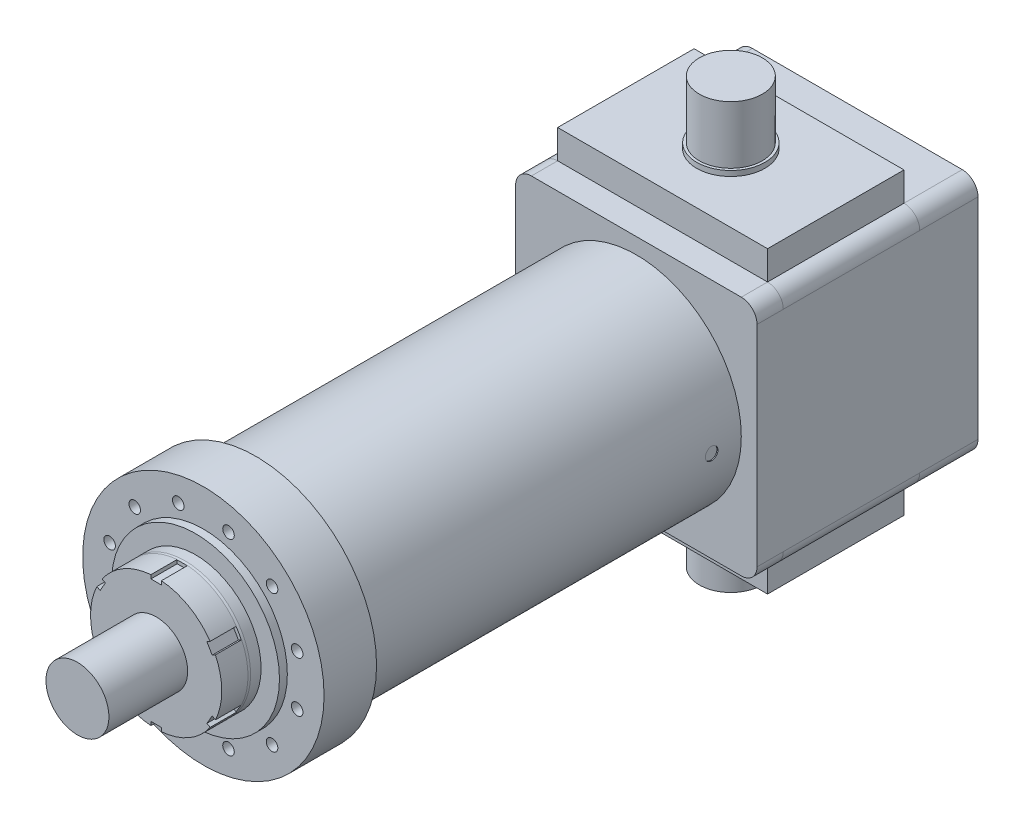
ISO-10303-21;
HEADER;
FILE_DESCRIPTION(('STEP AP214'),'2;1');
FILE_NAME('part.step','',(''),(''),'','','');
FILE_SCHEMA(('AUTOMOTIVE_DESIGN { 1 0 10303 214 1 1 1 1 }'));
ENDSEC;
DATA;
#1=APPLICATION_CONTEXT('core data for automotive mechanical design processes');
#2=APPLICATION_PROTOCOL_DEFINITION('international standard','automotive_design',2000,#1);
#3=PRODUCT_CONTEXT('',#1,'mechanical');
#4=PRODUCT('Part','Part','',(#3));
#5=PRODUCT_RELATED_PRODUCT_CATEGORY('part','',(#4));
#6=PRODUCT_DEFINITION_FORMATION('','',#4);
#7=PRODUCT_DEFINITION_CONTEXT('part definition',#1,'design');
#8=PRODUCT_DEFINITION('design','',#6,#7);
#9=PRODUCT_DEFINITION_SHAPE('','',#8);
#10=(LENGTH_UNIT() NAMED_UNIT(*) SI_UNIT(.MILLI.,.METRE.));
#11=(NAMED_UNIT(*) PLANE_ANGLE_UNIT() SI_UNIT($,.RADIAN.));
#12=(NAMED_UNIT(*) SI_UNIT($,.STERADIAN.) SOLID_ANGLE_UNIT());
#13=UNCERTAINTY_MEASURE_WITH_UNIT(LENGTH_MEASURE(1.E-05),#10,'distance_accuracy_value','');
#14=(GEOMETRIC_REPRESENTATION_CONTEXT(3) GLOBAL_UNCERTAINTY_ASSIGNED_CONTEXT((#13)) GLOBAL_UNIT_ASSIGNED_CONTEXT((#10,
#11,#12)) REPRESENTATION_CONTEXT('',''));
#15=CARTESIAN_POINT('',(0.,0.,0.));
#16=DIRECTION('',(0.,0.,1.));
#17=DIRECTION('',(1.,0.,0.));
#18=AXIS2_PLACEMENT_3D('',#15,#16,#17);
#19=CARTESIAN_POINT('',(0.,-285.,0.));
#20=DIRECTION('',(0.,1.,0.));
#21=DIRECTION('',(0.,0.,1.));
#22=AXIS2_PLACEMENT_3D('',#19,#20,#21);
#23=PLANE('',#22);
#24=DIRECTION('',(0.,0.,-1.));
#25=VECTOR('',#24,1.);
#26=CARTESIAN_POINT('',(-200.,-285.,-310.));
#27=LINE('',#26,#25);
#28=CARTESIAN_POINT('',(-200.,-285.,-50.));
#29=VERTEX_POINT('',#28);
#30=CARTESIAN_POINT('',(-200.,-285.,-310.));
#31=VERTEX_POINT('',#30);
#32=EDGE_CURVE('E412',#29,#31,#27,.T.);
#33=ORIENTED_EDGE('',*,*,#32,.T.);
#34=DIRECTION('',(1.,0.,0.));
#35=VECTOR('',#34,1.);
#36=CARTESIAN_POINT('',(-200.,-285.,-310.));
#37=LINE('',#36,#35);
#38=CARTESIAN_POINT('',(200.,-285.,-310.));
#39=VERTEX_POINT('',#38);
#40=EDGE_CURVE('E416',#31,#39,#37,.T.);
#41=ORIENTED_EDGE('',*,*,#40,.T.);
#42=DIRECTION('',(0.,0.,1.));
#43=VECTOR('',#42,1.);
#44=CARTESIAN_POINT('',(200.,-285.,-310.));
#45=LINE('',#44,#43);
#46=CARTESIAN_POINT('',(200.,-285.,-50.));
#47=VERTEX_POINT('',#46);
#48=EDGE_CURVE('E420',#39,#47,#45,.T.);
#49=ORIENTED_EDGE('',*,*,#48,.T.);
#50=DIRECTION('',(-1.,0.,0.));
#51=VECTOR('',#50,1.);
#52=CARTESIAN_POINT('',(-200.,-285.,-50.));
#53=LINE('',#52,#51);
#54=EDGE_CURVE('E423',#47,#29,#53,.T.);
#55=ORIENTED_EDGE('',*,*,#54,.T.);
#56=EDGE_LOOP('',(#33,#41,#49,#55));
#57=FACE_BOUND('',#56,.T.);
#58=CARTESIAN_POINT('',(0.,-285.,-180.));
#59=DIRECTION('',(0.,1.,0.));
#60=DIRECTION('',(0.,0.,1.));
#61=AXIS2_PLACEMENT_3D('',#58,#59,#60);
#62=CIRCLE('',#61,65.);
#63=CARTESIAN_POINT('',(0.,-285.,-115.));
#64=VERTEX_POINT('',#63);
#65=EDGE_CURVE('E48',#64,#64,#62,.F.);
#66=ORIENTED_EDGE('',*,*,#65,.F.);
#67=EDGE_LOOP('',(#66));
#68=FACE_BOUND('',#67,.T.);
#69=ADVANCED_FACE('F39',(#57,#68),#23,.F.);
#70=CARTESIAN_POINT('',(230.,230.,-50.));
#71=DIRECTION('',(0.,-1.,0.));
#72=DIRECTION('',(0.,0.,-1.));
#73=AXIS2_PLACEMENT_3D('',#70,#71,#72);
#74=PLANE('',#73);
#75=DIRECTION('',(1.,0.,0.));
#76=VECTOR('',#75,1.);
#77=CARTESIAN_POINT('',(230.,230.,0.));
#78=LINE('',#77,#76);
#79=CARTESIAN_POINT('',(-200.,230.,0.));
#80=VERTEX_POINT('',#79);
#81=CARTESIAN_POINT('',(200.,230.,0.));
#82=VERTEX_POINT('',#81);
#83=EDGE_CURVE('E816',#80,#82,#78,.T.);
#84=ORIENTED_EDGE('',*,*,#83,.T.);
#85=DIRECTION('',(0.,0.,1.));
#86=VECTOR('',#85,1.);
#87=CARTESIAN_POINT('',(200.,230.,-50.));
#88=LINE('',#87,#86);
#89=CARTESIAN_POINT('',(200.,230.,-50.));
#90=VERTEX_POINT('',#89);
#91=EDGE_CURVE('E1306',#82,#90,#88,.F.);
#92=ORIENTED_EDGE('',*,*,#91,.T.);
#93=DIRECTION('',(-1.,0.,0.));
#94=VECTOR('',#93,1.);
#95=CARTESIAN_POINT('',(-200.,230.,-50.));
#96=LINE('',#95,#94);
#97=CARTESIAN_POINT('',(-200.,230.,-50.));
#98=VERTEX_POINT('',#97);
#99=EDGE_CURVE('E388',#90,#98,#96,.T.);
#100=ORIENTED_EDGE('',*,*,#99,.T.);
#101=DIRECTION('',(0.,0.,1.));
#102=VECTOR('',#101,1.);
#103=CARTESIAN_POINT('',(-200.,230.,-50.));
#104=LINE('',#103,#102);
#105=EDGE_CURVE('E1302',#98,#80,#104,.T.);
#106=ORIENTED_EDGE('',*,*,#105,.T.);
#107=EDGE_LOOP('',(#84,#92,#100,#106));
#108=FACE_BOUND('',#107,.T.);
#109=ADVANCED_FACE('F997',(#108),#74,.F.);
#110=CARTESIAN_POINT('',(230.,-230.,-50.));
#111=DIRECTION('',(0.,1.,0.));
#112=DIRECTION('',(0.,0.,1.));
#113=AXIS2_PLACEMENT_3D('',#110,#111,#112);
#114=PLANE('',#113);
#115=DIRECTION('',(-1.,0.,0.));
#116=VECTOR('',#115,1.);
#117=CARTESIAN_POINT('',(230.,-230.,-421.));
#118=LINE('',#117,#116);
#119=CARTESIAN_POINT('',(200.,-230.,-421.));
#120=VERTEX_POINT('',#119);
#121=CARTESIAN_POINT('',(-200.,-230.,-421.));
#122=VERTEX_POINT('',#121);
#123=EDGE_CURVE('E459',#120,#122,#118,.T.);
#124=ORIENTED_EDGE('',*,*,#123,.F.);
#125=DIRECTION('',(0.,0.,1.));
#126=VECTOR('',#125,1.);
#127=CARTESIAN_POINT('',(200.,-230.,-50.));
#128=LINE('',#127,#126);
#129=CARTESIAN_POINT('',(200.,-230.,-310.));
#130=VERTEX_POINT('',#129);
#131=EDGE_CURVE('E1350',#120,#130,#128,.T.);
#132=ORIENTED_EDGE('',*,*,#131,.T.);
#133=DIRECTION('',(1.,0.,0.));
#134=VECTOR('',#133,1.);
#135=CARTESIAN_POINT('',(-200.,-230.,-310.));
#136=LINE('',#135,#134);
#137=CARTESIAN_POINT('',(-200.,-230.,-310.));
#138=VERTEX_POINT('',#137);
#139=EDGE_CURVE('E405',#138,#130,#136,.T.);
#140=ORIENTED_EDGE('',*,*,#139,.F.);
#141=DIRECTION('',(0.,0.,1.));
#142=VECTOR('',#141,1.);
#143=CARTESIAN_POINT('',(-200.,-230.,-50.));
#144=LINE('',#143,#142);
#145=EDGE_CURVE('E55',#138,#122,#144,.F.);
#146=ORIENTED_EDGE('',*,*,#145,.T.);
#147=EDGE_LOOP('',(#124,#132,#140,#146));
#148=FACE_BOUND('',#147,.T.);
#149=ADVANCED_FACE('F993',(#148),#114,.F.);
#150=DIRECTION('',(-1.,0.,0.));
#151=VECTOR('',#150,1.);
#152=CARTESIAN_POINT('',(-200.,-230.,-50.));
#153=LINE('',#152,#151);
#154=CARTESIAN_POINT('',(200.,-230.,-50.));
#155=VERTEX_POINT('',#154);
#156=CARTESIAN_POINT('',(-200.,-230.,-50.));
#157=VERTEX_POINT('',#156);
#158=EDGE_CURVE('E417',#155,#157,#153,.T.);
#159=ORIENTED_EDGE('',*,*,#158,.F.);
#160=DIRECTION('',(0.,0.,1.));
#161=VECTOR('',#160,1.);
#162=CARTESIAN_POINT('',(200.,-230.,-50.));
#163=LINE('',#162,#161);
#164=CARTESIAN_POINT('',(200.,-230.,0.));
#165=VERTEX_POINT('',#164);
#166=EDGE_CURVE('E1344',#155,#165,#163,.T.);
#167=ORIENTED_EDGE('',*,*,#166,.T.);
#168=DIRECTION('',(-1.,0.,0.));
#169=VECTOR('',#168,1.);
#170=CARTESIAN_POINT('',(230.,-230.,0.));
#171=LINE('',#170,#169);
#172=CARTESIAN_POINT('',(-200.,-230.,0.));
#173=VERTEX_POINT('',#172);
#174=EDGE_CURVE('E824',#165,#173,#171,.T.);
#175=ORIENTED_EDGE('',*,*,#174,.T.);
#176=DIRECTION('',(0.,0.,1.));
#177=VECTOR('',#176,1.);
#178=CARTESIAN_POINT('',(-200.,-230.,-50.));
#179=LINE('',#178,#177);
#180=EDGE_CURVE('E1341',#173,#157,#179,.F.);
#181=ORIENTED_EDGE('',*,*,#180,.T.);
#182=EDGE_LOOP('',(#159,#167,#175,#181));
#183=FACE_BOUND('',#182,.T.);
#184=ADVANCED_FACE('F996',(#183),#114,.F.);
#185=CARTESIAN_POINT('',(0.,0.,865.));
#186=DIRECTION('',(0.,0.,1.));
#187=DIRECTION('',(1.,0.,0.));
#188=AXIS2_PLACEMENT_3D('',#185,#186,#187);
#189=PLANE('',#188);
#190=DIRECTION('',(0.866025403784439,-0.5,0.));
#191=VECTOR('',#190,1.);
#192=CARTESIAN_POINT('',(112.906209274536,-53.6394249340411,865.));
#193=LINE('',#192,#191);
#194=CARTESIAN_POINT('',(106.757984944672,-50.0897459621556,865.));
#195=VERTEX_POINT('',#194);
#196=CARTESIAN_POINT('',(112.140218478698,-53.1971799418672,865.));
#197=VERTEX_POINT('',#196);
#198=EDGE_CURVE('E535',#195,#197,#193,.T.);
#199=ORIENTED_EDGE('',*,*,#198,.F.);
#200=DIRECTION('',(0.5,0.866025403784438,0.));
#201=VECTOR('',#200,1.);
#202=CARTESIAN_POINT('',(106.757984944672,-50.0897459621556,865.));
#203=LINE('',#202,#201);
#204=CARTESIAN_POINT('',(96.7579849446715,-67.4102540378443,865.));
#205=VERTEX_POINT('',#204);
#206=EDGE_CURVE('E697',#205,#195,#203,.T.);
#207=ORIENTED_EDGE('',*,*,#206,.F.);
#208=DIRECTION('',(-0.866025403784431,0.500000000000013,0.));
#209=VECTOR('',#208,1.);
#210=CARTESIAN_POINT('',(96.7579849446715,-67.4102540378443,865.));
#211=LINE('',#210,#209);
#212=CARTESIAN_POINT('',(102.140218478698,-70.5176880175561,865.));
#213=VERTEX_POINT('',#212);
#214=EDGE_CURVE('E529',#213,#205,#211,.T.);
#215=ORIENTED_EDGE('',*,*,#214,.F.);
#216=CARTESIAN_POINT('',(0.,0.,865.));
#217=DIRECTION('',(0.,0.,1.));
#218=DIRECTION('',(1.,0.,0.));
#219=AXIS2_PLACEMENT_3D('',#216,#217,#218);
#220=CIRCLE('',#219,124.118365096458);
#221=EDGE_CURVE('E2066',#213,#197,#220,.T.);
#222=ORIENTED_EDGE('',*,*,#221,.T.);
#223=EDGE_LOOP('',(#199,#207,#215,#222));
#224=FACE_BOUND('',#223,.T.);
#225=ADVANCED_FACE('F1015',(#224),#189,.T.);
#226=DIRECTION('',(0.,-1.,0.));
#227=VECTOR('',#226,1.);
#228=CARTESIAN_POINT('',(10.,-124.599357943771,865.));
#229=LINE('',#228,#227);
#230=CARTESIAN_POINT('',(10.,-117.5,865.));
#231=VERTEX_POINT('',#230);
#232=CARTESIAN_POINT('',(10.,-123.714867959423,865.));
#233=VERTEX_POINT('',#232);
#234=EDGE_CURVE('E686',#231,#233,#229,.T.);
#235=ORIENTED_EDGE('',*,*,#234,.F.);
#236=DIRECTION('',(1.,0.,0.));
#237=VECTOR('',#236,1.);
#238=CARTESIAN_POINT('',(10.,-117.5,865.));
#239=LINE('',#238,#237);
#240=CARTESIAN_POINT('',(-9.99999999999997,-117.5,865.));
#241=VERTEX_POINT('',#240);
#242=EDGE_CURVE('E680',#241,#231,#239,.T.);
#243=ORIENTED_EDGE('',*,*,#242,.F.);
#244=DIRECTION('',(0.,1.,0.));
#245=VECTOR('',#244,1.);
#246=CARTESIAN_POINT('',(-9.99999999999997,-117.5,865.));
#247=LINE('',#246,#245);
#248=CARTESIAN_POINT('',(-10.0000000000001,-123.714867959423,865.));
#249=VERTEX_POINT('',#248);
#250=EDGE_CURVE('E681',#249,#241,#247,.T.);
#251=ORIENTED_EDGE('',*,*,#250,.F.);
#252=EDGE_CURVE('E2060',#249,#233,#220,.T.);
#253=ORIENTED_EDGE('',*,*,#252,.T.);
#254=EDGE_LOOP('',(#235,#243,#251,#253));
#255=FACE_BOUND('',#254,.T.);
#256=ADVANCED_FACE('F1970',(#255),#189,.T.);
#257=DIRECTION('',(-0.866025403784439,-0.5,0.));
#258=VECTOR('',#257,1.);
#259=CARTESIAN_POINT('',(-102.906209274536,-70.95993300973,865.));
#260=LINE('',#259,#258);
#261=CARTESIAN_POINT('',(-96.7579849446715,-67.4102540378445,865.));
#262=VERTEX_POINT('',#261);
#263=CARTESIAN_POINT('',(-102.140218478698,-70.5176880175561,865.));
#264=VERTEX_POINT('',#263);
#265=EDGE_CURVE('E669',#262,#264,#260,.T.);
#266=ORIENTED_EDGE('',*,*,#265,.F.);
#267=DIRECTION('',(0.5,-0.866025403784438,0.));
#268=VECTOR('',#267,1.);
#269=CARTESIAN_POINT('',(-96.7579849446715,-67.4102540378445,865.));
#270=LINE('',#269,#268);
#271=CARTESIAN_POINT('',(-106.757984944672,-50.0897459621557,865.));
#272=VERTEX_POINT('',#271);
#273=EDGE_CURVE('E663',#272,#262,#270,.T.);
#274=ORIENTED_EDGE('',*,*,#273,.F.);
#275=DIRECTION('',(0.866025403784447,0.499999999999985,0.));
#276=VECTOR('',#275,1.);
#277=CARTESIAN_POINT('',(-106.757984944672,-50.0897459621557,865.));
#278=LINE('',#277,#276);
#279=CARTESIAN_POINT('',(-112.140218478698,-53.1971799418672,865.));
#280=VERTEX_POINT('',#279);
#281=EDGE_CURVE('E664',#280,#272,#278,.T.);
#282=ORIENTED_EDGE('',*,*,#281,.F.);
#283=EDGE_CURVE('E2054',#280,#264,#220,.T.);
#284=ORIENTED_EDGE('',*,*,#283,.T.);
#285=EDGE_LOOP('',(#266,#274,#282,#284));
#286=FACE_BOUND('',#285,.T.);
#287=ADVANCED_FACE('F1963',(#286),#189,.T.);
#288=DIRECTION('',(-0.86602540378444,0.499999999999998,0.));
#289=VECTOR('',#288,1.);
#290=CARTESIAN_POINT('',(-112.906209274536,53.6394249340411,865.));
#291=LINE('',#290,#289);
#292=CARTESIAN_POINT('',(-106.757984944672,50.0897459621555,865.));
#293=VERTEX_POINT('',#292);
#294=CARTESIAN_POINT('',(-112.140218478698,53.1971799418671,865.));
#295=VERTEX_POINT('',#294);
#296=EDGE_CURVE('E652',#293,#295,#291,.T.);
#297=ORIENTED_EDGE('',*,*,#296,.F.);
#298=DIRECTION('',(-0.500000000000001,-0.866025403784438,0.));
#299=VECTOR('',#298,1.);
#300=CARTESIAN_POINT('',(-106.757984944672,50.0897459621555,865.));
#301=LINE('',#300,#299);
#302=CARTESIAN_POINT('',(-96.7579849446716,67.4102540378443,865.));
#303=VERTEX_POINT('',#302);
#304=EDGE_CURVE('E646',#303,#293,#301,.T.);
#305=ORIENTED_EDGE('',*,*,#304,.F.);
#306=DIRECTION('',(0.866025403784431,-0.500000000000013,0.));
#307=VECTOR('',#306,1.);
#308=CARTESIAN_POINT('',(-96.7579849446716,67.4102540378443,865.));
#309=LINE('',#308,#307);
#310=CARTESIAN_POINT('',(-102.140218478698,70.517688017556,865.));
#311=VERTEX_POINT('',#310);
#312=EDGE_CURVE('E647',#311,#303,#309,.T.);
#313=ORIENTED_EDGE('',*,*,#312,.F.);
#314=EDGE_CURVE('E2048',#311,#295,#220,.T.);
#315=ORIENTED_EDGE('',*,*,#314,.T.);
#316=EDGE_LOOP('',(#297,#305,#313,#315));
#317=FACE_BOUND('',#316,.T.);
#318=ADVANCED_FACE('F1956',(#317),#189,.T.);
#319=DIRECTION('',(0.,1.,0.));
#320=VECTOR('',#319,1.);
#321=CARTESIAN_POINT('',(-10.,124.599357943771,865.));
#322=LINE('',#321,#320);
#323=CARTESIAN_POINT('',(-10.,117.5,865.));
#324=VERTEX_POINT('',#323);
#325=CARTESIAN_POINT('',(-10.,123.714867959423,865.));
#326=VERTEX_POINT('',#325);
#327=EDGE_CURVE('E635',#324,#326,#322,.T.);
#328=ORIENTED_EDGE('',*,*,#327,.F.);
#329=DIRECTION('',(-1.,0.,0.));
#330=VECTOR('',#329,1.);
#331=CARTESIAN_POINT('',(-10.,117.5,865.));
#332=LINE('',#331,#330);
#333=CARTESIAN_POINT('',(9.99999999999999,117.5,865.));
#334=VERTEX_POINT('',#333);
#335=EDGE_CURVE('E629',#334,#324,#332,.T.);
#336=ORIENTED_EDGE('',*,*,#335,.F.);
#337=DIRECTION('',(0.,-1.,0.));
#338=VECTOR('',#337,1.);
#339=CARTESIAN_POINT('',(9.99999999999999,117.5,865.));
#340=LINE('',#339,#338);
#341=CARTESIAN_POINT('',(9.99999999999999,123.714867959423,865.));
#342=VERTEX_POINT('',#341);
#343=EDGE_CURVE('E630',#342,#334,#340,.T.);
#344=ORIENTED_EDGE('',*,*,#343,.F.);
#345=EDGE_CURVE('E2042',#342,#326,#220,.T.);
#346=ORIENTED_EDGE('',*,*,#345,.T.);
#347=EDGE_LOOP('',(#328,#336,#344,#346));
#348=FACE_BOUND('',#347,.T.);
#349=ADVANCED_FACE('F1016',(#348),#189,.T.);
#350=CARTESIAN_POINT('',(0.,0.,725.));
#351=DIRECTION('',(0.,0.,-1.));
#352=DIRECTION('',(-1.,0.,0.));
#353=AXIS2_PLACEMENT_3D('',#350,#351,#352);
#354=CYLINDRICAL_SURFACE('',#353,200.);
#355=CARTESIAN_POINT('',(200.,0.,44.5));
#356=CARTESIAN_POINT('',(200.000000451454,-0.336818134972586,44.4999972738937));
#357=CARTESIAN_POINT('',(199.999147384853,-0.673592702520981,44.5141864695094));
#358=CARTESIAN_POINT('',(199.995759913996,-1.34485594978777,44.5708419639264));
#359=CARTESIAN_POINT('',(199.993225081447,-1.67934402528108,44.6133154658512));
#360=CARTESIAN_POINT('',(199.986541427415,-2.34388649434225,44.7263038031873));
#361=CARTESIAN_POINT('',(199.982390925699,-2.67393590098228,44.7968478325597));
#362=CARTESIAN_POINT('',(199.97259396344,-3.32690256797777,44.9654685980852));
#363=CARTESIAN_POINT('',(199.966947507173,-3.64981984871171,45.063545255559));
#364=CARTESIAN_POINT('',(199.95432206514,-4.28605714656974,45.2864689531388));
#365=CARTESIAN_POINT('',(199.947343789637,-4.59938217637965,45.411301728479));
#366=CARTESIAN_POINT('',(199.932250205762,-5.21439925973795,45.6868788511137));
#367=CARTESIAN_POINT('',(199.92413488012,-5.51609113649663,45.837623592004));
#368=CARTESIAN_POINT('',(199.906998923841,-6.10563167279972,46.1639107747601));
#369=CARTESIAN_POINT('',(199.897978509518,-6.39348361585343,46.3394472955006));
#370=CARTESIAN_POINT('',(199.879285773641,-6.95338726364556,46.7140984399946));
#371=CARTESIAN_POINT('',(199.869613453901,-7.22543901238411,46.9132129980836));
#372=CARTESIAN_POINT('',(199.84987810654,-7.75214646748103,47.3338690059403));
#373=CARTESIAN_POINT('',(199.839814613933,-8.00678041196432,47.555437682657));
#374=CARTESIAN_POINT('',(199.819593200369,-8.49648428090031,48.0192286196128));
#375=CARTESIAN_POINT('',(199.809435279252,-8.73155417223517,48.2614509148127));
#376=CARTESIAN_POINT('',(199.789312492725,-9.18047473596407,48.7648450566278));
#377=CARTESIAN_POINT('',(199.779347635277,-9.39432453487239,49.0260176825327));
#378=CARTESIAN_POINT('',(199.759894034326,-9.79927768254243,49.5654558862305));
#379=CARTESIAN_POINT('',(199.750405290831,-9.99038103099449,49.8437214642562));
#380=CARTESIAN_POINT('',(199.732166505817,-10.3486167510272,50.4155890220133));
#381=CARTESIAN_POINT('',(199.723417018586,-10.5157312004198,50.7092022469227));
#382=CARTESIAN_POINT('',(199.706913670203,-10.8246278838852,51.3094920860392));
#383=CARTESIAN_POINT('',(199.699159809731,-10.9664101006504,51.6161687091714));
#384=CARTESIAN_POINT('',(199.684868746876,-11.2236267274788,52.2404038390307));
#385=CARTESIAN_POINT('',(199.678331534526,-11.3390613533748,52.5579622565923));
#386=CARTESIAN_POINT('',(199.666660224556,-11.5427558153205,53.2017032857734));
#387=CARTESIAN_POINT('',(199.661526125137,-11.631015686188,53.5278858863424));
#388=CARTESIAN_POINT('',(199.652812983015,-11.7796353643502,54.1861499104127));
#389=CARTESIAN_POINT('',(199.649232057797,-11.8400289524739,54.5182236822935));
#390=CARTESIAN_POINT('',(199.643718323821,-11.9326397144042,55.1862908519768));
#391=CARTESIAN_POINT('',(199.641785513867,-11.9648569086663,55.5222842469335));
#392=CARTESIAN_POINT('',(199.639623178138,-12.0008826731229,56.1957928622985));
#393=CARTESIAN_POINT('',(199.639393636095,-12.0046915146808,56.5333080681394));
#394=CARTESIAN_POINT('',(199.640644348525,-11.9838738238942,57.207457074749));
#395=CARTESIAN_POINT('',(199.642124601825,-11.9592473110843,57.5440908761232));
#396=CARTESIAN_POINT('',(199.646749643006,-11.881786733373,58.2136429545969));
#397=CARTESIAN_POINT('',(199.649892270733,-11.8289892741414,58.5465654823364));
#398=CARTESIAN_POINT('',(199.657751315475,-11.6955888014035,59.2067729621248));
#399=CARTESIAN_POINT('',(199.662467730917,-11.6149858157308,59.5340579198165));
#400=CARTESIAN_POINT('',(199.673340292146,-11.4265512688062,60.1806698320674));
#401=CARTESIAN_POINT('',(199.679496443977,-11.3187195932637,60.4999967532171));
#402=CARTESIAN_POINT('',(199.693073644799,-11.0765982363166,61.1284294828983));
#403=CARTESIAN_POINT('',(199.700494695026,-10.9423085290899,61.4375352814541));
#404=CARTESIAN_POINT('',(199.716396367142,-10.6481322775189,62.0435365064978));
#405=CARTESIAN_POINT('',(199.724877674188,-10.4882291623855,62.340423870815));
#406=CARTESIAN_POINT('',(199.742655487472,-10.1440259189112,62.9196760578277));
#407=CARTESIAN_POINT('',(199.75195199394,-9.95972578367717,63.2020408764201));
#408=CARTESIAN_POINT('',(199.771096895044,-9.5680341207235,63.7502561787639));
#409=CARTESIAN_POINT('',(199.780945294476,-9.36064239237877,64.0161065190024));
#410=CARTESIAN_POINT('',(199.800915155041,-8.92423659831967,64.529413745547));
#411=CARTESIAN_POINT('',(199.811036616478,-8.69522250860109,64.7768706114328));
#412=CARTESIAN_POINT('',(199.831282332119,-8.2168118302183,65.2520193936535));
#413=CARTESIAN_POINT('',(199.841406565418,-7.96738357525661,65.4796794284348));
#414=CARTESIAN_POINT('',(199.861354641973,-7.45022594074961,65.9131810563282));
#415=CARTESIAN_POINT('',(199.871178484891,-7.18249654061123,66.1190226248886));
#416=CARTESIAN_POINT('',(199.890247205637,-6.63063236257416,66.5074255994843));
#417=CARTESIAN_POINT('',(199.899492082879,-6.34649756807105,66.6899869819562));
#418=CARTESIAN_POINT('',(199.917140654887,-5.76383629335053,67.0305297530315));
#419=CARTESIAN_POINT('',(199.92554435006,-5.46530982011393,67.1885111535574));
#420=CARTESIAN_POINT('',(199.94127250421,-4.85596814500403,67.4787734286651));
#421=CARTESIAN_POINT('',(199.94859691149,-4.54515235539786,67.6110530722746));
#422=CARTESIAN_POINT('',(199.961958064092,-3.91345386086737,67.8489554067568));
#423=CARTESIAN_POINT('',(199.967994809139,-3.5925711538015,67.9545780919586));
#424=CARTESIAN_POINT('',(199.978609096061,-2.94302558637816,68.138407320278));
#425=CARTESIAN_POINT('',(199.983186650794,-2.61436279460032,68.2166141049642));
#426=CARTESIAN_POINT('',(199.990752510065,-1.95159736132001,68.3450498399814));
#427=CARTESIAN_POINT('',(199.993740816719,-1.61749472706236,68.3952788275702));
#428=CARTESIAN_POINT('',(199.998039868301,-0.946756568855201,68.467340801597));
#429=CARTESIAN_POINT('',(199.999353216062,-0.610125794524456,68.489217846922));
#430=CARTESIAN_POINT('',(200.000273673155,0.0637847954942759,68.5045628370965));
#431=CARTESIAN_POINT('',(199.999880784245,0.40106461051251,68.4980308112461));
#432=CARTESIAN_POINT('',(199.997399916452,1.07386998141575,68.4566048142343));
#433=CARTESIAN_POINT('',(199.995311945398,1.4093955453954,68.4217109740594));
#434=CARTESIAN_POINT('',(199.98950012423,2.07630576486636,68.3238125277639));
#435=CARTESIAN_POINT('',(199.985776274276,2.4076904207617,68.2608079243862));
#436=CARTESIAN_POINT('',(199.976801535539,3.06372180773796,68.1071968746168));
#437=CARTESIAN_POINT('',(199.971551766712,3.38837329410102,68.0166106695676));
#438=CARTESIAN_POINT('',(199.959672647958,4.02888618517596,67.8084689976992));
#439=CARTESIAN_POINT('',(199.953043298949,4.34474759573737,67.6909135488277));
#440=CARTESIAN_POINT('',(199.938592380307,4.96544648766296,67.4296715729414));
#441=CARTESIAN_POINT('',(199.930770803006,5.27028389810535,67.2859848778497));
#442=CARTESIAN_POINT('',(199.914156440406,5.86677844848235,66.973503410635));
#443=CARTESIAN_POINT('',(199.905363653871,6.15843557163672,66.8047086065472));
#444=CARTESIAN_POINT('',(199.887043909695,6.72686049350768,66.4429862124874));
#445=CARTESIAN_POINT('',(199.877516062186,7.00360953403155,66.2500291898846));
#446=CARTESIAN_POINT('',(199.85800533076,7.53987480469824,65.8415150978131));
#447=CARTESIAN_POINT('',(199.84802244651,7.79939102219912,65.6259580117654));
#448=CARTESIAN_POINT('',(199.827884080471,8.29935868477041,65.1737683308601));
#449=CARTESIAN_POINT('',(199.817728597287,8.53980997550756,64.9371355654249));
#450=CARTESIAN_POINT('',(199.797532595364,8.99994549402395,64.4444693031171));
#451=CARTESIAN_POINT('',(199.787492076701,9.21962970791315,64.1884357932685));
#452=CARTESIAN_POINT('',(199.767797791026,9.63694312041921,63.6584379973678));
#453=CARTESIAN_POINT('',(199.758144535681,9.83454371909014,63.3844511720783));
#454=CARTESIAN_POINT('',(199.739512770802,10.205960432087,62.8207823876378));
#455=CARTESIAN_POINT('',(199.730534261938,10.3797765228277,62.5311004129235));
#456=CARTESIAN_POINT('',(199.713507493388,10.7023843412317,61.9380971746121));
#457=CARTESIAN_POINT('',(199.70545922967,10.8511761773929,61.6347759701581));
#458=CARTESIAN_POINT('',(199.690522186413,11.1226725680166,61.0166473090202));
#459=CARTESIAN_POINT('',(199.683633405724,11.245377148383,60.7018398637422));
#460=CARTESIAN_POINT('',(199.671215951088,11.463746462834,60.0631910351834));
#461=CARTESIAN_POINT('',(199.665686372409,11.5594291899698,59.7393558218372));
#462=CARTESIAN_POINT('',(199.656139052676,11.7231767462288,59.0847544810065));
#463=CARTESIAN_POINT('',(199.652121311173,11.7912415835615,58.7539883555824));
#464=CARTESIAN_POINT('',(199.645712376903,11.8992631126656,58.0878845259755));
#465=CARTESIAN_POINT('',(199.643321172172,11.9392200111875,57.7525468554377));
#466=CARTESIAN_POINT('',(199.640233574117,11.99073839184,57.079689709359));
#467=CARTESIAN_POINT('',(199.639537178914,12.0022999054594,56.7421702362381));
#468=CARTESIAN_POINT('',(199.639858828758,11.9969484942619,56.0678915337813));
#469=CARTESIAN_POINT('',(199.640874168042,11.9800805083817,55.731131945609));
#470=CARTESIAN_POINT('',(199.644585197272,11.9180771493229,55.0602348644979));
#471=CARTESIAN_POINT('',(199.647280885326,11.8729418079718,54.7260973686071));
#472=CARTESIAN_POINT('',(199.654275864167,11.754727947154,54.0628194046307));
#473=CARTESIAN_POINT('',(199.658575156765,11.6816493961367,53.7336789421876));
#474=CARTESIAN_POINT('',(199.668655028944,11.5080731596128,53.0827324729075));
#475=CARTESIAN_POINT('',(199.674435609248,11.4075754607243,52.7609264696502));
#476=CARTESIAN_POINT('',(199.687313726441,11.1798805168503,52.1269324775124));
#477=CARTESIAN_POINT('',(199.694411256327,11.0526834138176,51.814744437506));
#478=CARTESIAN_POINT('',(199.709721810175,10.7724967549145,51.2021943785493));
#479=CARTESIAN_POINT('',(199.71793483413,10.6195071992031,50.901832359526));
#480=CARTESIAN_POINT('',(199.735243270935,10.2888285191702,50.3150654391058));
#481=CARTESIAN_POINT('',(199.744338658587,10.1111401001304,50.028660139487));
#482=CARTESIAN_POINT('',(199.763154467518,9.73232068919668,49.4718189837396));
#483=CARTESIAN_POINT('',(199.772874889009,9.53118968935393,49.201383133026));
#484=CARTESIAN_POINT('',(199.792680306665,9.10659722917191,48.678005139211));
#485=CARTESIAN_POINT('',(199.802765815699,8.88310351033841,48.4250891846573));
#486=CARTESIAN_POINT('',(199.823002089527,8.41561396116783,47.9389745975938));
#487=CARTESIAN_POINT('',(199.833152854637,8.17161803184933,47.7057760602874));
#488=CARTESIAN_POINT('',(199.853234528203,7.66478752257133,47.2606924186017));
#489=CARTESIAN_POINT('',(199.863165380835,7.40194822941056,47.0488126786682));
#490=CARTESIAN_POINT('',(199.882523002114,6.8593497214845,46.6479393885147));
#491=CARTESIAN_POINT('',(199.891949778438,6.57959076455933,46.4589454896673));
#492=CARTESIAN_POINT('',(199.910042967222,6.00478830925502,46.1049735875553));
#493=CARTESIAN_POINT('',(199.918708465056,5.7097270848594,45.9400243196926));
#494=CARTESIAN_POINT('',(199.935020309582,5.10672265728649,45.6355873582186));
#495=CARTESIAN_POINT('',(199.942666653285,4.79877941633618,45.4960997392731));
#496=CARTESIAN_POINT('',(199.95671533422,4.17252410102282,45.243718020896));
#497=CARTESIAN_POINT('',(199.96311897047,3.85422326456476,45.1307961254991));
#498=CARTESIAN_POINT('',(199.974509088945,3.20932132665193,44.9321958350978));
#499=CARTESIAN_POINT('',(199.979495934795,2.88272237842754,44.8465104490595));
#500=CARTESIAN_POINT('',(199.989051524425,2.13414018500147,44.6835216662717));
#501=CARTESIAN_POINT('',(199.99314188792,1.71026312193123,44.6147621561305));
#502=CARTESIAN_POINT('',(199.998615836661,0.857567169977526,44.5230030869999));
#503=CARTESIAN_POINT('',(199.999999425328,0.428748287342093,44.5000034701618));
#504=CARTESIAN_POINT('',(200.,0.,44.5));
#505=B_SPLINE_CURVE_WITH_KNOTS('',3,(#355,#356,#357,#358,#359,#360,#361,#362,#363,#364,#365,
#366,#367,#368,#369,#370,#371,#372,#373,#374,#375,#376,#377,#378,#379,#380,#381,#382,#383,#384,
#385,#386,#387,#388,#389,#390,#391,#392,#393,#394,#395,#396,#397,#398,#399,#400,#401,#402,#403,
#404,#405,#406,#407,#408,#409,#410,#411,#412,#413,#414,#415,#416,#417,#418,#419,#420,#421,#422,
#423,#424,#425,#426,#427,#428,#429,#430,#431,#432,#433,#434,#435,#436,#437,#438,#439,#440,#441,
#442,#443,#444,#445,#446,#447,#448,#449,#450,#451,#452,#453,#454,#455,#456,#457,#458,#459,#460,
#461,#462,#463,#464,#465,#466,#467,#468,#469,#470,#471,#472,#473,#474,#475,#476,#477,#478,#479,
#480,#481,#482,#483,#484,#485,#486,#487,#488,#489,#490,#491,#492,#493,#494,#495,#496,#497,#498,
#499,#500,#501,#502,#503,#504),.UNSPECIFIED.,.T.,.F.,(4,2,2,2,2,2,2,2,2,2,2,2,2,2,2,2,2,2,2,2,2,
2,2,2,2,2,2,2,2,2,2,2,2,2,2,2,2,2,2,2,2,2,2,2,2,2,2,2,2,2,2,2,2,2,2,2,2,2,2,2,2,2,2,2,2,2,2,2,2,
2,2,2,2,2,4),(0.,1.01007974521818,2.02041682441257,3.03180743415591,4.04319515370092,
5.0540449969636,6.06491019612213,7.07553437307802,8.08615573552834,9.09801754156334,
10.1098810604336,11.1217862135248,12.1336913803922,13.1463486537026,14.1590066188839,
15.171656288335,16.1843046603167,17.1957222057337,18.207139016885,19.2185461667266,
20.2299526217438,21.2400480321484,22.250142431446,23.2602410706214,24.2703406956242,
25.2810964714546,26.2918525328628,27.3026173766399,28.3133833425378,29.3257480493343,
30.3381138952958,31.350480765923,32.3628471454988,33.3752619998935,34.3876770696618,
35.4000832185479,36.4124880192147,37.4233176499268,38.4341462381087,39.444970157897,
40.4557939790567,41.4658777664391,42.4759608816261,43.4860504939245,44.4961413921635,
45.5074749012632,46.5188091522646,47.5301515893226,48.5414947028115,49.5541327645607,
50.566771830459,51.5794065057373,52.5920401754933,53.6039979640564,54.6159554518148,
55.6279054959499,56.6398544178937,57.650205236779,58.6605549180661,59.6709057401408,
60.6812570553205,61.6916029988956,62.7019489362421,63.7122660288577,64.7225834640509,
65.7343799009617,66.7461812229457,67.75823651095,68.7702763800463,69.7835159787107,
70.7967585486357,71.8089361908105,72.8208538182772,74.1066233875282,75.3923913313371),.UNSPECIFIED.);
#506=CARTESIAN_POINT('',(200.,0.,44.5));
#507=VERTEX_POINT('',#506);
#508=EDGE_CURVE('E1270',#507,#507,#505,.T.);
#509=ORIENTED_EDGE('',*,*,#508,.T.);
#510=EDGE_LOOP('',(#509));
#511=FACE_BOUND('',#510,.T.);
#512=CARTESIAN_POINT('',(0.,0.,725.));
#513=DIRECTION('',(0.,0.,1.));
#514=DIRECTION('',(1.,0.,0.));
#515=AXIS2_PLACEMENT_3D('',#512,#513,#514);
#516=CIRCLE('',#515,200.);
#517=CARTESIAN_POINT('',(200.,0.,725.));
#518=VERTEX_POINT('',#517);
#519=EDGE_CURVE('E843',#518,#518,#516,.T.);
#520=ORIENTED_EDGE('',*,*,#519,.F.);
#521=EDGE_LOOP('',(#520));
#522=FACE_BOUND('',#521,.T.);
#523=CARTESIAN_POINT('',(0.,0.,0.));
#524=DIRECTION('',(0.,0.,1.));
#525=DIRECTION('',(1.,0.,0.));
#526=AXIS2_PLACEMENT_3D('',#523,#524,#525);
#527=CIRCLE('',#526,200.);
#528=CARTESIAN_POINT('',(200.,0.,0.));
#529=VERTEX_POINT('',#528);
#530=EDGE_CURVE('E828',#529,#529,#527,.T.);
#531=ORIENTED_EDGE('',*,*,#530,.T.);
#532=EDGE_LOOP('',(#531));
#533=FACE_BOUND('',#532,.T.);
#534=CARTESIAN_POINT('',(-200.,0.,682.5));
#535=CARTESIAN_POINT('',(-200.000000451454,0.336818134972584,682.500002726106));
#536=CARTESIAN_POINT('',(-199.999147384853,0.673592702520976,682.485813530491));
#537=CARTESIAN_POINT('',(-199.995759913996,1.34485594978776,682.429158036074));
#538=CARTESIAN_POINT('',(-199.993225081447,1.67934402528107,682.386684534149));
#539=CARTESIAN_POINT('',(-199.986541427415,2.34388649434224,682.273696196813));
#540=CARTESIAN_POINT('',(-199.982390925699,2.67393590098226,682.20315216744));
#541=CARTESIAN_POINT('',(-199.97259396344,3.32690256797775,682.034531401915));
#542=CARTESIAN_POINT('',(-199.966947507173,3.64981984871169,681.936454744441));
#543=CARTESIAN_POINT('',(-199.95432206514,4.28605714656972,681.713531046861));
#544=CARTESIAN_POINT('',(-199.947343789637,4.59938217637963,681.588698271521));
#545=CARTESIAN_POINT('',(-199.932250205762,5.21439925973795,681.313121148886));
#546=CARTESIAN_POINT('',(-199.92413488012,5.51609113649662,681.162376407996));
#547=CARTESIAN_POINT('',(-199.906998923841,6.10563167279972,680.83608922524));
#548=CARTESIAN_POINT('',(-199.897978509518,6.39348361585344,680.660552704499));
#549=CARTESIAN_POINT('',(-199.879285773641,6.95338726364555,680.285901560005));
#550=CARTESIAN_POINT('',(-199.869613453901,7.22543901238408,680.086787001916));
#551=CARTESIAN_POINT('',(-199.84987810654,7.752146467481,679.66613099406));
#552=CARTESIAN_POINT('',(-199.839814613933,8.00678041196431,679.444562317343));
#553=CARTESIAN_POINT('',(-199.819593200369,8.49648428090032,678.980771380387));
#554=CARTESIAN_POINT('',(-199.809435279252,8.73155417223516,678.738549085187));
#555=CARTESIAN_POINT('',(-199.789312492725,9.18047473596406,678.235154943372));
#556=CARTESIAN_POINT('',(-199.779347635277,9.39432453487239,677.973982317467));
#557=CARTESIAN_POINT('',(-199.759894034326,9.79927768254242,677.434544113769));
#558=CARTESIAN_POINT('',(-199.750405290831,9.99038103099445,677.156278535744));
#559=CARTESIAN_POINT('',(-199.732166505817,10.3486167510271,676.584410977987));
#560=CARTESIAN_POINT('',(-199.723417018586,10.5157312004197,676.290797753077));
#561=CARTESIAN_POINT('',(-199.706913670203,10.8246278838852,675.690507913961));
#562=CARTESIAN_POINT('',(-199.699159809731,10.9664101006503,675.383831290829));
#563=CARTESIAN_POINT('',(-199.684868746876,11.2236267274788,674.759596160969));
#564=CARTESIAN_POINT('',(-199.678331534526,11.3390613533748,674.442037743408));
#565=CARTESIAN_POINT('',(-199.666660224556,11.5427558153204,673.798296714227));
#566=CARTESIAN_POINT('',(-199.661526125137,11.631015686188,673.472114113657));
#567=CARTESIAN_POINT('',(-199.652812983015,11.7796353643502,672.813850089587));
#568=CARTESIAN_POINT('',(-199.649232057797,11.8400289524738,672.481776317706));
#569=CARTESIAN_POINT('',(-199.643718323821,11.9326397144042,671.813709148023));
#570=CARTESIAN_POINT('',(-199.641785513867,11.9648569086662,671.477715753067));
#571=CARTESIAN_POINT('',(-199.639623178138,12.0008826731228,670.804207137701));
#572=CARTESIAN_POINT('',(-199.639393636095,12.0046915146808,670.466691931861));
#573=CARTESIAN_POINT('',(-199.640644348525,11.9838738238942,669.792542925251));
#574=CARTESIAN_POINT('',(-199.642124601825,11.9592473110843,669.455909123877));
#575=CARTESIAN_POINT('',(-199.646749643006,11.881786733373,668.786357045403));
#576=CARTESIAN_POINT('',(-199.649892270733,11.8289892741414,668.453434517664));
#577=CARTESIAN_POINT('',(-199.657751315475,11.6955888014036,667.793227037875));
#578=CARTESIAN_POINT('',(-199.662467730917,11.6149858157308,667.465942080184));
#579=CARTESIAN_POINT('',(-199.673340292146,11.4265512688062,666.819330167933));
#580=CARTESIAN_POINT('',(-199.679496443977,11.3187195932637,666.500003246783));
#581=CARTESIAN_POINT('',(-199.693073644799,11.0765982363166,665.871570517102));
#582=CARTESIAN_POINT('',(-199.700494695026,10.9423085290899,665.562464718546));
#583=CARTESIAN_POINT('',(-199.716396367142,10.6481322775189,664.956463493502));
#584=CARTESIAN_POINT('',(-199.724877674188,10.4882291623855,664.659576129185));
#585=CARTESIAN_POINT('',(-199.742655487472,10.1440259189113,664.080323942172));
#586=CARTESIAN_POINT('',(-199.75195199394,9.95972578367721,663.79795912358));
#587=CARTESIAN_POINT('',(-199.771096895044,9.56803412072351,663.249743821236));
#588=CARTESIAN_POINT('',(-199.780945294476,9.36064239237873,662.983893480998));
#589=CARTESIAN_POINT('',(-199.800915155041,8.9242365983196,662.470586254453));
#590=CARTESIAN_POINT('',(-199.811036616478,8.69522250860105,662.223129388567));
#591=CARTESIAN_POINT('',(-199.831282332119,8.21681183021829,661.747980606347));
#592=CARTESIAN_POINT('',(-199.841406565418,7.96738357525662,661.520320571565));
#593=CARTESIAN_POINT('',(-199.861354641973,7.45022594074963,661.086818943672));
#594=CARTESIAN_POINT('',(-199.871178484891,7.18249654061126,660.880977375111));
#595=CARTESIAN_POINT('',(-199.890247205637,6.6306323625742,660.492574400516));
#596=CARTESIAN_POINT('',(-199.899492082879,6.34649756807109,660.310013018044));
#597=CARTESIAN_POINT('',(-199.917140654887,5.76383629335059,659.969470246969));
#598=CARTESIAN_POINT('',(-199.92554435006,5.46530982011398,659.811488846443));
#599=CARTESIAN_POINT('',(-199.94127250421,4.85596814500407,659.521226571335));
#600=CARTESIAN_POINT('',(-199.94859691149,4.54515235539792,659.388946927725));
#601=CARTESIAN_POINT('',(-199.961958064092,3.91345386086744,659.151044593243));
#602=CARTESIAN_POINT('',(-199.967994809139,3.59257115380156,659.045421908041));
#603=CARTESIAN_POINT('',(-199.978609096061,2.9430255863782,658.861592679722));
#604=CARTESIAN_POINT('',(-199.983186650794,2.61436279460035,658.783385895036));
#605=CARTESIAN_POINT('',(-199.990752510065,1.95159736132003,658.654950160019));
#606=CARTESIAN_POINT('',(-199.993740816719,1.61749472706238,658.60472117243));
#607=CARTESIAN_POINT('',(-199.998039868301,0.946756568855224,658.532659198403));
#608=CARTESIAN_POINT('',(-199.999353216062,0.610125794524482,658.510782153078));
#609=CARTESIAN_POINT('',(-200.000273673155,-0.0637847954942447,658.495437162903));
#610=CARTESIAN_POINT('',(-199.999880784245,-0.401064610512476,658.501969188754));
#611=CARTESIAN_POINT('',(-199.997399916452,-1.07386998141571,658.543395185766));
#612=CARTESIAN_POINT('',(-199.995311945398,-1.40939554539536,658.578289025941));
#613=CARTESIAN_POINT('',(-199.98950012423,-2.07630576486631,658.676187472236));
#614=CARTESIAN_POINT('',(-199.985776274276,-2.40769042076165,658.739192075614));
#615=CARTESIAN_POINT('',(-199.976801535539,-3.06372180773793,658.892803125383));
#616=CARTESIAN_POINT('',(-199.971551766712,-3.38837329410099,658.983389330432));
#617=CARTESIAN_POINT('',(-199.959672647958,-4.02888618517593,659.191531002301));
#618=CARTESIAN_POINT('',(-199.953043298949,-4.34474759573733,659.309086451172));
#619=CARTESIAN_POINT('',(-199.938592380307,-4.96544648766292,659.570328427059));
#620=CARTESIAN_POINT('',(-199.930770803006,-5.27028389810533,659.71401512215));
#621=CARTESIAN_POINT('',(-199.914156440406,-5.86677844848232,660.026496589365));
#622=CARTESIAN_POINT('',(-199.905363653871,-6.15843557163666,660.195291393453));
#623=CARTESIAN_POINT('',(-199.887043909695,-6.7268604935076,660.557013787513));
#624=CARTESIAN_POINT('',(-199.877516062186,-7.00360953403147,660.749970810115));
#625=CARTESIAN_POINT('',(-199.85800533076,-7.53987480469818,661.158484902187));
#626=CARTESIAN_POINT('',(-199.84802244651,-7.79939102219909,661.374041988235));
#627=CARTESIAN_POINT('',(-199.827884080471,-8.29935868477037,661.82623166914));
#628=CARTESIAN_POINT('',(-199.817728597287,-8.53980997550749,662.062864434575));
#629=CARTESIAN_POINT('',(-199.797532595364,-8.9999454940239,662.555530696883));
#630=CARTESIAN_POINT('',(-199.787492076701,-9.21962970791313,662.811564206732));
#631=CARTESIAN_POINT('',(-199.767797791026,-9.63694312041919,663.341562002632));
#632=CARTESIAN_POINT('',(-199.758144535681,-9.8345437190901,663.615548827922));
#633=CARTESIAN_POINT('',(-199.739512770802,-10.205960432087,664.179217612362));
#634=CARTESIAN_POINT('',(-199.730534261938,-10.3797765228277,664.468899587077));
#635=CARTESIAN_POINT('',(-199.713507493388,-10.7023843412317,665.061902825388));
#636=CARTESIAN_POINT('',(-199.70545922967,-10.8511761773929,665.365224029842));
#637=CARTESIAN_POINT('',(-199.690522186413,-11.1226725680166,665.98335269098));
#638=CARTESIAN_POINT('',(-199.683633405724,-11.245377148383,666.298160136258));
#639=CARTESIAN_POINT('',(-199.671215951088,-11.4637464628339,666.936808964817));
#640=CARTESIAN_POINT('',(-199.665686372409,-11.5594291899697,667.260644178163));
#641=CARTESIAN_POINT('',(-199.656139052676,-11.7231767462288,667.915245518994));
#642=CARTESIAN_POINT('',(-199.652121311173,-11.7912415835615,668.246011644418));
#643=CARTESIAN_POINT('',(-199.645712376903,-11.8992631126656,668.912115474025));
#644=CARTESIAN_POINT('',(-199.643321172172,-11.9392200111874,669.247453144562));
#645=CARTESIAN_POINT('',(-199.640233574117,-11.99073839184,669.920310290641));
#646=CARTESIAN_POINT('',(-199.639537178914,-12.0022999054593,670.257829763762));
#647=CARTESIAN_POINT('',(-199.639858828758,-11.9969484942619,670.932108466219));
#648=CARTESIAN_POINT('',(-199.640874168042,-11.9800805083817,671.268868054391));
#649=CARTESIAN_POINT('',(-199.644585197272,-11.9180771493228,671.939765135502));
#650=CARTESIAN_POINT('',(-199.647280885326,-11.8729418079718,672.273902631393));
#651=CARTESIAN_POINT('',(-199.654275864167,-11.754727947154,672.937180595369));
#652=CARTESIAN_POINT('',(-199.658575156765,-11.6816493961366,673.266321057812));
#653=CARTESIAN_POINT('',(-199.668655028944,-11.5080731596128,673.917267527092));
#654=CARTESIAN_POINT('',(-199.674435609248,-11.4075754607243,674.23907353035));
#655=CARTESIAN_POINT('',(-199.687313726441,-11.1798805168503,674.873067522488));
#656=CARTESIAN_POINT('',(-199.694411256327,-11.0526834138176,675.185255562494));
#657=CARTESIAN_POINT('',(-199.709721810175,-10.7724967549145,675.797805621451));
#658=CARTESIAN_POINT('',(-199.71793483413,-10.6195071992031,676.098167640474));
#659=CARTESIAN_POINT('',(-199.735243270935,-10.2888285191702,676.684934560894));
#660=CARTESIAN_POINT('',(-199.744338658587,-10.1111401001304,676.971339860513));
#661=CARTESIAN_POINT('',(-199.763154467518,-9.73232068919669,677.52818101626));
#662=CARTESIAN_POINT('',(-199.772874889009,-9.53118968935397,677.798616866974));
#663=CARTESIAN_POINT('',(-199.792680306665,-9.10659722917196,678.321994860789));
#664=CARTESIAN_POINT('',(-199.802765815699,-8.88310351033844,678.574910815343));
#665=CARTESIAN_POINT('',(-199.823002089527,-8.41561396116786,679.061025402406));
#666=CARTESIAN_POINT('',(-199.833152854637,-8.17161803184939,679.294223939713));
#667=CARTESIAN_POINT('',(-199.853234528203,-7.66478752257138,679.739307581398));
#668=CARTESIAN_POINT('',(-199.863165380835,-7.40194822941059,679.951187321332));
#669=CARTESIAN_POINT('',(-199.882523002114,-6.8593497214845,680.352060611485));
#670=CARTESIAN_POINT('',(-199.891949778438,-6.57959076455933,680.541054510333));
#671=CARTESIAN_POINT('',(-199.910042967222,-6.00478830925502,680.895026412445));
#672=CARTESIAN_POINT('',(-199.918708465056,-5.7097270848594,681.059975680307));
#673=CARTESIAN_POINT('',(-199.935020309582,-5.10672265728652,681.364412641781));
#674=CARTESIAN_POINT('',(-199.942666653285,-4.79877941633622,681.503900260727));
#675=CARTESIAN_POINT('',(-199.95671533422,-4.17252410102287,681.756281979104));
#676=CARTESIAN_POINT('',(-199.96311897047,-3.85422326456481,681.869203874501));
#677=CARTESIAN_POINT('',(-199.974509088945,-3.20932132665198,682.067804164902));
#678=CARTESIAN_POINT('',(-199.979495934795,-2.8827223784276,682.15348955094));
#679=CARTESIAN_POINT('',(-199.989051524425,-2.13414018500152,682.316478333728));
#680=CARTESIAN_POINT('',(-199.99314188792,-1.71026312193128,682.38523784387));
#681=CARTESIAN_POINT('',(-199.998615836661,-0.857567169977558,682.476996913));
#682=CARTESIAN_POINT('',(-199.999999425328,-0.428748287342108,682.499996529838));
#683=CARTESIAN_POINT('',(-200.,0.,682.5));
#684=B_SPLINE_CURVE_WITH_KNOTS('',3,(#534,#535,#536,#537,#538,#539,#540,#541,#542,#543,#544,
#545,#546,#547,#548,#549,#550,#551,#552,#553,#554,#555,#556,#557,#558,#559,#560,#561,#562,#563,
#564,#565,#566,#567,#568,#569,#570,#571,#572,#573,#574,#575,#576,#577,#578,#579,#580,#581,#582,
#583,#584,#585,#586,#587,#588,#589,#590,#591,#592,#593,#594,#595,#596,#597,#598,#599,#600,#601,
#602,#603,#604,#605,#606,#607,#608,#609,#610,#611,#612,#613,#614,#615,#616,#617,#618,#619,#620,
#621,#622,#623,#624,#625,#626,#627,#628,#629,#630,#631,#632,#633,#634,#635,#636,#637,#638,#639,
#640,#641,#642,#643,#644,#645,#646,#647,#648,#649,#650,#651,#652,#653,#654,#655,#656,#657,#658,
#659,#660,#661,#662,#663,#664,#665,#666,#667,#668,#669,#670,#671,#672,#673,#674,#675,#676,#677,
#678,#679,#680,#681,#682,#683),.UNSPECIFIED.,.T.,.F.,(4,2,2,2,2,2,2,2,2,2,2,2,2,2,2,2,2,2,2,2,2,
2,2,2,2,2,2,2,2,2,2,2,2,2,2,2,2,2,2,2,2,2,2,2,2,2,2,2,2,2,2,2,2,2,2,2,2,2,2,2,2,2,2,2,2,2,2,2,2,
2,2,2,2,2,4),(0.,1.01007974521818,2.02041682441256,3.03180743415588,4.0431951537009,
5.05404499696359,6.06491019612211,7.07553437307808,8.08615573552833,9.09801754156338,
10.1098810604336,11.1217862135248,12.1336913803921,13.1463486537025,14.1590066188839,
15.1716562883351,16.1843046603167,17.1957222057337,18.207139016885,19.2185461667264,
20.2299526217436,21.2400480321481,22.2501424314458,23.2602410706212,24.270340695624,
25.2810964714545,26.2918525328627,27.3026173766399,28.3133833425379,29.3257480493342,
30.3381138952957,31.3504807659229,32.3628471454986,33.3752619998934,34.3876770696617,
35.4000832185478,36.4124880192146,37.4233176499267,38.4341462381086,39.4449701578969,
40.4557939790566,41.465877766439,42.475960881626,43.4860504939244,44.4961413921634,
45.507474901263,46.5188091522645,47.5301515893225,48.5414947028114,49.5541327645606,
50.5667718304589,51.5794065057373,52.5920401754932,53.6039979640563,54.6159554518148,
55.6279054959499,56.6398544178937,57.650205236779,58.660554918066,59.6709057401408,
60.6812570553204,61.6916029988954,62.701948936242,63.7122660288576,64.7225834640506,
65.7343799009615,66.7461812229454,67.7582365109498,68.7702763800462,69.7835159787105,
70.7967585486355,71.8089361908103,72.8208538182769,74.106623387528,75.392391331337),.UNSPECIFIED.);
#685=CARTESIAN_POINT('',(-200.,0.,682.5));
#686=VERTEX_POINT('',#685);
#687=EDGE_CURVE('E962',#686,#686,#684,.T.);
#688=ORIENTED_EDGE('',*,*,#687,.F.);
#689=EDGE_LOOP('',(#688));
#690=FACE_BOUND('',#689,.T.);
#691=CARTESIAN_POINT('',(-200.,0.,48.5));
#692=CARTESIAN_POINT('',(-200.000000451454,0.336818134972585,48.5000027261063));
#693=CARTESIAN_POINT('',(-199.999147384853,0.673592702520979,48.4858135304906));
#694=CARTESIAN_POINT('',(-199.995759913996,1.34485594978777,48.4291580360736));
#695=CARTESIAN_POINT('',(-199.993225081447,1.67934402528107,48.3866845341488));
#696=CARTESIAN_POINT('',(-199.986541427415,2.34388649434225,48.2736961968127));
#697=CARTESIAN_POINT('',(-199.982390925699,2.67393590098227,48.2031521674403));
#698=CARTESIAN_POINT('',(-199.97259396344,3.32690256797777,48.0345314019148));
#699=CARTESIAN_POINT('',(-199.966947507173,3.64981984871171,47.936454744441));
#700=CARTESIAN_POINT('',(-199.95432206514,4.28605714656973,47.7135310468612));
#701=CARTESIAN_POINT('',(-199.947343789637,4.59938217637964,47.588698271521));
#702=CARTESIAN_POINT('',(-199.932250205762,5.21439925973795,47.3131211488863));
#703=CARTESIAN_POINT('',(-199.92413488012,5.51609113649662,47.162376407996));
#704=CARTESIAN_POINT('',(-199.906998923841,6.10563167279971,46.8360892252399));
#705=CARTESIAN_POINT('',(-199.897978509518,6.39348361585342,46.6605527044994));
#706=CARTESIAN_POINT('',(-199.879285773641,6.95338726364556,46.2859015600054));
#707=CARTESIAN_POINT('',(-199.869613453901,7.22543901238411,46.0867870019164));
#708=CARTESIAN_POINT('',(-199.84987810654,7.75214646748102,45.6661309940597));
#709=CARTESIAN_POINT('',(-199.839814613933,8.00678041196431,45.4445623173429));
#710=CARTESIAN_POINT('',(-199.819593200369,8.4964842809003,44.9807713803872));
#711=CARTESIAN_POINT('',(-199.809435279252,8.73155417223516,44.7385490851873));
#712=CARTESIAN_POINT('',(-199.789312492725,9.18047473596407,44.2351549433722));
#713=CARTESIAN_POINT('',(-199.779347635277,9.39432453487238,43.9739823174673));
#714=CARTESIAN_POINT('',(-199.759894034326,9.79927768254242,43.4345441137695));
#715=CARTESIAN_POINT('',(-199.750405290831,9.99038103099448,43.1562785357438));
#716=CARTESIAN_POINT('',(-199.732166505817,10.3486167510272,42.5844109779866));
#717=CARTESIAN_POINT('',(-199.723417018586,10.5157312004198,42.2907977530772));
#718=CARTESIAN_POINT('',(-199.706913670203,10.8246278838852,41.6905079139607));
#719=CARTESIAN_POINT('',(-199.699159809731,10.9664101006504,41.3838312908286));
#720=CARTESIAN_POINT('',(-199.684868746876,11.2236267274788,40.7595961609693));
#721=CARTESIAN_POINT('',(-199.678331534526,11.3390613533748,40.4420377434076));
#722=CARTESIAN_POINT('',(-199.666660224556,11.5427558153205,39.7982967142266));
#723=CARTESIAN_POINT('',(-199.661526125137,11.631015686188,39.4721141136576));
#724=CARTESIAN_POINT('',(-199.652812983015,11.7796353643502,38.8138500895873));
#725=CARTESIAN_POINT('',(-199.649232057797,11.8400289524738,38.4817763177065));
#726=CARTESIAN_POINT('',(-199.643718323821,11.9326397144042,37.8137091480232));
#727=CARTESIAN_POINT('',(-199.641785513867,11.9648569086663,37.4777157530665));
#728=CARTESIAN_POINT('',(-199.639623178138,12.0008826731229,36.8042071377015));
#729=CARTESIAN_POINT('',(-199.639393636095,12.0046915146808,36.4666919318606));
#730=CARTESIAN_POINT('',(-199.640644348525,11.9838738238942,35.792542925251));
#731=CARTESIAN_POINT('',(-199.642124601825,11.9592473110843,35.4559091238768));
#732=CARTESIAN_POINT('',(-199.646749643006,11.881786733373,34.7863570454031));
#733=CARTESIAN_POINT('',(-199.649892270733,11.8289892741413,34.4534345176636));
#734=CARTESIAN_POINT('',(-199.657751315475,11.6955888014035,33.7932270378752));
#735=CARTESIAN_POINT('',(-199.662467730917,11.6149858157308,33.4659420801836));
#736=CARTESIAN_POINT('',(-199.673340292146,11.4265512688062,32.8193301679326));
#737=CARTESIAN_POINT('',(-199.679496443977,11.3187195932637,32.5000032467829));
#738=CARTESIAN_POINT('',(-199.693073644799,11.0765982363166,31.8715705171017));
#739=CARTESIAN_POINT('',(-199.700494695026,10.9423085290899,31.5624647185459));
#740=CARTESIAN_POINT('',(-199.716396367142,10.6481322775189,30.9564634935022));
#741=CARTESIAN_POINT('',(-199.724877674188,10.4882291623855,30.659576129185));
#742=CARTESIAN_POINT('',(-199.742655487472,10.1440259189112,30.0803239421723));
#743=CARTESIAN_POINT('',(-199.75195199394,9.95972578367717,29.7979591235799));
#744=CARTESIAN_POINT('',(-199.771096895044,9.5680341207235,29.2497438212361));
#745=CARTESIAN_POINT('',(-199.780945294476,9.36064239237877,28.9838934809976));
#746=CARTESIAN_POINT('',(-199.800915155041,8.92423659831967,28.470586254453));
#747=CARTESIAN_POINT('',(-199.811036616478,8.69522250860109,28.2231293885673));
#748=CARTESIAN_POINT('',(-199.831282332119,8.21681183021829,27.7479806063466));
#749=CARTESIAN_POINT('',(-199.841406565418,7.96738357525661,27.5203205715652));
#750=CARTESIAN_POINT('',(-199.861354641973,7.45022594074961,27.0868189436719));
#751=CARTESIAN_POINT('',(-199.871178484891,7.18249654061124,26.8809773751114));
#752=CARTESIAN_POINT('',(-199.890247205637,6.63063236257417,26.4925744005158));
#753=CARTESIAN_POINT('',(-199.899492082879,6.34649756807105,26.3100130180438));
#754=CARTESIAN_POINT('',(-199.917140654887,5.76383629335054,25.9694702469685));
#755=CARTESIAN_POINT('',(-199.92554435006,5.46530982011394,25.8114888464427));
#756=CARTESIAN_POINT('',(-199.94127250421,4.85596814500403,25.5212265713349));
#757=CARTESIAN_POINT('',(-199.94859691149,4.54515235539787,25.3889469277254));
#758=CARTESIAN_POINT('',(-199.961958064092,3.91345386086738,25.1510445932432));
#759=CARTESIAN_POINT('',(-199.967994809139,3.59257115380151,25.0454219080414));
#760=CARTESIAN_POINT('',(-199.978609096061,2.94302558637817,24.861592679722));
#761=CARTESIAN_POINT('',(-199.983186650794,2.61436279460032,24.7833858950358));
#762=CARTESIAN_POINT('',(-199.990752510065,1.95159736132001,24.6549501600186));
#763=CARTESIAN_POINT('',(-199.993740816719,1.61749472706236,24.6047211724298));
#764=CARTESIAN_POINT('',(-199.998039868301,0.946756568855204,24.532659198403));
#765=CARTESIAN_POINT('',(-199.999353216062,0.610125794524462,24.510782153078));
#766=CARTESIAN_POINT('',(-200.000273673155,-0.0637847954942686,24.4954371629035));
#767=CARTESIAN_POINT('',(-199.999880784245,-0.401064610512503,24.5019691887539));
#768=CARTESIAN_POINT('',(-199.997399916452,-1.07386998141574,24.5433951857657));
#769=CARTESIAN_POINT('',(-199.995311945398,-1.4093955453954,24.5782890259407));
#770=CARTESIAN_POINT('',(-199.98950012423,-2.07630576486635,24.6761874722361));
#771=CARTESIAN_POINT('',(-199.985776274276,-2.40769042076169,24.7391920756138));
#772=CARTESIAN_POINT('',(-199.976801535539,-3.06372180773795,24.8928031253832));
#773=CARTESIAN_POINT('',(-199.971551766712,-3.388373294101,24.9833893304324));
#774=CARTESIAN_POINT('',(-199.959672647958,-4.02888618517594,25.1915310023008));
#775=CARTESIAN_POINT('',(-199.953043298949,-4.34474759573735,25.3090864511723));
#776=CARTESIAN_POINT('',(-199.938592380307,-4.96544648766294,25.5703284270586));
#777=CARTESIAN_POINT('',(-199.930770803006,-5.27028389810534,25.7140151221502));
#778=CARTESIAN_POINT('',(-199.914156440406,-5.86677844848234,26.026496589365));
#779=CARTESIAN_POINT('',(-199.905363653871,-6.1584355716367,26.1952913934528));
#780=CARTESIAN_POINT('',(-199.887043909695,-6.72686049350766,26.5570137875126));
#781=CARTESIAN_POINT('',(-199.877516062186,-7.00360953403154,26.7499708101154));
#782=CARTESIAN_POINT('',(-199.85800533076,-7.53987480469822,27.1584849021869));
#783=CARTESIAN_POINT('',(-199.84802244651,-7.79939102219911,27.3740419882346));
#784=CARTESIAN_POINT('',(-199.827884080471,-8.29935868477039,27.8262316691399));
#785=CARTESIAN_POINT('',(-199.817728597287,-8.53980997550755,28.0628644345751));
#786=CARTESIAN_POINT('',(-199.797532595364,-8.99994549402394,28.5555306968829));
#787=CARTESIAN_POINT('',(-199.787492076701,-9.21962970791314,28.8115642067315));
#788=CARTESIAN_POINT('',(-199.767797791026,-9.63694312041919,29.3415620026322));
#789=CARTESIAN_POINT('',(-199.758144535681,-9.83454371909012,29.6155488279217));
#790=CARTESIAN_POINT('',(-199.739512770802,-10.205960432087,30.1792176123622));
#791=CARTESIAN_POINT('',(-199.730534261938,-10.3797765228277,30.4688995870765));
#792=CARTESIAN_POINT('',(-199.713507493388,-10.7023843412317,31.0619028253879));
#793=CARTESIAN_POINT('',(-199.70545922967,-10.8511761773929,31.3652240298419));
#794=CARTESIAN_POINT('',(-199.690522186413,-11.1226725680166,31.9833526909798));
#795=CARTESIAN_POINT('',(-199.683633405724,-11.245377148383,32.2981601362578));
#796=CARTESIAN_POINT('',(-199.671215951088,-11.463746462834,32.9368089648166));
#797=CARTESIAN_POINT('',(-199.665686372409,-11.5594291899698,33.2606441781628));
#798=CARTESIAN_POINT('',(-199.656139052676,-11.7231767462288,33.9152455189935));
#799=CARTESIAN_POINT('',(-199.652121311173,-11.7912415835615,34.2460116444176));
#800=CARTESIAN_POINT('',(-199.645712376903,-11.8992631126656,34.9121154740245));
#801=CARTESIAN_POINT('',(-199.643321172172,-11.9392200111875,35.2474531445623));
#802=CARTESIAN_POINT('',(-199.640233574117,-11.99073839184,35.920310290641));
#803=CARTESIAN_POINT('',(-199.639537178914,-12.0022999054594,36.2578297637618));
#804=CARTESIAN_POINT('',(-199.639858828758,-11.9969484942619,36.9321084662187));
#805=CARTESIAN_POINT('',(-199.640874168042,-11.9800805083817,37.268868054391));
#806=CARTESIAN_POINT('',(-199.644585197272,-11.9180771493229,37.9397651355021));
#807=CARTESIAN_POINT('',(-199.647280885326,-11.8729418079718,38.2739026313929));
#808=CARTESIAN_POINT('',(-199.654275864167,-11.754727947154,38.9371805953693));
#809=CARTESIAN_POINT('',(-199.658575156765,-11.6816493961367,39.2663210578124));
#810=CARTESIAN_POINT('',(-199.668655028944,-11.5080731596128,39.9172675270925));
#811=CARTESIAN_POINT('',(-199.674435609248,-11.4075754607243,40.2390735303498));
#812=CARTESIAN_POINT('',(-199.687313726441,-11.1798805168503,40.8730675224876));
#813=CARTESIAN_POINT('',(-199.694411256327,-11.0526834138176,41.185255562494));
#814=CARTESIAN_POINT('',(-199.709721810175,-10.7724967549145,41.7978056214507));
#815=CARTESIAN_POINT('',(-199.71793483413,-10.6195071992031,42.098167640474));
#816=CARTESIAN_POINT('',(-199.735243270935,-10.2888285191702,42.6849345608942));
#817=CARTESIAN_POINT('',(-199.744338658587,-10.1111401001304,42.971339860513));
#818=CARTESIAN_POINT('',(-199.763154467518,-9.73232068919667,43.5281810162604));
#819=CARTESIAN_POINT('',(-199.772874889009,-9.53118968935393,43.798616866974));
#820=CARTESIAN_POINT('',(-199.792680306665,-9.10659722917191,44.321994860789));
#821=CARTESIAN_POINT('',(-199.802765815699,-8.8831035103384,44.5749108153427));
#822=CARTESIAN_POINT('',(-199.823002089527,-8.41561396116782,45.0610254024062));
#823=CARTESIAN_POINT('',(-199.833152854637,-8.17161803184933,45.2942239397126));
#824=CARTESIAN_POINT('',(-199.853234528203,-7.66478752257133,45.7393075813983));
#825=CARTESIAN_POINT('',(-199.863165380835,-7.40194822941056,45.9511873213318));
#826=CARTESIAN_POINT('',(-199.882523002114,-6.8593497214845,46.3520606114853));
#827=CARTESIAN_POINT('',(-199.891949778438,-6.57959076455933,46.5410545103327));
#828=CARTESIAN_POINT('',(-199.910042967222,-6.00478830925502,46.8950264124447));
#829=CARTESIAN_POINT('',(-199.918708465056,-5.70972708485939,47.0599756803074));
#830=CARTESIAN_POINT('',(-199.935020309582,-5.10672265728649,47.3644126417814));
#831=CARTESIAN_POINT('',(-199.942666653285,-4.79877941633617,47.5039002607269));
#832=CARTESIAN_POINT('',(-199.95671533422,-4.17252410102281,47.756281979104));
#833=CARTESIAN_POINT('',(-199.96311897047,-3.85422326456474,47.8692038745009));
#834=CARTESIAN_POINT('',(-199.974509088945,-3.20932132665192,48.0678041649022));
#835=CARTESIAN_POINT('',(-199.979495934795,-2.88272237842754,48.1534895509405));
#836=CARTESIAN_POINT('',(-199.989051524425,-2.13414018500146,48.3164783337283));
#837=CARTESIAN_POINT('',(-199.99314188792,-1.71026312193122,48.3852378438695));
#838=CARTESIAN_POINT('',(-199.998615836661,-0.85756716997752,48.4769969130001));
#839=CARTESIAN_POINT('',(-199.999999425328,-0.42874828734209,48.4999965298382));
#840=CARTESIAN_POINT('',(-200.,0.,48.5));
#841=B_SPLINE_CURVE_WITH_KNOTS('',3,(#691,#692,#693,#694,#695,#696,#697,#698,#699,#700,#701,
#702,#703,#704,#705,#706,#707,#708,#709,#710,#711,#712,#713,#714,#715,#716,#717,#718,#719,#720,
#721,#722,#723,#724,#725,#726,#727,#728,#729,#730,#731,#732,#733,#734,#735,#736,#737,#738,#739,
#740,#741,#742,#743,#744,#745,#746,#747,#748,#749,#750,#751,#752,#753,#754,#755,#756,#757,#758,
#759,#760,#761,#762,#763,#764,#765,#766,#767,#768,#769,#770,#771,#772,#773,#774,#775,#776,#777,
#778,#779,#780,#781,#782,#783,#784,#785,#786,#787,#788,#789,#790,#791,#792,#793,#794,#795,#796,
#797,#798,#799,#800,#801,#802,#803,#804,#805,#806,#807,#808,#809,#810,#811,#812,#813,#814,#815,
#816,#817,#818,#819,#820,#821,#822,#823,#824,#825,#826,#827,#828,#829,#830,#831,#832,#833,#834,
#835,#836,#837,#838,#839,#840),.UNSPECIFIED.,.T.,.F.,(4,2,2,2,2,2,2,2,2,2,2,2,2,2,2,2,2,2,2,2,2,
2,2,2,2,2,2,2,2,2,2,2,2,2,2,2,2,2,2,2,2,2,2,2,2,2,2,2,2,2,2,2,2,2,2,2,2,2,2,2,2,2,2,2,2,2,2,2,2,
2,2,2,2,2,4),(0.,1.01007974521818,2.02041682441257,3.03180743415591,4.04319515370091,
5.05404499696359,6.06491019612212,7.07553437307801,8.08615573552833,9.09801754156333,
10.1098810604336,11.1217862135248,12.1336913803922,13.1463486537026,14.1590066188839,
15.171656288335,16.1843046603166,17.1957222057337,18.207139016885,19.2185461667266,
20.2299526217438,21.2400480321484,22.250142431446,23.2602410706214,24.2703406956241,
25.2810964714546,26.2918525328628,27.3026173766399,28.3133833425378,29.3257480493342,
30.3381138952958,31.350480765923,32.3628471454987,33.3752619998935,34.3876770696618,
35.4000832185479,36.4124880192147,37.4233176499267,38.4341462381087,39.444970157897,
40.4557939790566,41.4658777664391,42.475960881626,43.4860504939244,44.4961413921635,
45.5074749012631,46.5188091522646,47.5301515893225,48.5414947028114,49.5541327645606,
50.5667718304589,51.5794065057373,52.5920401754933,53.6039979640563,54.6159554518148,
55.6279054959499,56.6398544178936,57.6502052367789,58.660554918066,59.6709057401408,
60.6812570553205,61.6916029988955,62.7019489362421,63.7122660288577,64.7225834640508,
65.7343799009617,66.7461812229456,67.75823651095,68.7702763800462,69.7835159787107,
70.7967585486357,71.8089361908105,72.8208538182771,74.1066233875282,75.392391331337),.UNSPECIFIED.);
#842=CARTESIAN_POINT('',(-200.,0.,48.5));
#843=VERTEX_POINT('',#842);
#844=EDGE_CURVE('E971',#843,#843,#841,.T.);
#845=ORIENTED_EDGE('',*,*,#844,.F.);
#846=EDGE_LOOP('',(#845));
#847=FACE_BOUND('',#846,.T.);
#848=ADVANCED_FACE('F977',(#511,#522,#533,#690,#847),#354,.T.);
#849=CARTESIAN_POINT('',(0.,0.,725.));
#850=DIRECTION('',(0.,0.,1.));
#851=DIRECTION('',(1.,0.,0.));
#852=AXIS2_PLACEMENT_3D('',#849,#850,#851);
#853=PLANE('',#852);
#854=CARTESIAN_POINT('',(0.,0.,725.));
#855=DIRECTION('',(0.,0.,1.));
#856=DIRECTION('',(1.,0.,0.));
#857=AXIS2_PLACEMENT_3D('',#854,#855,#856);
#858=CIRCLE('',#857,230.);
#859=CARTESIAN_POINT('',(230.,0.,725.));
#860=VERTEX_POINT('',#859);
#861=EDGE_CURVE('E936',#860,#860,#858,.T.);
#862=ORIENTED_EDGE('',*,*,#861,.F.);
#863=EDGE_LOOP('',(#862));
#864=FACE_BOUND('',#863,.T.);
#865=ORIENTED_EDGE('',*,*,#519,.T.);
#866=EDGE_LOOP('',(#865));
#867=FACE_BOUND('',#866,.T.);
#868=ADVANCED_FACE('F1082',(#864,#867),#853,.F.);
#869=CARTESIAN_POINT('',(0.,0.,825.));
#870=DIRECTION('',(0.,0.,1.));
#871=DIRECTION('',(1.,0.,0.));
#872=AXIS2_PLACEMENT_3D('',#869,#870,#871);
#873=PLANE('',#872);
#874=CARTESIAN_POINT('',(0.,0.,825.));
#875=DIRECTION('',(0.,0.,1.));
#876=DIRECTION('',(1.,0.,0.));
#877=AXIS2_PLACEMENT_3D('',#874,#875,#876);
#878=CIRCLE('',#877,160.);
#879=CARTESIAN_POINT('',(160.,0.,825.));
#880=VERTEX_POINT('',#879);
#881=EDGE_CURVE('E834',#880,#880,#878,.T.);
#882=ORIENTED_EDGE('',*,*,#881,.F.);
#883=EDGE_LOOP('',(#882));
#884=FACE_BOUND('',#883,.T.);
#885=CARTESIAN_POINT('',(47.8815233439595,178.696277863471,825.));
#886=DIRECTION('',(0.,0.,1.));
#887=DIRECTION('',(1.,0.,0.));
#888=AXIS2_PLACEMENT_3D('',#885,#886,#887);
#889=CIRCLE('',#888,11.);
#890=CARTESIAN_POINT('',(58.8815233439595,178.696277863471,825.));
#891=VERTEX_POINT('',#890);
#892=EDGE_CURVE('E852',#891,#891,#889,.T.);
#893=ORIENTED_EDGE('',*,*,#892,.F.);
#894=EDGE_LOOP('',(#893));
#895=FACE_BOUND('',#894,.T.);
#896=CARTESIAN_POINT('',(-130.814754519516,130.814754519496,825.));
#897=DIRECTION('',(0.,0.,1.));
#898=DIRECTION('',(1.,0.,0.));
#899=AXIS2_PLACEMENT_3D('',#896,#897,#898);
#900=CIRCLE('',#899,11.);
#901=CARTESIAN_POINT('',(-119.814754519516,130.814754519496,825.));
#902=VERTEX_POINT('',#901);
#903=EDGE_CURVE('E868',#902,#902,#900,.T.);
#904=ORIENTED_EDGE('',*,*,#903,.F.);
#905=EDGE_LOOP('',(#904));
#906=FACE_BOUND('',#905,.T.);
#907=CARTESIAN_POINT('',(-178.696277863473,-47.8815233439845,825.));
#908=DIRECTION('',(0.,0.,1.));
#909=DIRECTION('',(1.,0.,0.));
#910=AXIS2_PLACEMENT_3D('',#907,#908,#909);
#911=CIRCLE('',#910,10.9999999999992);
#912=CARTESIAN_POINT('',(-167.696277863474,-47.8815233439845,825.));
#913=VERTEX_POINT('',#912);
#914=EDGE_CURVE('E884',#913,#913,#911,.T.);
#915=ORIENTED_EDGE('',*,*,#914,.F.);
#916=EDGE_LOOP('',(#915));
#917=FACE_BOUND('',#916,.T.);
#918=CARTESIAN_POINT('',(-47.8815233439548,-178.696277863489,825.));
#919=DIRECTION('',(0.,0.,1.));
#920=DIRECTION('',(1.,0.,0.));
#921=AXIS2_PLACEMENT_3D('',#918,#919,#920);
#922=CIRCLE('',#921,11.);
#923=CARTESIAN_POINT('',(-36.8815233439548,-178.696277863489,825.));
#924=VERTEX_POINT('',#923);
#925=EDGE_CURVE('E900',#924,#924,#922,.T.);
#926=ORIENTED_EDGE('',*,*,#925,.F.);
#927=EDGE_LOOP('',(#926));
#928=FACE_BOUND('',#927,.T.);
#929=CARTESIAN_POINT('',(130.81475451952,-130.814754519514,825.));
#930=DIRECTION('',(0.,0.,1.));
#931=DIRECTION('',(1.,0.,0.));
#932=AXIS2_PLACEMENT_3D('',#929,#930,#931);
#933=CIRCLE('',#932,11.);
#934=CARTESIAN_POINT('',(141.81475451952,-130.814754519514,825.));
#935=VERTEX_POINT('',#934);
#936=EDGE_CURVE('E916',#935,#935,#933,.T.);
#937=ORIENTED_EDGE('',*,*,#936,.F.);
#938=EDGE_LOOP('',(#937));
#939=FACE_BOUND('',#938,.T.);
#940=CARTESIAN_POINT('',(178.696277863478,47.8815233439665,825.));
#941=DIRECTION('',(0.,0.,1.));
#942=DIRECTION('',(1.,0.,0.));
#943=AXIS2_PLACEMENT_3D('',#940,#941,#942);
#944=CIRCLE('',#943,11.);
#945=CARTESIAN_POINT('',(189.696277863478,47.8815233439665,825.));
#946=VERTEX_POINT('',#945);
#947=EDGE_CURVE('E932',#946,#946,#944,.T.);
#948=ORIENTED_EDGE('',*,*,#947,.F.);
#949=EDGE_LOOP('',(#948));
#950=FACE_BOUND('',#949,.T.);
#951=CARTESIAN_POINT('',(0.,0.,825.));
#952=DIRECTION('',(0.,0.,1.));
#953=DIRECTION('',(1.,0.,0.));
#954=AXIS2_PLACEMENT_3D('',#951,#952,#953);
#955=CIRCLE('',#954,230.);
#956=CARTESIAN_POINT('',(230.,0.,825.));
#957=VERTEX_POINT('',#956);
#958=EDGE_CURVE('E940',#957,#957,#955,.T.);
#959=ORIENTED_EDGE('',*,*,#958,.T.);
#960=EDGE_LOOP('',(#959));
#961=FACE_BOUND('',#960,.T.);
#962=CARTESIAN_POINT('',(178.696277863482,-47.8815233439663,825.));
#963=DIRECTION('',(0.,0.,1.));
#964=DIRECTION('',(1.,0.,0.));
#965=AXIS2_PLACEMENT_3D('',#962,#963,#964);
#966=CIRCLE('',#965,11.);
#967=CARTESIAN_POINT('',(189.696277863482,-47.8815233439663,825.));
#968=VERTEX_POINT('',#967);
#969=EDGE_CURVE('E924',#968,#968,#966,.T.);
#970=ORIENTED_EDGE('',*,*,#969,.F.);
#971=EDGE_LOOP('',(#970));
#972=FACE_BOUND('',#971,.T.);
#973=CARTESIAN_POINT('',(47.8815233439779,-178.696277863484,825.));
#974=DIRECTION('',(0.,0.,1.));
#975=DIRECTION('',(1.,0.,0.));
#976=AXIS2_PLACEMENT_3D('',#973,#974,#975);
#977=CIRCLE('',#976,11.);
#978=CARTESIAN_POINT('',(58.8815233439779,-178.696277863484,825.));
#979=VERTEX_POINT('',#978);
#980=EDGE_CURVE('E908',#979,#979,#977,.T.);
#981=ORIENTED_EDGE('',*,*,#980,.F.);
#982=EDGE_LOOP('',(#981));
#983=FACE_BOUND('',#982,.T.);
#984=CARTESIAN_POINT('',(-130.814754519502,-130.814754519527,825.));
#985=DIRECTION('',(0.,0.,1.));
#986=DIRECTION('',(1.,0.,0.));
#987=AXIS2_PLACEMENT_3D('',#984,#985,#986);
#988=CIRCLE('',#987,11.);
#989=CARTESIAN_POINT('',(-119.814754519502,-130.814754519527,825.));
#990=VERTEX_POINT('',#989);
#991=EDGE_CURVE('E892',#990,#990,#988,.T.);
#992=ORIENTED_EDGE('',*,*,#991,.F.);
#993=EDGE_LOOP('',(#992));
#994=FACE_BOUND('',#993,.T.);
#995=CARTESIAN_POINT('',(-178.696277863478,47.8815233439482,825.));
#996=DIRECTION('',(0.,0.,1.));
#997=DIRECTION('',(1.,0.,0.));
#998=AXIS2_PLACEMENT_3D('',#995,#996,#997);
#999=CIRCLE('',#998,11.);
#1000=CARTESIAN_POINT('',(-167.696277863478,47.8815233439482,825.));
#1001=VERTEX_POINT('',#1000);
#1002=EDGE_CURVE('E876',#1001,#1001,#999,.T.);
#1003=ORIENTED_EDGE('',*,*,#1002,.F.);
#1004=EDGE_LOOP('',(#1003));
#1005=FACE_BOUND('',#1004,.T.);
#1006=CARTESIAN_POINT('',(-47.8815233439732,178.696277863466,825.));
#1007=DIRECTION('',(0.,0.,1.));
#1008=DIRECTION('',(1.,0.,0.));
#1009=AXIS2_PLACEMENT_3D('',#1006,#1007,#1008);
#1010=CIRCLE('',#1009,11.);
#1011=CARTESIAN_POINT('',(-36.8815233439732,178.696277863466,825.));
#1012=VERTEX_POINT('',#1011);
#1013=EDGE_CURVE('E860',#1012,#1012,#1010,.T.);
#1014=ORIENTED_EDGE('',*,*,#1013,.F.);
#1015=EDGE_LOOP('',(#1014));
#1016=FACE_BOUND('',#1015,.T.);
#1017=CARTESIAN_POINT('',(130.814754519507,130.814754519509,825.));
#1018=DIRECTION('',(0.,0.,1.));
#1019=DIRECTION('',(1.,0.,0.));
#1020=AXIS2_PLACEMENT_3D('',#1017,#1018,#1019);
#1021=CIRCLE('',#1020,11.);
#1022=CARTESIAN_POINT('',(141.814754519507,130.814754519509,825.));
#1023=VERTEX_POINT('',#1022);
#1024=EDGE_CURVE('E844',#1023,#1023,#1021,.T.);
#1025=ORIENTED_EDGE('',*,*,#1024,.F.);
#1026=EDGE_LOOP('',(#1025));
#1027=FACE_BOUND('',#1026,.T.);
#1028=ADVANCED_FACE('F1079',(#884,#895,#906,#917,#928,#939,#950,#961,#972,#983,#994,#1005,#1016,
#1027),#873,.T.);
#1029=CARTESIAN_POINT('',(0.,0.,825.));
#1030=DIRECTION('',(0.,0.,-1.));
#1031=DIRECTION('',(-1.,0.,0.));
#1032=AXIS2_PLACEMENT_3D('',#1029,#1030,#1031);
#1033=CYLINDRICAL_SURFACE('',#1032,230.);
#1034=ORIENTED_EDGE('',*,*,#958,.F.);
#1035=EDGE_LOOP('',(#1034));
#1036=FACE_BOUND('',#1035,.T.);
#1037=ORIENTED_EDGE('',*,*,#861,.T.);
#1038=EDGE_LOOP('',(#1037));
#1039=FACE_BOUND('',#1038,.T.);
#1040=ADVANCED_FACE('F1077',(#1036,#1039),#1033,.T.);
#1041=CARTESIAN_POINT('',(178.696277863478,47.8815233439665,825.));
#1042=DIRECTION('',(0.,0.,-1.));
#1043=DIRECTION('',(-1.,0.,0.));
#1044=AXIS2_PLACEMENT_3D('',#1041,#1042,#1043);
#1045=CYLINDRICAL_SURFACE('',#1044,11.);
#1046=ORIENTED_EDGE('',*,*,#947,.T.);
#1047=EDGE_LOOP('',(#1046));
#1048=FACE_BOUND('',#1047,.T.);
#1049=CARTESIAN_POINT('',(178.696277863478,47.8815233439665,725.));
#1050=DIRECTION('',(0.,0.,1.));
#1051=DIRECTION('',(1.,0.,0.));
#1052=AXIS2_PLACEMENT_3D('',#1049,#1050,#1051);
#1053=CIRCLE('',#1052,11.);
#1054=CARTESIAN_POINT('',(189.696277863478,47.8815233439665,725.));
#1055=VERTEX_POINT('',#1054);
#1056=EDGE_CURVE('E928',#1055,#1055,#1053,.T.);
#1057=ORIENTED_EDGE('',*,*,#1056,.F.);
#1058=EDGE_LOOP('',(#1057));
#1059=FACE_BOUND('',#1058,.T.);
#1060=ADVANCED_FACE('F1073',(#1048,#1059),#1045,.F.);
#1061=CARTESIAN_POINT('',(178.696277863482,-47.8815233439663,825.));
#1062=DIRECTION('',(0.,0.,-1.));
#1063=DIRECTION('',(-1.,0.,0.));
#1064=AXIS2_PLACEMENT_3D('',#1061,#1062,#1063);
#1065=CYLINDRICAL_SURFACE('',#1064,11.);
#1066=ORIENTED_EDGE('',*,*,#969,.T.);
#1067=EDGE_LOOP('',(#1066));
#1068=FACE_BOUND('',#1067,.T.);
#1069=CARTESIAN_POINT('',(178.696277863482,-47.8815233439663,725.));
#1070=DIRECTION('',(0.,0.,1.));
#1071=DIRECTION('',(1.,0.,0.));
#1072=AXIS2_PLACEMENT_3D('',#1069,#1070,#1071);
#1073=CIRCLE('',#1072,11.);
#1074=CARTESIAN_POINT('',(189.696277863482,-47.8815233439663,725.));
#1075=VERTEX_POINT('',#1074);
#1076=EDGE_CURVE('E920',#1075,#1075,#1073,.T.);
#1077=ORIENTED_EDGE('',*,*,#1076,.F.);
#1078=EDGE_LOOP('',(#1077));
#1079=FACE_BOUND('',#1078,.T.);
#1080=ADVANCED_FACE('F1069',(#1068,#1079),#1065,.F.);
#1081=CARTESIAN_POINT('',(130.81475451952,-130.814754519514,825.));
#1082=DIRECTION('',(0.,0.,-1.));
#1083=DIRECTION('',(-1.,0.,0.));
#1084=AXIS2_PLACEMENT_3D('',#1081,#1082,#1083);
#1085=CYLINDRICAL_SURFACE('',#1084,11.);
#1086=ORIENTED_EDGE('',*,*,#936,.T.);
#1087=EDGE_LOOP('',(#1086));
#1088=FACE_BOUND('',#1087,.T.);
#1089=CARTESIAN_POINT('',(130.81475451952,-130.814754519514,725.));
#1090=DIRECTION('',(0.,0.,1.));
#1091=DIRECTION('',(1.,0.,0.));
#1092=AXIS2_PLACEMENT_3D('',#1089,#1090,#1091);
#1093=CIRCLE('',#1092,11.);
#1094=CARTESIAN_POINT('',(141.81475451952,-130.814754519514,725.));
#1095=VERTEX_POINT('',#1094);
#1096=EDGE_CURVE('E912',#1095,#1095,#1093,.T.);
#1097=ORIENTED_EDGE('',*,*,#1096,.F.);
#1098=EDGE_LOOP('',(#1097));
#1099=FACE_BOUND('',#1098,.T.);
#1100=ADVANCED_FACE('F1065',(#1088,#1099),#1085,.F.);
#1101=CARTESIAN_POINT('',(47.8815233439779,-178.696277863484,825.));
#1102=DIRECTION('',(0.,0.,-1.));
#1103=DIRECTION('',(-1.,0.,0.));
#1104=AXIS2_PLACEMENT_3D('',#1101,#1102,#1103);
#1105=CYLINDRICAL_SURFACE('',#1104,11.);
#1106=ORIENTED_EDGE('',*,*,#980,.T.);
#1107=EDGE_LOOP('',(#1106));
#1108=FACE_BOUND('',#1107,.T.);
#1109=CARTESIAN_POINT('',(47.8815233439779,-178.696277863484,725.));
#1110=DIRECTION('',(0.,0.,1.));
#1111=DIRECTION('',(1.,0.,0.));
#1112=AXIS2_PLACEMENT_3D('',#1109,#1110,#1111);
#1113=CIRCLE('',#1112,11.);
#1114=CARTESIAN_POINT('',(58.8815233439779,-178.696277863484,725.));
#1115=VERTEX_POINT('',#1114);
#1116=EDGE_CURVE('E904',#1115,#1115,#1113,.T.);
#1117=ORIENTED_EDGE('',*,*,#1116,.F.);
#1118=EDGE_LOOP('',(#1117));
#1119=FACE_BOUND('',#1118,.T.);
#1120=ADVANCED_FACE('F1061',(#1108,#1119),#1105,.F.);
#1121=CARTESIAN_POINT('',(-47.8815233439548,-178.696277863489,825.));
#1122=DIRECTION('',(0.,0.,-1.));
#1123=DIRECTION('',(-1.,0.,0.));
#1124=AXIS2_PLACEMENT_3D('',#1121,#1122,#1123);
#1125=CYLINDRICAL_SURFACE('',#1124,11.);
#1126=ORIENTED_EDGE('',*,*,#925,.T.);
#1127=EDGE_LOOP('',(#1126));
#1128=FACE_BOUND('',#1127,.T.);
#1129=CARTESIAN_POINT('',(-47.8815233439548,-178.696277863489,725.));
#1130=DIRECTION('',(0.,0.,1.));
#1131=DIRECTION('',(1.,0.,0.));
#1132=AXIS2_PLACEMENT_3D('',#1129,#1130,#1131);
#1133=CIRCLE('',#1132,11.);
#1134=CARTESIAN_POINT('',(-36.8815233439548,-178.696277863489,725.));
#1135=VERTEX_POINT('',#1134);
#1136=EDGE_CURVE('E896',#1135,#1135,#1133,.T.);
#1137=ORIENTED_EDGE('',*,*,#1136,.F.);
#1138=EDGE_LOOP('',(#1137));
#1139=FACE_BOUND('',#1138,.T.);
#1140=ADVANCED_FACE('F1057',(#1128,#1139),#1125,.F.);
#1141=CARTESIAN_POINT('',(-130.814754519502,-130.814754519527,825.));
#1142=DIRECTION('',(0.,0.,-1.));
#1143=DIRECTION('',(-1.,0.,0.));
#1144=AXIS2_PLACEMENT_3D('',#1141,#1142,#1143);
#1145=CYLINDRICAL_SURFACE('',#1144,11.);
#1146=ORIENTED_EDGE('',*,*,#991,.T.);
#1147=EDGE_LOOP('',(#1146));
#1148=FACE_BOUND('',#1147,.T.);
#1149=CARTESIAN_POINT('',(-130.814754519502,-130.814754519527,725.));
#1150=DIRECTION('',(0.,0.,1.));
#1151=DIRECTION('',(1.,0.,0.));
#1152=AXIS2_PLACEMENT_3D('',#1149,#1150,#1151);
#1153=CIRCLE('',#1152,11.);
#1154=CARTESIAN_POINT('',(-119.814754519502,-130.814754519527,725.));
#1155=VERTEX_POINT('',#1154);
#1156=EDGE_CURVE('E888',#1155,#1155,#1153,.T.);
#1157=ORIENTED_EDGE('',*,*,#1156,.F.);
#1158=EDGE_LOOP('',(#1157));
#1159=FACE_BOUND('',#1158,.T.);
#1160=ADVANCED_FACE('F1053',(#1148,#1159),#1145,.F.);
#1161=CARTESIAN_POINT('',(-178.696277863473,-47.8815233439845,825.));
#1162=DIRECTION('',(0.,0.,-1.));
#1163=DIRECTION('',(-1.,0.,0.));
#1164=AXIS2_PLACEMENT_3D('',#1161,#1162,#1163);
#1165=CYLINDRICAL_SURFACE('',#1164,10.9999999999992);
#1166=ORIENTED_EDGE('',*,*,#914,.T.);
#1167=EDGE_LOOP('',(#1166));
#1168=FACE_BOUND('',#1167,.T.);
#1169=CARTESIAN_POINT('',(-178.696277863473,-47.8815233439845,725.));
#1170=DIRECTION('',(0.,0.,1.));
#1171=DIRECTION('',(1.,0.,0.));
#1172=AXIS2_PLACEMENT_3D('',#1169,#1170,#1171);
#1173=CIRCLE('',#1172,10.9999999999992);
#1174=CARTESIAN_POINT('',(-167.696277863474,-47.8815233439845,725.));
#1175=VERTEX_POINT('',#1174);
#1176=EDGE_CURVE('E880',#1175,#1175,#1173,.T.);
#1177=ORIENTED_EDGE('',*,*,#1176,.F.);
#1178=EDGE_LOOP('',(#1177));
#1179=FACE_BOUND('',#1178,.T.);
#1180=ADVANCED_FACE('F1049',(#1168,#1179),#1165,.F.);
#1181=CARTESIAN_POINT('',(-178.696277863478,47.8815233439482,825.));
#1182=DIRECTION('',(0.,0.,-1.));
#1183=DIRECTION('',(-1.,0.,0.));
#1184=AXIS2_PLACEMENT_3D('',#1181,#1182,#1183);
#1185=CYLINDRICAL_SURFACE('',#1184,11.);
#1186=ORIENTED_EDGE('',*,*,#1002,.T.);
#1187=EDGE_LOOP('',(#1186));
#1188=FACE_BOUND('',#1187,.T.);
#1189=CARTESIAN_POINT('',(-178.696277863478,47.8815233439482,725.));
#1190=DIRECTION('',(0.,0.,1.));
#1191=DIRECTION('',(1.,0.,0.));
#1192=AXIS2_PLACEMENT_3D('',#1189,#1190,#1191);
#1193=CIRCLE('',#1192,11.);
#1194=CARTESIAN_POINT('',(-167.696277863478,47.8815233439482,725.));
#1195=VERTEX_POINT('',#1194);
#1196=EDGE_CURVE('E872',#1195,#1195,#1193,.T.);
#1197=ORIENTED_EDGE('',*,*,#1196,.F.);
#1198=EDGE_LOOP('',(#1197));
#1199=FACE_BOUND('',#1198,.T.);
#1200=ADVANCED_FACE('F1045',(#1188,#1199),#1185,.F.);
#1201=CARTESIAN_POINT('',(-130.814754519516,130.814754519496,825.));
#1202=DIRECTION('',(0.,0.,-1.));
#1203=DIRECTION('',(-1.,0.,0.));
#1204=AXIS2_PLACEMENT_3D('',#1201,#1202,#1203);
#1205=CYLINDRICAL_SURFACE('',#1204,11.);
#1206=ORIENTED_EDGE('',*,*,#903,.T.);
#1207=EDGE_LOOP('',(#1206));
#1208=FACE_BOUND('',#1207,.T.);
#1209=CARTESIAN_POINT('',(-130.814754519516,130.814754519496,725.));
#1210=DIRECTION('',(0.,0.,1.));
#1211=DIRECTION('',(1.,0.,0.));
#1212=AXIS2_PLACEMENT_3D('',#1209,#1210,#1211);
#1213=CIRCLE('',#1212,11.);
#1214=CARTESIAN_POINT('',(-119.814754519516,130.814754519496,725.));
#1215=VERTEX_POINT('',#1214);
#1216=EDGE_CURVE('E864',#1215,#1215,#1213,.T.);
#1217=ORIENTED_EDGE('',*,*,#1216,.F.);
#1218=EDGE_LOOP('',(#1217));
#1219=FACE_BOUND('',#1218,.T.);
#1220=ADVANCED_FACE('F1041',(#1208,#1219),#1205,.F.);
#1221=CARTESIAN_POINT('',(-47.8815233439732,178.696277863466,825.));
#1222=DIRECTION('',(0.,0.,-1.));
#1223=DIRECTION('',(-1.,0.,0.));
#1224=AXIS2_PLACEMENT_3D('',#1221,#1222,#1223);
#1225=CYLINDRICAL_SURFACE('',#1224,11.);
#1226=ORIENTED_EDGE('',*,*,#1013,.T.);
#1227=EDGE_LOOP('',(#1226));
#1228=FACE_BOUND('',#1227,.T.);
#1229=CARTESIAN_POINT('',(-47.8815233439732,178.696277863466,725.));
#1230=DIRECTION('',(0.,0.,1.));
#1231=DIRECTION('',(1.,0.,0.));
#1232=AXIS2_PLACEMENT_3D('',#1229,#1230,#1231);
#1233=CIRCLE('',#1232,11.);
#1234=CARTESIAN_POINT('',(-36.8815233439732,178.696277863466,725.));
#1235=VERTEX_POINT('',#1234);
#1236=EDGE_CURVE('E856',#1235,#1235,#1233,.T.);
#1237=ORIENTED_EDGE('',*,*,#1236,.F.);
#1238=EDGE_LOOP('',(#1237));
#1239=FACE_BOUND('',#1238,.T.);
#1240=ADVANCED_FACE('F1037',(#1228,#1239),#1225,.F.);
#1241=CARTESIAN_POINT('',(47.8815233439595,178.696277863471,825.));
#1242=DIRECTION('',(0.,0.,-1.));
#1243=DIRECTION('',(-1.,0.,0.));
#1244=AXIS2_PLACEMENT_3D('',#1241,#1242,#1243);
#1245=CYLINDRICAL_SURFACE('',#1244,11.);
#1246=ORIENTED_EDGE('',*,*,#892,.T.);
#1247=EDGE_LOOP('',(#1246));
#1248=FACE_BOUND('',#1247,.T.);
#1249=CARTESIAN_POINT('',(47.8815233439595,178.696277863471,725.));
#1250=DIRECTION('',(0.,0.,1.));
#1251=DIRECTION('',(1.,0.,0.));
#1252=AXIS2_PLACEMENT_3D('',#1249,#1250,#1251);
#1253=CIRCLE('',#1252,11.);
#1254=CARTESIAN_POINT('',(58.8815233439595,178.696277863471,725.));
#1255=VERTEX_POINT('',#1254);
#1256=EDGE_CURVE('E848',#1255,#1255,#1253,.T.);
#1257=ORIENTED_EDGE('',*,*,#1256,.F.);
#1258=EDGE_LOOP('',(#1257));
#1259=FACE_BOUND('',#1258,.T.);
#1260=ADVANCED_FACE('F1033',(#1248,#1259),#1245,.F.);
#1261=CARTESIAN_POINT('',(130.814754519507,130.814754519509,825.));
#1262=DIRECTION('',(0.,0.,-1.));
#1263=DIRECTION('',(-1.,0.,0.));
#1264=AXIS2_PLACEMENT_3D('',#1261,#1262,#1263);
#1265=CYLINDRICAL_SURFACE('',#1264,11.);
#1266=ORIENTED_EDGE('',*,*,#1024,.T.);
#1267=EDGE_LOOP('',(#1266));
#1268=FACE_BOUND('',#1267,.T.);
#1269=CARTESIAN_POINT('',(130.814754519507,130.814754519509,725.));
#1270=DIRECTION('',(0.,0.,1.));
#1271=DIRECTION('',(1.,0.,0.));
#1272=AXIS2_PLACEMENT_3D('',#1269,#1270,#1271);
#1273=CIRCLE('',#1272,11.);
#1274=CARTESIAN_POINT('',(141.814754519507,130.814754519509,725.));
#1275=VERTEX_POINT('',#1274);
#1276=EDGE_CURVE('E839',#1275,#1275,#1273,.T.);
#1277=ORIENTED_EDGE('',*,*,#1276,.F.);
#1278=EDGE_LOOP('',(#1277));
#1279=FACE_BOUND('',#1278,.T.);
#1280=ADVANCED_FACE('F1029',(#1268,#1279),#1265,.F.);
#1281=CARTESIAN_POINT('',(0.,0.,725.));
#1282=DIRECTION('',(0.,0.,1.));
#1283=DIRECTION('',(1.,0.,0.));
#1284=AXIS2_PLACEMENT_3D('',#1281,#1282,#1283);
#1285=PLANE('',#1284);
#1286=ORIENTED_EDGE('',*,*,#1256,.T.);
#1287=EDGE_LOOP('',(#1286));
#1288=FACE_BOUND('',#1287,.T.);
#1289=ADVANCED_FACE('F1032',(#1288),#1285,.T.);
#1290=ORIENTED_EDGE('',*,*,#1236,.T.);
#1291=EDGE_LOOP('',(#1290));
#1292=FACE_BOUND('',#1291,.T.);
#1293=ADVANCED_FACE('F1896',(#1292),#1285,.T.);
#1294=ORIENTED_EDGE('',*,*,#1216,.T.);
#1295=EDGE_LOOP('',(#1294));
#1296=FACE_BOUND('',#1295,.T.);
#1297=ADVANCED_FACE('F1888',(#1296),#1285,.T.);
#1298=ORIENTED_EDGE('',*,*,#1196,.T.);
#1299=EDGE_LOOP('',(#1298));
#1300=FACE_BOUND('',#1299,.T.);
#1301=ADVANCED_FACE('F1880',(#1300),#1285,.T.);
#1302=ORIENTED_EDGE('',*,*,#1176,.T.);
#1303=EDGE_LOOP('',(#1302));
#1304=FACE_BOUND('',#1303,.T.);
#1305=ADVANCED_FACE('F1872',(#1304),#1285,.T.);
#1306=ORIENTED_EDGE('',*,*,#1156,.T.);
#1307=EDGE_LOOP('',(#1306));
#1308=FACE_BOUND('',#1307,.T.);
#1309=ADVANCED_FACE('F1864',(#1308),#1285,.T.);
#1310=ORIENTED_EDGE('',*,*,#1136,.T.);
#1311=EDGE_LOOP('',(#1310));
#1312=FACE_BOUND('',#1311,.T.);
#1313=ADVANCED_FACE('F1856',(#1312),#1285,.T.);
#1314=ORIENTED_EDGE('',*,*,#1116,.T.);
#1315=EDGE_LOOP('',(#1314));
#1316=FACE_BOUND('',#1315,.T.);
#1317=ADVANCED_FACE('F1848',(#1316),#1285,.T.);
#1318=ORIENTED_EDGE('',*,*,#1096,.T.);
#1319=EDGE_LOOP('',(#1318));
#1320=FACE_BOUND('',#1319,.T.);
#1321=ADVANCED_FACE('F1098',(#1320),#1285,.T.);
#1322=ORIENTED_EDGE('',*,*,#1076,.T.);
#1323=EDGE_LOOP('',(#1322));
#1324=FACE_BOUND('',#1323,.T.);
#1325=ADVANCED_FACE('F1091',(#1324),#1285,.T.);
#1326=ORIENTED_EDGE('',*,*,#1056,.T.);
#1327=EDGE_LOOP('',(#1326));
#1328=FACE_BOUND('',#1327,.T.);
#1329=ADVANCED_FACE('F1089',(#1328),#1285,.T.);
#1330=ORIENTED_EDGE('',*,*,#1276,.T.);
#1331=EDGE_LOOP('',(#1330));
#1332=FACE_BOUND('',#1331,.T.);
#1333=ADVANCED_FACE('F1027',(#1332),#1285,.T.);
#1334=CARTESIAN_POINT('',(0.,0.,840.));
#1335=DIRECTION('',(0.,0.,-1.));
#1336=DIRECTION('',(-1.,0.,0.));
#1337=AXIS2_PLACEMENT_3D('',#1334,#1335,#1336);
#1338=CYLINDRICAL_SURFACE('',#1337,160.);
#1339=CARTESIAN_POINT('',(0.,0.,840.));
#1340=DIRECTION('',(0.,0.,1.));
#1341=DIRECTION('',(1.,0.,0.));
#1342=AXIS2_PLACEMENT_3D('',#1339,#1340,#1341);
#1343=CIRCLE('',#1342,160.);
#1344=CARTESIAN_POINT('',(160.,0.,840.));
#1345=VERTEX_POINT('',#1344);
#1346=EDGE_CURVE('E835',#1345,#1345,#1343,.T.);
#1347=ORIENTED_EDGE('',*,*,#1346,.F.);
#1348=EDGE_LOOP('',(#1347));
#1349=FACE_BOUND('',#1348,.T.);
#1350=ORIENTED_EDGE('',*,*,#881,.T.);
#1351=EDGE_LOOP('',(#1350));
#1352=FACE_BOUND('',#1351,.T.);
#1353=ADVANCED_FACE('F1023',(#1349,#1352),#1338,.T.);
#1354=CARTESIAN_POINT('',(0.,0.,840.));
#1355=DIRECTION('',(0.,0.,1.));
#1356=DIRECTION('',(1.,0.,0.));
#1357=AXIS2_PLACEMENT_3D('',#1354,#1355,#1356);
#1358=PLANE('',#1357);
#1359=CARTESIAN_POINT('',(0.,0.,840.));
#1360=DIRECTION('',(0.,0.,1.));
#1361=DIRECTION('',(1.,0.,0.));
#1362=AXIS2_PLACEMENT_3D('',#1359,#1360,#1361);
#1363=CIRCLE('',#1362,125.);
#1364=CARTESIAN_POINT('',(125.,0.,840.));
#1365=VERTEX_POINT('',#1364);
#1366=EDGE_CURVE('E829',#1365,#1365,#1363,.T.);
#1367=ORIENTED_EDGE('',*,*,#1366,.F.);
#1368=EDGE_LOOP('',(#1367));
#1369=FACE_BOUND('',#1368,.T.);
#1370=ORIENTED_EDGE('',*,*,#1346,.T.);
#1371=EDGE_LOOP('',(#1370));
#1372=FACE_BOUND('',#1371,.T.);
#1373=ADVANCED_FACE('F1019',(#1369,#1372),#1358,.T.);
#1374=CARTESIAN_POINT('',(0.,0.,865.));
#1375=DIRECTION('',(0.,0.,-1.));
#1376=DIRECTION('',(-1.,0.,0.));
#1377=AXIS2_PLACEMENT_3D('',#1374,#1375,#1376);
#1378=CYLINDRICAL_SURFACE('',#1377,125.);
#1379=CARTESIAN_POINT('',(0.,0.,860.));
#1380=DIRECTION('',(0.,0.,1.));
#1381=DIRECTION('',(1.,0.,0.));
#1382=AXIS2_PLACEMENT_3D('',#1379,#1380,#1381);
#1383=CIRCLE('',#1382,125.);
#1384=CARTESIAN_POINT('',(125.,0.,860.));
#1385=VERTEX_POINT('',#1384);
#1386=EDGE_CURVE('E957',#1385,#1385,#1383,.F.);
#1387=ORIENTED_EDGE('',*,*,#1386,.T.);
#1388=EDGE_LOOP('',(#1387));
#1389=FACE_BOUND('',#1388,.T.);
#1390=ORIENTED_EDGE('',*,*,#1366,.T.);
#1391=EDGE_LOOP('',(#1390));
#1392=FACE_BOUND('',#1391,.T.);
#1393=ADVANCED_FACE('F1013',(#1389,#1392),#1378,.T.);
#1394=DIRECTION('',(0.866025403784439,0.5,0.));
#1395=VECTOR('',#1394,1.);
#1396=CARTESIAN_POINT('',(102.906209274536,70.95993300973,865.));
#1397=LINE('',#1396,#1395);
#1398=CARTESIAN_POINT('',(96.7579849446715,67.4102540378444,865.));
#1399=VERTEX_POINT('',#1398);
#1400=CARTESIAN_POINT('',(102.140218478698,70.5176880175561,865.));
#1401=VERTEX_POINT('',#1400);
#1402=EDGE_CURVE('E618',#1399,#1401,#1397,.T.);
#1403=ORIENTED_EDGE('',*,*,#1402,.F.);
#1404=DIRECTION('',(-0.499999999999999,0.866025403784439,0.));
#1405=VECTOR('',#1404,1.);
#1406=CARTESIAN_POINT('',(96.7579849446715,67.4102540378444,865.));
#1407=LINE('',#1406,#1405);
#1408=CARTESIAN_POINT('',(106.757984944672,50.0897459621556,865.));
#1409=VERTEX_POINT('',#1408);
#1410=EDGE_CURVE('E612',#1409,#1399,#1407,.T.);
#1411=ORIENTED_EDGE('',*,*,#1410,.F.);
#1412=DIRECTION('',(-0.866025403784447,-0.499999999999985,0.));
#1413=VECTOR('',#1412,1.);
#1414=CARTESIAN_POINT('',(106.757984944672,50.0897459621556,865.));
#1415=LINE('',#1414,#1413);
#1416=CARTESIAN_POINT('',(112.140218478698,53.1971799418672,865.));
#1417=VERTEX_POINT('',#1416);
#1418=EDGE_CURVE('E613',#1417,#1409,#1415,.T.);
#1419=ORIENTED_EDGE('',*,*,#1418,.F.);
#1420=EDGE_CURVE('E953',#1417,#1401,#220,.T.);
#1421=ORIENTED_EDGE('',*,*,#1420,.T.);
#1422=EDGE_LOOP('',(#1403,#1411,#1419,#1421));
#1423=FACE_BOUND('',#1422,.T.);
#1424=ADVANCED_FACE('F1010',(#1423),#189,.T.);
#1425=CARTESIAN_POINT('',(0.,0.,865.));
#1426=DIRECTION('',(0.,0.,-1.));
#1427=DIRECTION('',(-1.,0.,0.));
#1428=AXIS2_PLACEMENT_3D('',#1425,#1426,#1427);
#1429=CONICAL_SURFACE('',#1428,124.118365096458,0.174532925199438);
#1430=ORIENTED_EDGE('',*,*,#1386,.F.);
#1431=EDGE_LOOP('',(#1430));
#1432=FACE_BOUND('',#1431,.T.);
#1433=ORIENTED_EDGE('',*,*,#1420,.F.);
#1434=EDGE_CURVE('E833',#197,#1417,#220,.T.);
#1435=ORIENTED_EDGE('',*,*,#1434,.F.);
#1436=ORIENTED_EDGE('',*,*,#221,.F.);
#1437=EDGE_CURVE('E2063',#233,#213,#220,.T.);
#1438=ORIENTED_EDGE('',*,*,#1437,.F.);
#1439=ORIENTED_EDGE('',*,*,#252,.F.);
#1440=EDGE_CURVE('E2057',#264,#249,#220,.T.);
#1441=ORIENTED_EDGE('',*,*,#1440,.F.);
#1442=ORIENTED_EDGE('',*,*,#283,.F.);
#1443=EDGE_CURVE('E2051',#295,#280,#220,.T.);
#1444=ORIENTED_EDGE('',*,*,#1443,.F.);
#1445=ORIENTED_EDGE('',*,*,#314,.F.);
#1446=EDGE_CURVE('E2045',#326,#311,#220,.T.);
#1447=ORIENTED_EDGE('',*,*,#1446,.F.);
#1448=ORIENTED_EDGE('',*,*,#345,.F.);
#1449=EDGE_CURVE('E958',#1401,#342,#220,.T.);
#1450=ORIENTED_EDGE('',*,*,#1449,.F.);
#1451=EDGE_LOOP('',(#1433,#1435,#1436,#1438,#1439,#1441,#1442,#1444,#1445,#1447,#1448,#1450));
#1452=FACE_BOUND('',#1451,.T.);
#1453=ADVANCED_FACE('F1008',(#1432,#1452),#1429,.T.);
#1454=CARTESIAN_POINT('',(-230.,230.,-50.));
#1455=DIRECTION('',(1.,0.,0.));
#1456=DIRECTION('',(0.,1.,0.));
#1457=AXIS2_PLACEMENT_3D('',#1454,#1455,#1456);
#1458=PLANE('',#1457);
#1459=DIRECTION('',(0.,0.,1.));
#1460=VECTOR('',#1459,1.);
#1461=CARTESIAN_POINT('',(-230.,200.,-310.));
#1462=LINE('',#1461,#1460);
#1463=CARTESIAN_POINT('',(-230.,200.,-50.));
#1464=VERTEX_POINT('',#1463);
#1465=CARTESIAN_POINT('',(-230.,200.,-310.));
#1466=VERTEX_POINT('',#1465);
#1467=EDGE_CURVE('E512',#1464,#1466,#1462,.F.);
#1468=ORIENTED_EDGE('',*,*,#1467,.T.);
#1469=DIRECTION('',(0.,0.,1.));
#1470=VECTOR('',#1469,1.);
#1471=CARTESIAN_POINT('',(-230.,200.,-50.));
#1472=LINE('',#1471,#1470);
#1473=CARTESIAN_POINT('',(-230.,200.,-421.));
#1474=VERTEX_POINT('',#1473);
#1475=EDGE_CURVE('E1338',#1466,#1474,#1472,.F.);
#1476=ORIENTED_EDGE('',*,*,#1475,.T.);
#1477=DIRECTION('',(0.,1.,0.));
#1478=VECTOR('',#1477,1.);
#1479=CARTESIAN_POINT('',(-230.,230.,-421.));
#1480=LINE('',#1479,#1478);
#1481=CARTESIAN_POINT('',(-230.,-200.,-421.));
#1482=VERTEX_POINT('',#1481);
#1483=EDGE_CURVE('E448',#1482,#1474,#1480,.T.);
#1484=ORIENTED_EDGE('',*,*,#1483,.F.);
#1485=DIRECTION('',(0.,0.,1.));
#1486=VECTOR('',#1485,1.);
#1487=CARTESIAN_POINT('',(-230.,-200.,-50.));
#1488=LINE('',#1487,#1486);
#1489=CARTESIAN_POINT('',(-230.,-200.,-310.));
#1490=VERTEX_POINT('',#1489);
#1491=EDGE_CURVE('E1327',#1482,#1490,#1488,.T.);
#1492=ORIENTED_EDGE('',*,*,#1491,.T.);
#1493=DIRECTION('',(0.,0.,1.));
#1494=VECTOR('',#1493,1.);
#1495=CARTESIAN_POINT('',(-230.,-200.,-310.));
#1496=LINE('',#1495,#1494);
#1497=CARTESIAN_POINT('',(-230.,-200.,-50.));
#1498=VERTEX_POINT('',#1497);
#1499=EDGE_CURVE('E515',#1490,#1498,#1496,.T.);
#1500=ORIENTED_EDGE('',*,*,#1499,.T.);
#1501=DIRECTION('',(0.,0.,1.));
#1502=VECTOR('',#1501,1.);
#1503=CARTESIAN_POINT('',(-230.,-200.,-50.));
#1504=LINE('',#1503,#1502);
#1505=CARTESIAN_POINT('',(-230.,-200.,0.));
#1506=VERTEX_POINT('',#1505);
#1507=EDGE_CURVE('E1331',#1498,#1506,#1504,.T.);
#1508=ORIENTED_EDGE('',*,*,#1507,.T.);
#1509=DIRECTION('',(0.,1.,0.));
#1510=VECTOR('',#1509,1.);
#1511=CARTESIAN_POINT('',(-230.,230.,0.));
#1512=LINE('',#1511,#1510);
#1513=CARTESIAN_POINT('',(-230.,200.,0.));
#1514=VERTEX_POINT('',#1513);
#1515=EDGE_CURVE('E809',#1506,#1514,#1512,.T.);
#1516=ORIENTED_EDGE('',*,*,#1515,.T.);
#1517=DIRECTION('',(0.,0.,1.));
#1518=VECTOR('',#1517,1.);
#1519=CARTESIAN_POINT('',(-230.,200.,-50.));
#1520=LINE('',#1519,#1518);
#1521=EDGE_CURVE('E1335',#1514,#1464,#1520,.F.);
#1522=ORIENTED_EDGE('',*,*,#1521,.T.);
#1523=EDGE_LOOP('',(#1468,#1476,#1484,#1492,#1500,#1508,#1516,#1522));
#1524=FACE_BOUND('',#1523,.T.);
#1525=ADVANCED_FACE('F1004',(#1524),#1458,.F.);
#1526=DIRECTION('',(1.,0.,0.));
#1527=VECTOR('',#1526,1.);
#1528=CARTESIAN_POINT('',(-200.,230.,-310.));
#1529=LINE('',#1528,#1527);
#1530=CARTESIAN_POINT('',(-200.,230.,-310.));
#1531=VERTEX_POINT('',#1530);
#1532=CARTESIAN_POINT('',(200.,230.,-310.));
#1533=VERTEX_POINT('',#1532);
#1534=EDGE_CURVE('E365',#1531,#1533,#1529,.T.);
#1535=ORIENTED_EDGE('',*,*,#1534,.T.);
#1536=DIRECTION('',(0.,0.,1.));
#1537=VECTOR('',#1536,1.);
#1538=CARTESIAN_POINT('',(200.,230.,-50.));
#1539=LINE('',#1538,#1537);
#1540=CARTESIAN_POINT('',(200.,230.,-421.));
#1541=VERTEX_POINT('',#1540);
#1542=EDGE_CURVE('E1313',#1533,#1541,#1539,.F.);
#1543=ORIENTED_EDGE('',*,*,#1542,.T.);
#1544=DIRECTION('',(1.,0.,0.));
#1545=VECTOR('',#1544,1.);
#1546=CARTESIAN_POINT('',(230.,230.,-421.));
#1547=LINE('',#1546,#1545);
#1548=CARTESIAN_POINT('',(-200.,230.,-421.));
#1549=VERTEX_POINT('',#1548);
#1550=EDGE_CURVE('E452',#1549,#1541,#1547,.T.);
#1551=ORIENTED_EDGE('',*,*,#1550,.F.);
#1552=DIRECTION('',(0.,0.,1.));
#1553=VECTOR('',#1552,1.);
#1554=CARTESIAN_POINT('',(-200.,230.,-50.));
#1555=LINE('',#1554,#1553);
#1556=EDGE_CURVE('E1309',#1549,#1531,#1555,.T.);
#1557=ORIENTED_EDGE('',*,*,#1556,.T.);
#1558=EDGE_LOOP('',(#1535,#1543,#1551,#1557));
#1559=FACE_BOUND('',#1558,.T.);
#1560=ADVANCED_FACE('F1000',(#1559),#74,.F.);
#1561=CARTESIAN_POINT('',(230.,230.,-50.));
#1562=DIRECTION('',(-1.,0.,0.));
#1563=DIRECTION('',(0.,-1.,0.));
#1564=AXIS2_PLACEMENT_3D('',#1561,#1562,#1563);
#1565=PLANE('',#1564);
#1566=DIRECTION('',(0.,0.,1.));
#1567=VECTOR('',#1566,1.);
#1568=CARTESIAN_POINT('',(230.,200.,-310.));
#1569=LINE('',#1568,#1567);
#1570=CARTESIAN_POINT('',(230.,200.,-310.));
#1571=VERTEX_POINT('',#1570);
#1572=CARTESIAN_POINT('',(230.,200.,-50.));
#1573=VERTEX_POINT('',#1572);
#1574=EDGE_CURVE('E465',#1571,#1573,#1569,.T.);
#1575=ORIENTED_EDGE('',*,*,#1574,.T.);
#1576=DIRECTION('',(0.,0.,1.));
#1577=VECTOR('',#1576,1.);
#1578=CARTESIAN_POINT('',(230.,200.,-50.));
#1579=LINE('',#1578,#1577);
#1580=CARTESIAN_POINT('',(230.,200.,0.));
#1581=VERTEX_POINT('',#1580);
#1582=EDGE_CURVE('E1286',#1573,#1581,#1579,.T.);
#1583=ORIENTED_EDGE('',*,*,#1582,.T.);
#1584=DIRECTION('',(0.,-1.,0.));
#1585=VECTOR('',#1584,1.);
#1586=CARTESIAN_POINT('',(230.,230.,0.));
#1587=LINE('',#1586,#1585);
#1588=CARTESIAN_POINT('',(230.,-200.,0.));
#1589=VERTEX_POINT('',#1588);
#1590=EDGE_CURVE('E820',#1581,#1589,#1587,.T.);
#1591=ORIENTED_EDGE('',*,*,#1590,.T.);
#1592=DIRECTION('',(0.,0.,1.));
#1593=VECTOR('',#1592,1.);
#1594=CARTESIAN_POINT('',(230.,-200.,-50.));
#1595=LINE('',#1594,#1593);
#1596=CARTESIAN_POINT('',(230.,-200.,-50.));
#1597=VERTEX_POINT('',#1596);
#1598=EDGE_CURVE('E1279',#1589,#1597,#1595,.F.);
#1599=ORIENTED_EDGE('',*,*,#1598,.T.);
#1600=DIRECTION('',(0.,0.,1.));
#1601=VECTOR('',#1600,1.);
#1602=CARTESIAN_POINT('',(230.,-200.,-310.));
#1603=LINE('',#1602,#1601);
#1604=CARTESIAN_POINT('',(230.,-200.,-310.));
#1605=VERTEX_POINT('',#1604);
#1606=EDGE_CURVE('E462',#1597,#1605,#1603,.F.);
#1607=ORIENTED_EDGE('',*,*,#1606,.T.);
#1608=DIRECTION('',(0.,0.,1.));
#1609=VECTOR('',#1608,1.);
#1610=CARTESIAN_POINT('',(230.,-200.,-50.));
#1611=LINE('',#1610,#1609);
#1612=CARTESIAN_POINT('',(230.,-200.,-421.));
#1613=VERTEX_POINT('',#1612);
#1614=EDGE_CURVE('E528',#1605,#1613,#1611,.F.);
#1615=ORIENTED_EDGE('',*,*,#1614,.T.);
#1616=DIRECTION('',(0.,-1.,0.));
#1617=VECTOR('',#1616,1.);
#1618=CARTESIAN_POINT('',(230.,230.,-421.));
#1619=LINE('',#1618,#1617);
#1620=CARTESIAN_POINT('',(230.,200.,-421.));
#1621=VERTEX_POINT('',#1620);
#1622=EDGE_CURVE('E456',#1621,#1613,#1619,.T.);
#1623=ORIENTED_EDGE('',*,*,#1622,.F.);
#1624=DIRECTION('',(0.,0.,1.));
#1625=VECTOR('',#1624,1.);
#1626=CARTESIAN_POINT('',(230.,200.,-50.));
#1627=LINE('',#1626,#1625);
#1628=EDGE_CURVE('E1282',#1621,#1571,#1627,.T.);
#1629=ORIENTED_EDGE('',*,*,#1628,.T.);
#1630=EDGE_LOOP('',(#1575,#1583,#1591,#1599,#1607,#1615,#1623,#1629));
#1631=FACE_BOUND('',#1630,.T.);
#1632=ADVANCED_FACE('F991',(#1631),#1565,.F.);
#1633=CARTESIAN_POINT('',(0.,0.,0.));
#1634=DIRECTION('',(0.,0.,-1.));
#1635=DIRECTION('',(-1.,0.,0.));
#1636=AXIS2_PLACEMENT_3D('',#1633,#1634,#1635);
#1637=PLANE('',#1636);
#1638=ORIENTED_EDGE('',*,*,#530,.F.);
#1639=EDGE_LOOP('',(#1638));
#1640=FACE_BOUND('',#1639,.T.);
#1641=ORIENTED_EDGE('',*,*,#1590,.F.);
#1642=CARTESIAN_POINT('',(200.,200.,0.));
#1643=DIRECTION('',(0.,0.,-1.));
#1644=DIRECTION('',(-1.,0.,0.));
#1645=AXIS2_PLACEMENT_3D('',#1642,#1643,#1644);
#1646=CIRCLE('',#1645,30.);
#1647=EDGE_CURVE('E1299',#1581,#82,#1646,.F.);
#1648=ORIENTED_EDGE('',*,*,#1647,.T.);
#1649=ORIENTED_EDGE('',*,*,#83,.F.);
#1650=CARTESIAN_POINT('',(-200.,200.,0.));
#1651=DIRECTION('',(0.,0.,-1.));
#1652=DIRECTION('',(-1.,0.,0.));
#1653=AXIS2_PLACEMENT_3D('',#1650,#1651,#1652);
#1654=CIRCLE('',#1653,30.);
#1655=EDGE_CURVE('E1296',#80,#1514,#1654,.F.);
#1656=ORIENTED_EDGE('',*,*,#1655,.T.);
#1657=ORIENTED_EDGE('',*,*,#1515,.F.);
#1658=CARTESIAN_POINT('',(-200.,-200.,0.));
#1659=DIRECTION('',(0.,0.,-1.));
#1660=DIRECTION('',(-1.,0.,0.));
#1661=AXIS2_PLACEMENT_3D('',#1658,#1659,#1660);
#1662=CIRCLE('',#1661,30.);
#1663=EDGE_CURVE('E1290',#1506,#173,#1662,.F.);
#1664=ORIENTED_EDGE('',*,*,#1663,.T.);
#1665=ORIENTED_EDGE('',*,*,#174,.F.);
#1666=CARTESIAN_POINT('',(200.,-200.,0.));
#1667=DIRECTION('',(0.,0.,-1.));
#1668=DIRECTION('',(-1.,0.,0.));
#1669=AXIS2_PLACEMENT_3D('',#1666,#1667,#1668);
#1670=CIRCLE('',#1669,30.);
#1671=EDGE_CURVE('E1293',#165,#1589,#1670,.F.);
#1672=ORIENTED_EDGE('',*,*,#1671,.T.);
#1673=EDGE_LOOP('',(#1641,#1648,#1649,#1656,#1657,#1664,#1665,#1672));
#1674=FACE_BOUND('',#1673,.T.);
#1675=ADVANCED_FACE('F987',(#1640,#1674),#1637,.F.);
#1676=CARTESIAN_POINT('',(-198.,0.,670.5));
#1677=DIRECTION('',(-1.,0.,0.));
#1678=DIRECTION('',(0.,0.,1.));
#1679=AXIS2_PLACEMENT_3D('',#1676,#1677,#1678);
#1680=CYLINDRICAL_SURFACE('',#1679,12.);
#1681=CARTESIAN_POINT('',(-198.,0.,670.5));
#1682=DIRECTION('',(1.,0.,0.));
#1683=DIRECTION('',(0.,0.,-1.));
#1684=AXIS2_PLACEMENT_3D('',#1681,#1682,#1683);
#1685=CIRCLE('',#1684,12.);
#1686=CARTESIAN_POINT('',(-198.,0.,658.5));
#1687=VERTEX_POINT('',#1686);
#1688=EDGE_CURVE('E804',#1687,#1687,#1685,.T.);
#1689=ORIENTED_EDGE('',*,*,#1688,.T.);
#1690=EDGE_LOOP('',(#1689));
#1691=FACE_BOUND('',#1690,.T.);
#1692=ORIENTED_EDGE('',*,*,#687,.T.);
#1693=EDGE_LOOP('',(#1692));
#1694=FACE_BOUND('',#1693,.T.);
#1695=ADVANCED_FACE('F981',(#1691,#1694),#1680,.F.);
#1696=CARTESIAN_POINT('',(-198.,0.,670.5));
#1697=DIRECTION('',(1.,0.,0.));
#1698=DIRECTION('',(0.,0.,-1.));
#1699=AXIS2_PLACEMENT_3D('',#1696,#1697,#1698);
#1700=PLANE('',#1699);
#1701=ORIENTED_EDGE('',*,*,#1688,.F.);
#1702=EDGE_LOOP('',(#1701));
#1703=FACE_BOUND('',#1702,.T.);
#1704=ADVANCED_FACE('F986',(#1703),#1700,.F.);
#1705=CARTESIAN_POINT('',(-198.,0.,36.5));
#1706=DIRECTION('',(-1.,0.,0.));
#1707=DIRECTION('',(0.,0.,1.));
#1708=AXIS2_PLACEMENT_3D('',#1705,#1706,#1707);
#1709=CYLINDRICAL_SURFACE('',#1708,12.);
#1710=CARTESIAN_POINT('',(-198.,0.,36.5));
#1711=DIRECTION('',(1.,0.,0.));
#1712=DIRECTION('',(0.,0.,-1.));
#1713=AXIS2_PLACEMENT_3D('',#1710,#1711,#1712);
#1714=CIRCLE('',#1713,12.);
#1715=CARTESIAN_POINT('',(-198.,0.,24.5));
#1716=VERTEX_POINT('',#1715);
#1717=EDGE_CURVE('E805',#1716,#1716,#1714,.T.);
#1718=ORIENTED_EDGE('',*,*,#1717,.T.);
#1719=EDGE_LOOP('',(#1718));
#1720=FACE_BOUND('',#1719,.T.);
#1721=ORIENTED_EDGE('',*,*,#844,.T.);
#1722=EDGE_LOOP('',(#1721));
#1723=FACE_BOUND('',#1722,.T.);
#1724=ADVANCED_FACE('F2002',(#1720,#1723),#1709,.F.);
#1725=CARTESIAN_POINT('',(-198.,0.,36.5));
#1726=DIRECTION('',(1.,0.,0.));
#1727=DIRECTION('',(0.,0.,-1.));
#1728=AXIS2_PLACEMENT_3D('',#1725,#1726,#1727);
#1729=PLANE('',#1728);
#1730=ORIENTED_EDGE('',*,*,#1717,.F.);
#1731=EDGE_LOOP('',(#1730));
#1732=FACE_BOUND('',#1731,.T.);
#1733=ADVANCED_FACE('F1268',(#1732),#1729,.F.);
#1734=CARTESIAN_POINT('',(198.,0.,56.5));
#1735=DIRECTION('',(1.,0.,0.));
#1736=DIRECTION('',(0.,0.,-1.));
#1737=AXIS2_PLACEMENT_3D('',#1734,#1735,#1736);
#1738=CYLINDRICAL_SURFACE('',#1737,12.);
#1739=CARTESIAN_POINT('',(198.,0.,56.5));
#1740=DIRECTION('',(1.,0.,0.));
#1741=DIRECTION('',(0.,0.,-1.));
#1742=AXIS2_PLACEMENT_3D('',#1739,#1740,#1741);
#1743=CIRCLE('',#1742,12.);
#1744=CARTESIAN_POINT('',(198.,0.,44.5));
#1745=VERTEX_POINT('',#1744);
#1746=EDGE_CURVE('E800',#1745,#1745,#1743,.T.);
#1747=ORIENTED_EDGE('',*,*,#1746,.F.);
#1748=EDGE_LOOP('',(#1747));
#1749=FACE_BOUND('',#1748,.T.);
#1750=ORIENTED_EDGE('',*,*,#508,.F.);
#1751=EDGE_LOOP('',(#1750));
#1752=FACE_BOUND('',#1751,.T.);
#1753=ADVANCED_FACE('F1263',(#1749,#1752),#1738,.F.);
#1754=CARTESIAN_POINT('',(198.,0.,56.5));
#1755=DIRECTION('',(1.,0.,0.));
#1756=DIRECTION('',(0.,0.,-1.));
#1757=AXIS2_PLACEMENT_3D('',#1754,#1755,#1756);
#1758=PLANE('',#1757);
#1759=ORIENTED_EDGE('',*,*,#1746,.T.);
#1760=EDGE_LOOP('',(#1759));
#1761=FACE_BOUND('',#1760,.T.);
#1762=ADVANCED_FACE('F1163',(#1761),#1758,.T.);
#1763=CARTESIAN_POINT('',(0.,0.,865.));
#1764=DIRECTION('',(0.,0.,1.));
#1765=DIRECTION('',(1.,0.,0.));
#1766=AXIS2_PLACEMENT_3D('',#1763,#1764,#1765);
#1767=PLANE('',#1766);
#1768=CARTESIAN_POINT('',(102.906209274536,70.95993300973,865.));
#1769=VERTEX_POINT('',#1768);
#1770=EDGE_CURVE('E617',#1401,#1769,#1397,.T.);
#1771=ORIENTED_EDGE('',*,*,#1770,.F.);
#1772=ORIENTED_EDGE('',*,*,#1449,.T.);
#1773=CARTESIAN_POINT('',(9.99999999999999,124.599357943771,865.));
#1774=VERTEX_POINT('',#1773);
#1775=EDGE_CURVE('E625',#1774,#342,#340,.T.);
#1776=ORIENTED_EDGE('',*,*,#1775,.F.);
#1777=CARTESIAN_POINT('',(0.,0.,865.));
#1778=DIRECTION('',(0.,0.,1.));
#1779=DIRECTION('',(1.,0.,0.));
#1780=AXIS2_PLACEMENT_3D('',#1777,#1778,#1779);
#1781=CIRCLE('',#1780,125.);
#1782=EDGE_CURVE('E622',#1769,#1774,#1781,.T.);
#1783=ORIENTED_EDGE('',*,*,#1782,.F.);
#1784=EDGE_LOOP('',(#1771,#1772,#1776,#1783));
#1785=FACE_BOUND('',#1784,.T.);
#1786=ADVANCED_FACE('F1159',(#1785),#1767,.F.);
#1787=CARTESIAN_POINT('',(-10.,124.599357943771,865.));
#1788=VERTEX_POINT('',#1787);
#1789=EDGE_CURVE('E634',#326,#1788,#322,.T.);
#1790=ORIENTED_EDGE('',*,*,#1789,.F.);
#1791=ORIENTED_EDGE('',*,*,#1446,.T.);
#1792=CARTESIAN_POINT('',(-102.906209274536,70.95993300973,865.));
#1793=VERTEX_POINT('',#1792);
#1794=EDGE_CURVE('E642',#1793,#311,#309,.T.);
#1795=ORIENTED_EDGE('',*,*,#1794,.F.);
#1796=CARTESIAN_POINT('',(0.,0.,865.));
#1797=DIRECTION('',(0.,0.,1.));
#1798=DIRECTION('',(1.,0.,0.));
#1799=AXIS2_PLACEMENT_3D('',#1796,#1797,#1798);
#1800=CIRCLE('',#1799,125.);
#1801=EDGE_CURVE('E639',#1788,#1793,#1800,.T.);
#1802=ORIENTED_EDGE('',*,*,#1801,.F.);
#1803=EDGE_LOOP('',(#1790,#1791,#1795,#1802));
#1804=FACE_BOUND('',#1803,.T.);
#1805=ADVANCED_FACE('F1162',(#1804),#1767,.F.);
#1806=CARTESIAN_POINT('',(-112.906209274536,53.6394249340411,865.));
#1807=VERTEX_POINT('',#1806);
#1808=EDGE_CURVE('E651',#295,#1807,#291,.T.);
#1809=ORIENTED_EDGE('',*,*,#1808,.F.);
#1810=ORIENTED_EDGE('',*,*,#1443,.T.);
#1811=CARTESIAN_POINT('',(-112.906209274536,-53.6394249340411,865.));
#1812=VERTEX_POINT('',#1811);
#1813=EDGE_CURVE('E659',#1812,#280,#278,.T.);
#1814=ORIENTED_EDGE('',*,*,#1813,.F.);
#1815=CARTESIAN_POINT('',(0.,0.,865.));
#1816=DIRECTION('',(0.,0.,1.));
#1817=DIRECTION('',(1.,0.,0.));
#1818=AXIS2_PLACEMENT_3D('',#1815,#1816,#1817);
#1819=CIRCLE('',#1818,125.);
#1820=EDGE_CURVE('E656',#1807,#1812,#1819,.T.);
#1821=ORIENTED_EDGE('',*,*,#1820,.F.);
#1822=EDGE_LOOP('',(#1809,#1810,#1814,#1821));
#1823=FACE_BOUND('',#1822,.T.);
#1824=ADVANCED_FACE('F2146',(#1823),#1767,.F.);
#1825=CARTESIAN_POINT('',(-102.906209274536,-70.95993300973,865.));
#1826=VERTEX_POINT('',#1825);
#1827=EDGE_CURVE('E668',#264,#1826,#260,.T.);
#1828=ORIENTED_EDGE('',*,*,#1827,.F.);
#1829=ORIENTED_EDGE('',*,*,#1440,.T.);
#1830=CARTESIAN_POINT('',(-10.0000000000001,-124.599357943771,865.));
#1831=VERTEX_POINT('',#1830);
#1832=EDGE_CURVE('E676',#1831,#249,#247,.T.);
#1833=ORIENTED_EDGE('',*,*,#1832,.F.);
#1834=CARTESIAN_POINT('',(0.,0.,865.));
#1835=DIRECTION('',(0.,0.,1.));
#1836=DIRECTION('',(1.,0.,0.));
#1837=AXIS2_PLACEMENT_3D('',#1834,#1835,#1836);
#1838=CIRCLE('',#1837,125.);
#1839=EDGE_CURVE('E673',#1826,#1831,#1838,.T.);
#1840=ORIENTED_EDGE('',*,*,#1839,.F.);
#1841=EDGE_LOOP('',(#1828,#1829,#1833,#1840));
#1842=FACE_BOUND('',#1841,.T.);
#1843=ADVANCED_FACE('F2133',(#1842),#1767,.F.);
#1844=CARTESIAN_POINT('',(10.,-124.599357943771,865.));
#1845=VERTEX_POINT('',#1844);
#1846=EDGE_CURVE('E685',#233,#1845,#229,.T.);
#1847=ORIENTED_EDGE('',*,*,#1846,.F.);
#1848=ORIENTED_EDGE('',*,*,#1437,.T.);
#1849=CARTESIAN_POINT('',(102.906209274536,-70.9599330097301,865.));
#1850=VERTEX_POINT('',#1849);
#1851=EDGE_CURVE('E693',#1850,#213,#211,.T.);
#1852=ORIENTED_EDGE('',*,*,#1851,.F.);
#1853=CARTESIAN_POINT('',(0.,0.,865.));
#1854=DIRECTION('',(0.,0.,1.));
#1855=DIRECTION('',(1.,0.,0.));
#1856=AXIS2_PLACEMENT_3D('',#1853,#1854,#1855);
#1857=CIRCLE('',#1856,125.);
#1858=EDGE_CURVE('E690',#1845,#1850,#1857,.T.);
#1859=ORIENTED_EDGE('',*,*,#1858,.F.);
#1860=EDGE_LOOP('',(#1847,#1848,#1852,#1859));
#1861=FACE_BOUND('',#1860,.T.);
#1862=ADVANCED_FACE('F2119',(#1861),#1767,.F.);
#1863=CARTESIAN_POINT('',(112.906209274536,-53.6394249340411,865.));
#1864=VERTEX_POINT('',#1863);
#1865=EDGE_CURVE('E701',#197,#1864,#193,.T.);
#1866=ORIENTED_EDGE('',*,*,#1865,.F.);
#1867=ORIENTED_EDGE('',*,*,#1434,.T.);
#1868=CARTESIAN_POINT('',(112.906209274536,53.6394249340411,865.));
#1869=VERTEX_POINT('',#1868);
#1870=EDGE_CURVE('E608',#1869,#1417,#1415,.T.);
#1871=ORIENTED_EDGE('',*,*,#1870,.F.);
#1872=CARTESIAN_POINT('',(0.,0.,865.));
#1873=DIRECTION('',(0.,0.,1.));
#1874=DIRECTION('',(1.,0.,0.));
#1875=AXIS2_PLACEMENT_3D('',#1872,#1873,#1874);
#1876=CIRCLE('',#1875,125.);
#1877=EDGE_CURVE('E523',#1864,#1869,#1876,.T.);
#1878=ORIENTED_EDGE('',*,*,#1877,.F.);
#1879=EDGE_LOOP('',(#1866,#1867,#1871,#1878));
#1880=FACE_BOUND('',#1879,.T.);
#1881=ADVANCED_FACE('F1165',(#1880),#1767,.F.);
#1882=CARTESIAN_POINT('',(0.,0.,915.));
#1883=DIRECTION('',(0.,0.,-1.));
#1884=DIRECTION('',(-1.,0.,0.));
#1885=AXIS2_PLACEMENT_3D('',#1882,#1883,#1884);
#1886=CYLINDRICAL_SURFACE('',#1885,125.);
#1887=ORIENTED_EDGE('',*,*,#1877,.T.);
#1888=DIRECTION('',(0.,0.,-1.));
#1889=VECTOR('',#1888,1.);
#1890=CARTESIAN_POINT('',(112.906209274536,53.6394249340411,915.));
#1891=LINE('',#1890,#1889);
#1892=CARTESIAN_POINT('',(112.906209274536,53.6394249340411,915.));
#1893=VERTEX_POINT('',#1892);
#1894=EDGE_CURVE('E796',#1893,#1869,#1891,.T.);
#1895=ORIENTED_EDGE('',*,*,#1894,.F.);
#1896=CARTESIAN_POINT('',(0.,0.,915.));
#1897=DIRECTION('',(0.,0.,1.));
#1898=DIRECTION('',(1.,0.,0.));
#1899=AXIS2_PLACEMENT_3D('',#1896,#1897,#1898);
#1900=CIRCLE('',#1899,125.);
#1901=CARTESIAN_POINT('',(112.906209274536,-53.6394249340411,915.));
#1902=VERTEX_POINT('',#1901);
#1903=EDGE_CURVE('E530',#1902,#1893,#1900,.T.);
#1904=ORIENTED_EDGE('',*,*,#1903,.F.);
#1905=DIRECTION('',(0.,0.,-1.));
#1906=VECTOR('',#1905,1.);
#1907=CARTESIAN_POINT('',(112.906209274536,-53.6394249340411,915.));
#1908=LINE('',#1907,#1906);
#1909=EDGE_CURVE('E604',#1902,#1864,#1908,.T.);
#1910=ORIENTED_EDGE('',*,*,#1909,.T.);
#1911=EDGE_LOOP('',(#1887,#1895,#1904,#1910));
#1912=FACE_BOUND('',#1911,.T.);
#1913=ADVANCED_FACE('F1256',(#1912),#1886,.T.);
#1914=CARTESIAN_POINT('',(106.757984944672,50.0897459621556,915.));
#1915=DIRECTION('',(0.499999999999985,-0.866025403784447,0.));
#1916=DIRECTION('',(0.866025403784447,0.499999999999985,0.));
#1917=AXIS2_PLACEMENT_3D('',#1914,#1915,#1916);
#1918=PLANE('',#1917);
#1919=ORIENTED_EDGE('',*,*,#1870,.T.);
#1920=ORIENTED_EDGE('',*,*,#1418,.T.);
#1921=DIRECTION('',(0.,0.,-1.));
#1922=VECTOR('',#1921,1.);
#1923=CARTESIAN_POINT('',(106.757984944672,50.0897459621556,915.));
#1924=LINE('',#1923,#1922);
#1925=CARTESIAN_POINT('',(106.757984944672,50.0897459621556,915.));
#1926=VERTEX_POINT('',#1925);
#1927=EDGE_CURVE('E792',#1926,#1409,#1924,.T.);
#1928=ORIENTED_EDGE('',*,*,#1927,.F.);
#1929=DIRECTION('',(-0.866025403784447,-0.499999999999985,0.));
#1930=VECTOR('',#1929,1.);
#1931=CARTESIAN_POINT('',(106.757984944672,50.0897459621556,915.));
#1932=LINE('',#1931,#1930);
#1933=EDGE_CURVE('E534',#1893,#1926,#1932,.T.);
#1934=ORIENTED_EDGE('',*,*,#1933,.F.);
#1935=ORIENTED_EDGE('',*,*,#1894,.T.);
#1936=EDGE_LOOP('',(#1919,#1920,#1928,#1934,#1935));
#1937=FACE_BOUND('',#1936,.T.);
#1938=ADVANCED_FACE('F1252',(#1937),#1918,.F.);
#1939=CARTESIAN_POINT('',(96.7579849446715,67.4102540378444,915.));
#1940=DIRECTION('',(-0.866025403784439,-0.499999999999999,0.));
#1941=DIRECTION('',(0.499999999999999,-0.866025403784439,0.));
#1942=AXIS2_PLACEMENT_3D('',#1939,#1940,#1941);
#1943=PLANE('',#1942);
#1944=ORIENTED_EDGE('',*,*,#1410,.T.);
#1945=DIRECTION('',(0.,0.,-1.));
#1946=VECTOR('',#1945,1.);
#1947=CARTESIAN_POINT('',(96.7579849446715,67.4102540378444,915.));
#1948=LINE('',#1947,#1946);
#1949=CARTESIAN_POINT('',(96.7579849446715,67.4102540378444,915.));
#1950=VERTEX_POINT('',#1949);
#1951=EDGE_CURVE('E788',#1950,#1399,#1948,.T.);
#1952=ORIENTED_EDGE('',*,*,#1951,.F.);
#1953=DIRECTION('',(-0.499999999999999,0.866025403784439,0.));
#1954=VECTOR('',#1953,1.);
#1955=CARTESIAN_POINT('',(96.7579849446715,67.4102540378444,915.));
#1956=LINE('',#1955,#1954);
#1957=EDGE_CURVE('E538',#1926,#1950,#1956,.T.);
#1958=ORIENTED_EDGE('',*,*,#1957,.F.);
#1959=ORIENTED_EDGE('',*,*,#1927,.T.);
#1960=EDGE_LOOP('',(#1944,#1952,#1958,#1959));
#1961=FACE_BOUND('',#1960,.T.);
#1962=ADVANCED_FACE('F1248',(#1961),#1943,.F.);
#1963=CARTESIAN_POINT('',(102.906209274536,70.95993300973,915.));
#1964=DIRECTION('',(-0.5,0.866025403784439,0.));
#1965=DIRECTION('',(-0.866025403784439,-0.5,0.));
#1966=AXIS2_PLACEMENT_3D('',#1963,#1964,#1965);
#1967=PLANE('',#1966);
#1968=ORIENTED_EDGE('',*,*,#1402,.T.);
#1969=ORIENTED_EDGE('',*,*,#1770,.T.);
#1970=DIRECTION('',(0.,0.,-1.));
#1971=VECTOR('',#1970,1.);
#1972=CARTESIAN_POINT('',(102.906209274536,70.95993300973,915.));
#1973=LINE('',#1972,#1971);
#1974=CARTESIAN_POINT('',(102.906209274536,70.95993300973,915.));
#1975=VERTEX_POINT('',#1974);
#1976=EDGE_CURVE('E784',#1975,#1769,#1973,.T.);
#1977=ORIENTED_EDGE('',*,*,#1976,.F.);
#1978=DIRECTION('',(0.866025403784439,0.5,0.));
#1979=VECTOR('',#1978,1.);
#1980=CARTESIAN_POINT('',(102.906209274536,70.95993300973,915.));
#1981=LINE('',#1980,#1979);
#1982=EDGE_CURVE('E541',#1950,#1975,#1981,.T.);
#1983=ORIENTED_EDGE('',*,*,#1982,.F.);
#1984=ORIENTED_EDGE('',*,*,#1951,.T.);
#1985=EDGE_LOOP('',(#1968,#1969,#1977,#1983,#1984));
#1986=FACE_BOUND('',#1985,.T.);
#1987=ADVANCED_FACE('F1244',(#1986),#1967,.F.);
#1988=CARTESIAN_POINT('',(0.,0.,915.));
#1989=DIRECTION('',(0.,0.,-1.));
#1990=DIRECTION('',(-1.,0.,0.));
#1991=AXIS2_PLACEMENT_3D('',#1988,#1989,#1990);
#1992=CYLINDRICAL_SURFACE('',#1991,125.);
#1993=ORIENTED_EDGE('',*,*,#1782,.T.);
#1994=DIRECTION('',(0.,0.,-1.));
#1995=VECTOR('',#1994,1.);
#1996=CARTESIAN_POINT('',(9.99999999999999,124.599357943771,915.));
#1997=LINE('',#1996,#1995);
#1998=CARTESIAN_POINT('',(9.99999999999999,124.599357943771,915.));
#1999=VERTEX_POINT('',#1998);
#2000=EDGE_CURVE('E780',#1999,#1774,#1997,.T.);
#2001=ORIENTED_EDGE('',*,*,#2000,.F.);
#2002=CARTESIAN_POINT('',(0.,0.,915.));
#2003=DIRECTION('',(0.,0.,1.));
#2004=DIRECTION('',(1.,0.,0.));
#2005=AXIS2_PLACEMENT_3D('',#2002,#2003,#2004);
#2006=CIRCLE('',#2005,125.);
#2007=EDGE_CURVE('E544',#1975,#1999,#2006,.T.);
#2008=ORIENTED_EDGE('',*,*,#2007,.F.);
#2009=ORIENTED_EDGE('',*,*,#1976,.T.);
#2010=EDGE_LOOP('',(#1993,#2001,#2008,#2009));
#2011=FACE_BOUND('',#2010,.T.);
#2012=ADVANCED_FACE('F1240',(#2011),#1992,.T.);
#2013=CARTESIAN_POINT('',(9.99999999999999,117.5,915.));
#2014=DIRECTION('',(1.,0.,0.));
#2015=DIRECTION('',(0.,0.,-1.));
#2016=AXIS2_PLACEMENT_3D('',#2013,#2014,#2015);
#2017=PLANE('',#2016);
#2018=ORIENTED_EDGE('',*,*,#1775,.T.);
#2019=ORIENTED_EDGE('',*,*,#343,.T.);
#2020=DIRECTION('',(0.,0.,-1.));
#2021=VECTOR('',#2020,1.);
#2022=CARTESIAN_POINT('',(9.99999999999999,117.5,915.));
#2023=LINE('',#2022,#2021);
#2024=CARTESIAN_POINT('',(9.99999999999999,117.5,915.));
#2025=VERTEX_POINT('',#2024);
#2026=EDGE_CURVE('E776',#2025,#334,#2023,.T.);
#2027=ORIENTED_EDGE('',*,*,#2026,.F.);
#2028=DIRECTION('',(0.,-1.,0.));
#2029=VECTOR('',#2028,1.);
#2030=CARTESIAN_POINT('',(9.99999999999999,117.5,915.));
#2031=LINE('',#2030,#2029);
#2032=EDGE_CURVE('E547',#1999,#2025,#2031,.T.);
#2033=ORIENTED_EDGE('',*,*,#2032,.F.);
#2034=ORIENTED_EDGE('',*,*,#2000,.T.);
#2035=EDGE_LOOP('',(#2018,#2019,#2027,#2033,#2034));
#2036=FACE_BOUND('',#2035,.T.);
#2037=ADVANCED_FACE('F1236',(#2036),#2017,.F.);
#2038=CARTESIAN_POINT('',(-10.,117.5,915.));
#2039=DIRECTION('',(0.,-1.,0.));
#2040=DIRECTION('',(1.,0.,0.));
#2041=AXIS2_PLACEMENT_3D('',#2038,#2039,#2040);
#2042=PLANE('',#2041);
#2043=ORIENTED_EDGE('',*,*,#335,.T.);
#2044=DIRECTION('',(0.,0.,-1.));
#2045=VECTOR('',#2044,1.);
#2046=CARTESIAN_POINT('',(-10.,117.5,915.));
#2047=LINE('',#2046,#2045);
#2048=CARTESIAN_POINT('',(-10.,117.5,915.));
#2049=VERTEX_POINT('',#2048);
#2050=EDGE_CURVE('E772',#2049,#324,#2047,.T.);
#2051=ORIENTED_EDGE('',*,*,#2050,.F.);
#2052=DIRECTION('',(-1.,0.,0.));
#2053=VECTOR('',#2052,1.);
#2054=CARTESIAN_POINT('',(-10.,117.5,915.));
#2055=LINE('',#2054,#2053);
#2056=EDGE_CURVE('E550',#2025,#2049,#2055,.T.);
#2057=ORIENTED_EDGE('',*,*,#2056,.F.);
#2058=ORIENTED_EDGE('',*,*,#2026,.T.);
#2059=EDGE_LOOP('',(#2043,#2051,#2057,#2058));
#2060=FACE_BOUND('',#2059,.T.);
#2061=ADVANCED_FACE('F1232',(#2060),#2042,.F.);
#2062=CARTESIAN_POINT('',(-10.,124.599357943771,915.));
#2063=DIRECTION('',(-1.,0.,0.));
#2064=DIRECTION('',(0.,-1.,0.));
#2065=AXIS2_PLACEMENT_3D('',#2062,#2063,#2064);
#2066=PLANE('',#2065);
#2067=ORIENTED_EDGE('',*,*,#327,.T.);
#2068=ORIENTED_EDGE('',*,*,#1789,.T.);
#2069=DIRECTION('',(0.,0.,-1.));
#2070=VECTOR('',#2069,1.);
#2071=CARTESIAN_POINT('',(-10.,124.599357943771,915.));
#2072=LINE('',#2071,#2070);
#2073=CARTESIAN_POINT('',(-10.,124.599357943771,915.));
#2074=VERTEX_POINT('',#2073);
#2075=EDGE_CURVE('E768',#2074,#1788,#2072,.T.);
#2076=ORIENTED_EDGE('',*,*,#2075,.F.);
#2077=DIRECTION('',(0.,1.,0.));
#2078=VECTOR('',#2077,1.);
#2079=CARTESIAN_POINT('',(-10.,124.599357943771,915.));
#2080=LINE('',#2079,#2078);
#2081=EDGE_CURVE('E553',#2049,#2074,#2080,.T.);
#2082=ORIENTED_EDGE('',*,*,#2081,.F.);
#2083=ORIENTED_EDGE('',*,*,#2050,.T.);
#2084=EDGE_LOOP('',(#2067,#2068,#2076,#2082,#2083));
#2085=FACE_BOUND('',#2084,.T.);
#2086=ADVANCED_FACE('F1228',(#2085),#2066,.F.);
#2087=CARTESIAN_POINT('',(0.,0.,915.));
#2088=DIRECTION('',(0.,0.,-1.));
#2089=DIRECTION('',(-1.,0.,0.));
#2090=AXIS2_PLACEMENT_3D('',#2087,#2088,#2089);
#2091=CYLINDRICAL_SURFACE('',#2090,125.);
#2092=ORIENTED_EDGE('',*,*,#1801,.T.);
#2093=DIRECTION('',(0.,0.,-1.));
#2094=VECTOR('',#2093,1.);
#2095=CARTESIAN_POINT('',(-102.906209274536,70.95993300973,915.));
#2096=LINE('',#2095,#2094);
#2097=CARTESIAN_POINT('',(-102.906209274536,70.95993300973,915.));
#2098=VERTEX_POINT('',#2097);
#2099=EDGE_CURVE('E764',#2098,#1793,#2096,.T.);
#2100=ORIENTED_EDGE('',*,*,#2099,.F.);
#2101=CARTESIAN_POINT('',(0.,0.,915.));
#2102=DIRECTION('',(0.,0.,1.));
#2103=DIRECTION('',(1.,0.,0.));
#2104=AXIS2_PLACEMENT_3D('',#2101,#2102,#2103);
#2105=CIRCLE('',#2104,125.);
#2106=EDGE_CURVE('E556',#2074,#2098,#2105,.T.);
#2107=ORIENTED_EDGE('',*,*,#2106,.F.);
#2108=ORIENTED_EDGE('',*,*,#2075,.T.);
#2109=EDGE_LOOP('',(#2092,#2100,#2107,#2108));
#2110=FACE_BOUND('',#2109,.T.);
#2111=ADVANCED_FACE('F1224',(#2110),#2091,.T.);
#2112=CARTESIAN_POINT('',(-96.7579849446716,67.4102540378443,915.));
#2113=DIRECTION('',(0.500000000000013,0.866025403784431,0.));
#2114=DIRECTION('',(-0.866025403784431,0.500000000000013,0.));
#2115=AXIS2_PLACEMENT_3D('',#2112,#2113,#2114);
#2116=PLANE('',#2115);
#2117=ORIENTED_EDGE('',*,*,#1794,.T.);
#2118=ORIENTED_EDGE('',*,*,#312,.T.);
#2119=DIRECTION('',(0.,0.,-1.));
#2120=VECTOR('',#2119,1.);
#2121=CARTESIAN_POINT('',(-96.7579849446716,67.4102540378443,915.));
#2122=LINE('',#2121,#2120);
#2123=CARTESIAN_POINT('',(-96.7579849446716,67.4102540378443,915.));
#2124=VERTEX_POINT('',#2123);
#2125=EDGE_CURVE('E760',#2124,#303,#2122,.T.);
#2126=ORIENTED_EDGE('',*,*,#2125,.F.);
#2127=DIRECTION('',(0.866025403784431,-0.500000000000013,0.));
#2128=VECTOR('',#2127,1.);
#2129=CARTESIAN_POINT('',(-96.7579849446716,67.4102540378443,915.));
#2130=LINE('',#2129,#2128);
#2131=EDGE_CURVE('E559',#2098,#2124,#2130,.T.);
#2132=ORIENTED_EDGE('',*,*,#2131,.F.);
#2133=ORIENTED_EDGE('',*,*,#2099,.T.);
#2134=EDGE_LOOP('',(#2117,#2118,#2126,#2132,#2133));
#2135=FACE_BOUND('',#2134,.T.);
#2136=ADVANCED_FACE('F1220',(#2135),#2116,.F.);
#2137=CARTESIAN_POINT('',(-106.757984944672,50.0897459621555,915.));
#2138=DIRECTION('',(0.866025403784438,-0.500000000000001,0.));
#2139=DIRECTION('',(0.500000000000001,0.866025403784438,0.));
#2140=AXIS2_PLACEMENT_3D('',#2137,#2138,#2139);
#2141=PLANE('',#2140);
#2142=ORIENTED_EDGE('',*,*,#304,.T.);
#2143=DIRECTION('',(0.,0.,-1.));
#2144=VECTOR('',#2143,1.);
#2145=CARTESIAN_POINT('',(-106.757984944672,50.0897459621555,915.));
#2146=LINE('',#2145,#2144);
#2147=CARTESIAN_POINT('',(-106.757984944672,50.0897459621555,915.));
#2148=VERTEX_POINT('',#2147);
#2149=EDGE_CURVE('E756',#2148,#293,#2146,.T.);
#2150=ORIENTED_EDGE('',*,*,#2149,.F.);
#2151=DIRECTION('',(-0.500000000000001,-0.866025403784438,0.));
#2152=VECTOR('',#2151,1.);
#2153=CARTESIAN_POINT('',(-106.757984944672,50.0897459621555,915.));
#2154=LINE('',#2153,#2152);
#2155=EDGE_CURVE('E562',#2124,#2148,#2154,.T.);
#2156=ORIENTED_EDGE('',*,*,#2155,.F.);
#2157=ORIENTED_EDGE('',*,*,#2125,.T.);
#2158=EDGE_LOOP('',(#2142,#2150,#2156,#2157));
#2159=FACE_BOUND('',#2158,.T.);
#2160=ADVANCED_FACE('F1216',(#2159),#2141,.F.);
#2161=CARTESIAN_POINT('',(-112.906209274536,53.6394249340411,915.));
#2162=DIRECTION('',(-0.499999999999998,-0.86602540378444,0.));
#2163=DIRECTION('',(0.86602540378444,-0.499999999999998,0.));
#2164=AXIS2_PLACEMENT_3D('',#2161,#2162,#2163);
#2165=PLANE('',#2164);
#2166=ORIENTED_EDGE('',*,*,#296,.T.);
#2167=ORIENTED_EDGE('',*,*,#1808,.T.);
#2168=DIRECTION('',(0.,0.,-1.));
#2169=VECTOR('',#2168,1.);
#2170=CARTESIAN_POINT('',(-112.906209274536,53.6394249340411,915.));
#2171=LINE('',#2170,#2169);
#2172=CARTESIAN_POINT('',(-112.906209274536,53.6394249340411,915.));
#2173=VERTEX_POINT('',#2172);
#2174=EDGE_CURVE('E752',#2173,#1807,#2171,.T.);
#2175=ORIENTED_EDGE('',*,*,#2174,.F.);
#2176=DIRECTION('',(-0.86602540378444,0.499999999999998,0.));
#2177=VECTOR('',#2176,1.);
#2178=CARTESIAN_POINT('',(-112.906209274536,53.6394249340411,915.));
#2179=LINE('',#2178,#2177);
#2180=EDGE_CURVE('E565',#2148,#2173,#2179,.T.);
#2181=ORIENTED_EDGE('',*,*,#2180,.F.);
#2182=ORIENTED_EDGE('',*,*,#2149,.T.);
#2183=EDGE_LOOP('',(#2166,#2167,#2175,#2181,#2182));
#2184=FACE_BOUND('',#2183,.T.);
#2185=ADVANCED_FACE('F1212',(#2184),#2165,.F.);
#2186=CARTESIAN_POINT('',(0.,0.,915.));
#2187=DIRECTION('',(0.,0.,-1.));
#2188=DIRECTION('',(-1.,0.,0.));
#2189=AXIS2_PLACEMENT_3D('',#2186,#2187,#2188);
#2190=CYLINDRICAL_SURFACE('',#2189,125.);
#2191=ORIENTED_EDGE('',*,*,#1820,.T.);
#2192=DIRECTION('',(0.,0.,-1.));
#2193=VECTOR('',#2192,1.);
#2194=CARTESIAN_POINT('',(-112.906209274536,-53.6394249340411,915.));
#2195=LINE('',#2194,#2193);
#2196=CARTESIAN_POINT('',(-112.906209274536,-53.6394249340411,915.));
#2197=VERTEX_POINT('',#2196);
#2198=EDGE_CURVE('E748',#2197,#1812,#2195,.T.);
#2199=ORIENTED_EDGE('',*,*,#2198,.F.);
#2200=CARTESIAN_POINT('',(0.,0.,915.));
#2201=DIRECTION('',(0.,0.,1.));
#2202=DIRECTION('',(1.,0.,0.));
#2203=AXIS2_PLACEMENT_3D('',#2200,#2201,#2202);
#2204=CIRCLE('',#2203,125.);
#2205=EDGE_CURVE('E568',#2173,#2197,#2204,.T.);
#2206=ORIENTED_EDGE('',*,*,#2205,.F.);
#2207=ORIENTED_EDGE('',*,*,#2174,.T.);
#2208=EDGE_LOOP('',(#2191,#2199,#2206,#2207));
#2209=FACE_BOUND('',#2208,.T.);
#2210=ADVANCED_FACE('F1208',(#2209),#2190,.T.);
#2211=CARTESIAN_POINT('',(-106.757984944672,-50.0897459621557,915.));
#2212=DIRECTION('',(-0.499999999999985,0.866025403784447,0.));
#2213=DIRECTION('',(-0.866025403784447,-0.499999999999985,0.));
#2214=AXIS2_PLACEMENT_3D('',#2211,#2212,#2213);
#2215=PLANE('',#2214);
#2216=ORIENTED_EDGE('',*,*,#1813,.T.);
#2217=ORIENTED_EDGE('',*,*,#281,.T.);
#2218=DIRECTION('',(0.,0.,-1.));
#2219=VECTOR('',#2218,1.);
#2220=CARTESIAN_POINT('',(-106.757984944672,-50.0897459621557,915.));
#2221=LINE('',#2220,#2219);
#2222=CARTESIAN_POINT('',(-106.757984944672,-50.0897459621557,915.));
#2223=VERTEX_POINT('',#2222);
#2224=EDGE_CURVE('E744',#2223,#272,#2221,.T.);
#2225=ORIENTED_EDGE('',*,*,#2224,.F.);
#2226=DIRECTION('',(0.866025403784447,0.499999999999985,0.));
#2227=VECTOR('',#2226,1.);
#2228=CARTESIAN_POINT('',(-106.757984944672,-50.0897459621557,915.));
#2229=LINE('',#2228,#2227);
#2230=EDGE_CURVE('E571',#2197,#2223,#2229,.T.);
#2231=ORIENTED_EDGE('',*,*,#2230,.F.);
#2232=ORIENTED_EDGE('',*,*,#2198,.T.);
#2233=EDGE_LOOP('',(#2216,#2217,#2225,#2231,#2232));
#2234=FACE_BOUND('',#2233,.T.);
#2235=ADVANCED_FACE('F1204',(#2234),#2215,.F.);
#2236=CARTESIAN_POINT('',(-96.7579849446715,-67.4102540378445,915.));
#2237=DIRECTION('',(0.866025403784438,0.5,0.));
#2238=DIRECTION('',(-0.5,0.866025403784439,0.));
#2239=AXIS2_PLACEMENT_3D('',#2236,#2237,#2238);
#2240=PLANE('',#2239);
#2241=ORIENTED_EDGE('',*,*,#273,.T.);
#2242=DIRECTION('',(0.,0.,-1.));
#2243=VECTOR('',#2242,1.);
#2244=CARTESIAN_POINT('',(-96.7579849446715,-67.4102540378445,915.));
#2245=LINE('',#2244,#2243);
#2246=CARTESIAN_POINT('',(-96.7579849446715,-67.4102540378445,915.));
#2247=VERTEX_POINT('',#2246);
#2248=EDGE_CURVE('E740',#2247,#262,#2245,.T.);
#2249=ORIENTED_EDGE('',*,*,#2248,.F.);
#2250=DIRECTION('',(0.5,-0.866025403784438,0.));
#2251=VECTOR('',#2250,1.);
#2252=CARTESIAN_POINT('',(-96.7579849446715,-67.4102540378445,915.));
#2253=LINE('',#2252,#2251);
#2254=EDGE_CURVE('E574',#2223,#2247,#2253,.T.);
#2255=ORIENTED_EDGE('',*,*,#2254,.F.);
#2256=ORIENTED_EDGE('',*,*,#2224,.T.);
#2257=EDGE_LOOP('',(#2241,#2249,#2255,#2256));
#2258=FACE_BOUND('',#2257,.T.);
#2259=ADVANCED_FACE('F1200',(#2258),#2240,.F.);
#2260=CARTESIAN_POINT('',(-102.906209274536,-70.95993300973,915.));
#2261=DIRECTION('',(0.5,-0.866025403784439,0.));
#2262=DIRECTION('',(0.866025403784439,0.5,0.));
#2263=AXIS2_PLACEMENT_3D('',#2260,#2261,#2262);
#2264=PLANE('',#2263);
#2265=ORIENTED_EDGE('',*,*,#265,.T.);
#2266=ORIENTED_EDGE('',*,*,#1827,.T.);
#2267=DIRECTION('',(0.,0.,-1.));
#2268=VECTOR('',#2267,1.);
#2269=CARTESIAN_POINT('',(-102.906209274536,-70.95993300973,915.));
#2270=LINE('',#2269,#2268);
#2271=CARTESIAN_POINT('',(-102.906209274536,-70.95993300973,915.));
#2272=VERTEX_POINT('',#2271);
#2273=EDGE_CURVE('E736',#2272,#1826,#2270,.T.);
#2274=ORIENTED_EDGE('',*,*,#2273,.F.);
#2275=DIRECTION('',(-0.866025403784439,-0.5,0.));
#2276=VECTOR('',#2275,1.);
#2277=CARTESIAN_POINT('',(-102.906209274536,-70.95993300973,915.));
#2278=LINE('',#2277,#2276);
#2279=EDGE_CURVE('E577',#2247,#2272,#2278,.T.);
#2280=ORIENTED_EDGE('',*,*,#2279,.F.);
#2281=ORIENTED_EDGE('',*,*,#2248,.T.);
#2282=EDGE_LOOP('',(#2265,#2266,#2274,#2280,#2281));
#2283=FACE_BOUND('',#2282,.T.);
#2284=ADVANCED_FACE('F1196',(#2283),#2264,.F.);
#2285=CARTESIAN_POINT('',(0.,0.,915.));
#2286=DIRECTION('',(0.,0.,-1.));
#2287=DIRECTION('',(-1.,0.,0.));
#2288=AXIS2_PLACEMENT_3D('',#2285,#2286,#2287);
#2289=CYLINDRICAL_SURFACE('',#2288,125.);
#2290=ORIENTED_EDGE('',*,*,#1839,.T.);
#2291=DIRECTION('',(0.,0.,-1.));
#2292=VECTOR('',#2291,1.);
#2293=CARTESIAN_POINT('',(-10.0000000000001,-124.599357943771,915.));
#2294=LINE('',#2293,#2292);
#2295=CARTESIAN_POINT('',(-10.0000000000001,-124.599357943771,915.));
#2296=VERTEX_POINT('',#2295);
#2297=EDGE_CURVE('E732',#2296,#1831,#2294,.T.);
#2298=ORIENTED_EDGE('',*,*,#2297,.F.);
#2299=CARTESIAN_POINT('',(0.,0.,915.));
#2300=DIRECTION('',(0.,0.,1.));
#2301=DIRECTION('',(1.,0.,0.));
#2302=AXIS2_PLACEMENT_3D('',#2299,#2300,#2301);
#2303=CIRCLE('',#2302,125.);
#2304=EDGE_CURVE('E580',#2272,#2296,#2303,.T.);
#2305=ORIENTED_EDGE('',*,*,#2304,.F.);
#2306=ORIENTED_EDGE('',*,*,#2273,.T.);
#2307=EDGE_LOOP('',(#2290,#2298,#2305,#2306));
#2308=FACE_BOUND('',#2307,.T.);
#2309=ADVANCED_FACE('F1192',(#2308),#2289,.T.);
#2310=CARTESIAN_POINT('',(-9.99999999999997,-117.5,915.));
#2311=DIRECTION('',(-1.,0.,0.));
#2312=DIRECTION('',(0.,-1.,0.));
#2313=AXIS2_PLACEMENT_3D('',#2310,#2311,#2312);
#2314=PLANE('',#2313);
#2315=ORIENTED_EDGE('',*,*,#1832,.T.);
#2316=ORIENTED_EDGE('',*,*,#250,.T.);
#2317=DIRECTION('',(0.,0.,-1.));
#2318=VECTOR('',#2317,1.);
#2319=CARTESIAN_POINT('',(-9.99999999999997,-117.5,915.));
#2320=LINE('',#2319,#2318);
#2321=CARTESIAN_POINT('',(-9.99999999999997,-117.5,915.));
#2322=VERTEX_POINT('',#2321);
#2323=EDGE_CURVE('E728',#2322,#241,#2320,.T.);
#2324=ORIENTED_EDGE('',*,*,#2323,.F.);
#2325=DIRECTION('',(0.,1.,0.));
#2326=VECTOR('',#2325,1.);
#2327=CARTESIAN_POINT('',(-9.99999999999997,-117.5,915.));
#2328=LINE('',#2327,#2326);
#2329=EDGE_CURVE('E583',#2296,#2322,#2328,.T.);
#2330=ORIENTED_EDGE('',*,*,#2329,.F.);
#2331=ORIENTED_EDGE('',*,*,#2297,.T.);
#2332=EDGE_LOOP('',(#2315,#2316,#2324,#2330,#2331));
#2333=FACE_BOUND('',#2332,.T.);
#2334=ADVANCED_FACE('F1188',(#2333),#2314,.F.);
#2335=CARTESIAN_POINT('',(10.,-117.5,915.));
#2336=DIRECTION('',(0.,1.,0.));
#2337=DIRECTION('',(-1.,0.,0.));
#2338=AXIS2_PLACEMENT_3D('',#2335,#2336,#2337);
#2339=PLANE('',#2338);
#2340=ORIENTED_EDGE('',*,*,#242,.T.);
#2341=DIRECTION('',(0.,0.,-1.));
#2342=VECTOR('',#2341,1.);
#2343=CARTESIAN_POINT('',(10.,-117.5,915.));
#2344=LINE('',#2343,#2342);
#2345=CARTESIAN_POINT('',(10.,-117.5,915.));
#2346=VERTEX_POINT('',#2345);
#2347=EDGE_CURVE('E724',#2346,#231,#2344,.T.);
#2348=ORIENTED_EDGE('',*,*,#2347,.F.);
#2349=DIRECTION('',(1.,0.,0.));
#2350=VECTOR('',#2349,1.);
#2351=CARTESIAN_POINT('',(10.,-117.5,915.));
#2352=LINE('',#2351,#2350);
#2353=EDGE_CURVE('E586',#2322,#2346,#2352,.T.);
#2354=ORIENTED_EDGE('',*,*,#2353,.F.);
#2355=ORIENTED_EDGE('',*,*,#2323,.T.);
#2356=EDGE_LOOP('',(#2340,#2348,#2354,#2355));
#2357=FACE_BOUND('',#2356,.T.);
#2358=ADVANCED_FACE('F1184',(#2357),#2339,.F.);
#2359=CARTESIAN_POINT('',(10.,-124.599357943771,915.));
#2360=DIRECTION('',(1.,0.,0.));
#2361=DIRECTION('',(0.,1.,0.));
#2362=AXIS2_PLACEMENT_3D('',#2359,#2360,#2361);
#2363=PLANE('',#2362);
#2364=ORIENTED_EDGE('',*,*,#234,.T.);
#2365=ORIENTED_EDGE('',*,*,#1846,.T.);
#2366=DIRECTION('',(0.,0.,-1.));
#2367=VECTOR('',#2366,1.);
#2368=CARTESIAN_POINT('',(10.,-124.599357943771,915.));
#2369=LINE('',#2368,#2367);
#2370=CARTESIAN_POINT('',(10.,-124.599357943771,915.));
#2371=VERTEX_POINT('',#2370);
#2372=EDGE_CURVE('E720',#2371,#1845,#2369,.T.);
#2373=ORIENTED_EDGE('',*,*,#2372,.F.);
#2374=DIRECTION('',(0.,-1.,0.));
#2375=VECTOR('',#2374,1.);
#2376=CARTESIAN_POINT('',(10.,-124.599357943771,915.));
#2377=LINE('',#2376,#2375);
#2378=EDGE_CURVE('E589',#2346,#2371,#2377,.T.);
#2379=ORIENTED_EDGE('',*,*,#2378,.F.);
#2380=ORIENTED_EDGE('',*,*,#2347,.T.);
#2381=EDGE_LOOP('',(#2364,#2365,#2373,#2379,#2380));
#2382=FACE_BOUND('',#2381,.T.);
#2383=ADVANCED_FACE('F1180',(#2382),#2363,.F.);
#2384=CARTESIAN_POINT('',(0.,0.,915.));
#2385=DIRECTION('',(0.,0.,-1.));
#2386=DIRECTION('',(-1.,0.,0.));
#2387=AXIS2_PLACEMENT_3D('',#2384,#2385,#2386);
#2388=CYLINDRICAL_SURFACE('',#2387,125.);
#2389=ORIENTED_EDGE('',*,*,#1858,.T.);
#2390=DIRECTION('',(0.,0.,-1.));
#2391=VECTOR('',#2390,1.);
#2392=CARTESIAN_POINT('',(102.906209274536,-70.9599330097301,915.));
#2393=LINE('',#2392,#2391);
#2394=CARTESIAN_POINT('',(102.906209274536,-70.9599330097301,915.));
#2395=VERTEX_POINT('',#2394);
#2396=EDGE_CURVE('E716',#2395,#1850,#2393,.T.);
#2397=ORIENTED_EDGE('',*,*,#2396,.F.);
#2398=CARTESIAN_POINT('',(0.,0.,915.));
#2399=DIRECTION('',(0.,0.,1.));
#2400=DIRECTION('',(1.,0.,0.));
#2401=AXIS2_PLACEMENT_3D('',#2398,#2399,#2400);
#2402=CIRCLE('',#2401,125.);
#2403=EDGE_CURVE('E592',#2371,#2395,#2402,.T.);
#2404=ORIENTED_EDGE('',*,*,#2403,.F.);
#2405=ORIENTED_EDGE('',*,*,#2372,.T.);
#2406=EDGE_LOOP('',(#2389,#2397,#2404,#2405));
#2407=FACE_BOUND('',#2406,.T.);
#2408=ADVANCED_FACE('F1176',(#2407),#2388,.T.);
#2409=CARTESIAN_POINT('',(96.7579849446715,-67.4102540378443,915.));
#2410=DIRECTION('',(-0.500000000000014,-0.866025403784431,0.));
#2411=DIRECTION('',(0.866025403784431,-0.500000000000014,0.));
#2412=AXIS2_PLACEMENT_3D('',#2409,#2410,#2411);
#2413=PLANE('',#2412);
#2414=ORIENTED_EDGE('',*,*,#1851,.T.);
#2415=ORIENTED_EDGE('',*,*,#214,.T.);
#2416=DIRECTION('',(0.,0.,-1.));
#2417=VECTOR('',#2416,1.);
#2418=CARTESIAN_POINT('',(96.7579849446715,-67.4102540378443,915.));
#2419=LINE('',#2418,#2417);
#2420=CARTESIAN_POINT('',(96.7579849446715,-67.4102540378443,915.));
#2421=VERTEX_POINT('',#2420);
#2422=EDGE_CURVE('E712',#2421,#205,#2419,.T.);
#2423=ORIENTED_EDGE('',*,*,#2422,.F.);
#2424=DIRECTION('',(-0.866025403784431,0.500000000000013,0.));
#2425=VECTOR('',#2424,1.);
#2426=CARTESIAN_POINT('',(96.7579849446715,-67.4102540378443,915.));
#2427=LINE('',#2426,#2425);
#2428=EDGE_CURVE('E595',#2395,#2421,#2427,.T.);
#2429=ORIENTED_EDGE('',*,*,#2428,.F.);
#2430=ORIENTED_EDGE('',*,*,#2396,.T.);
#2431=EDGE_LOOP('',(#2414,#2415,#2423,#2429,#2430));
#2432=FACE_BOUND('',#2431,.T.);
#2433=ADVANCED_FACE('F1172',(#2432),#2413,.F.);
#2434=CARTESIAN_POINT('',(106.757984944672,-50.0897459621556,915.));
#2435=DIRECTION('',(-0.866025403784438,0.5,0.));
#2436=DIRECTION('',(-0.5,-0.866025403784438,0.));
#2437=AXIS2_PLACEMENT_3D('',#2434,#2435,#2436);
#2438=PLANE('',#2437);
#2439=ORIENTED_EDGE('',*,*,#206,.T.);
#2440=DIRECTION('',(0.,0.,-1.));
#2441=VECTOR('',#2440,1.);
#2442=CARTESIAN_POINT('',(106.757984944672,-50.0897459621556,915.));
#2443=LINE('',#2442,#2441);
#2444=CARTESIAN_POINT('',(106.757984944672,-50.0897459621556,915.));
#2445=VERTEX_POINT('',#2444);
#2446=EDGE_CURVE('E708',#2445,#195,#2443,.T.);
#2447=ORIENTED_EDGE('',*,*,#2446,.F.);
#2448=DIRECTION('',(0.5,0.866025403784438,0.));
#2449=VECTOR('',#2448,1.);
#2450=CARTESIAN_POINT('',(106.757984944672,-50.0897459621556,915.));
#2451=LINE('',#2450,#2449);
#2452=EDGE_CURVE('E598',#2421,#2445,#2451,.T.);
#2453=ORIENTED_EDGE('',*,*,#2452,.F.);
#2454=ORIENTED_EDGE('',*,*,#2422,.T.);
#2455=EDGE_LOOP('',(#2439,#2447,#2453,#2454));
#2456=FACE_BOUND('',#2455,.T.);
#2457=ADVANCED_FACE('F1168',(#2456),#2438,.F.);
#2458=CARTESIAN_POINT('',(112.906209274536,-53.6394249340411,915.));
#2459=DIRECTION('',(0.5,0.866025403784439,0.));
#2460=DIRECTION('',(-0.866025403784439,0.5,0.));
#2461=AXIS2_PLACEMENT_3D('',#2458,#2459,#2460);
#2462=PLANE('',#2461);
#2463=ORIENTED_EDGE('',*,*,#198,.T.);
#2464=ORIENTED_EDGE('',*,*,#1865,.T.);
#2465=ORIENTED_EDGE('',*,*,#1909,.F.);
#2466=DIRECTION('',(0.866025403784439,-0.5,0.));
#2467=VECTOR('',#2466,1.);
#2468=CARTESIAN_POINT('',(112.906209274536,-53.6394249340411,915.));
#2469=LINE('',#2468,#2467);
#2470=EDGE_CURVE('E601',#2445,#1902,#2469,.T.);
#2471=ORIENTED_EDGE('',*,*,#2470,.F.);
#2472=ORIENTED_EDGE('',*,*,#2446,.T.);
#2473=EDGE_LOOP('',(#2463,#2464,#2465,#2471,#2472));
#2474=FACE_BOUND('',#2473,.T.);
#2475=ADVANCED_FACE('F1157',(#2474),#2462,.F.);
#2476=CARTESIAN_POINT('',(0.,0.,915.));
#2477=DIRECTION('',(0.,0.,1.));
#2478=DIRECTION('',(1.,0.,0.));
#2479=AXIS2_PLACEMENT_3D('',#2476,#2477,#2478);
#2480=PLANE('',#2479);
#2481=CARTESIAN_POINT('',(0.,0.,915.));
#2482=DIRECTION('',(0.,0.,1.));
#2483=DIRECTION('',(1.,0.,0.));
#2484=AXIS2_PLACEMENT_3D('',#2481,#2482,#2483);
#2485=CIRCLE('',#2484,60.);
#2486=CARTESIAN_POINT('',(60.,0.,915.));
#2487=VERTEX_POINT('',#2486);
#2488=EDGE_CURVE('E524',#2487,#2487,#2485,.T.);
#2489=ORIENTED_EDGE('',*,*,#2488,.F.);
#2490=EDGE_LOOP('',(#2489));
#2491=FACE_BOUND('',#2490,.T.);
#2492=ORIENTED_EDGE('',*,*,#1903,.T.);
#2493=ORIENTED_EDGE('',*,*,#1933,.T.);
#2494=ORIENTED_EDGE('',*,*,#1957,.T.);
#2495=ORIENTED_EDGE('',*,*,#1982,.T.);
#2496=ORIENTED_EDGE('',*,*,#2007,.T.);
#2497=ORIENTED_EDGE('',*,*,#2032,.T.);
#2498=ORIENTED_EDGE('',*,*,#2056,.T.);
#2499=ORIENTED_EDGE('',*,*,#2081,.T.);
#2500=ORIENTED_EDGE('',*,*,#2106,.T.);
#2501=ORIENTED_EDGE('',*,*,#2131,.T.);
#2502=ORIENTED_EDGE('',*,*,#2155,.T.);
#2503=ORIENTED_EDGE('',*,*,#2180,.T.);
#2504=ORIENTED_EDGE('',*,*,#2205,.T.);
#2505=ORIENTED_EDGE('',*,*,#2230,.T.);
#2506=ORIENTED_EDGE('',*,*,#2254,.T.);
#2507=ORIENTED_EDGE('',*,*,#2279,.T.);
#2508=ORIENTED_EDGE('',*,*,#2304,.T.);
#2509=ORIENTED_EDGE('',*,*,#2329,.T.);
#2510=ORIENTED_EDGE('',*,*,#2353,.T.);
#2511=ORIENTED_EDGE('',*,*,#2378,.T.);
#2512=ORIENTED_EDGE('',*,*,#2403,.T.);
#2513=ORIENTED_EDGE('',*,*,#2428,.T.);
#2514=ORIENTED_EDGE('',*,*,#2452,.T.);
#2515=ORIENTED_EDGE('',*,*,#2470,.T.);
#2516=EDGE_LOOP('',(#2492,#2493,#2494,#2495,#2496,#2497,#2498,#2499,#2500,#2501,#2502,#2503,
#2504,#2505,#2506,#2507,#2508,#2509,#2510,#2511,#2512,#2513,#2514,#2515));
#2517=FACE_BOUND('',#2516,.T.);
#2518=ADVANCED_FACE('F1153',(#2491,#2517),#2480,.T.);
#2519=CARTESIAN_POINT('',(0.,0.,1065.));
#2520=DIRECTION('',(0.,0.,-1.));
#2521=DIRECTION('',(-1.,0.,0.));
#2522=AXIS2_PLACEMENT_3D('',#2519,#2520,#2521);
#2523=CYLINDRICAL_SURFACE('',#2522,60.);
#2524=CARTESIAN_POINT('',(0.,0.,1065.));
#2525=DIRECTION('',(0.,0.,1.));
#2526=DIRECTION('',(1.,0.,0.));
#2527=AXIS2_PLACEMENT_3D('',#2524,#2525,#2526);
#2528=CIRCLE('',#2527,60.);
#2529=CARTESIAN_POINT('',(60.,0.,1065.));
#2530=VERTEX_POINT('',#2529);
#2531=EDGE_CURVE('E519',#2530,#2530,#2528,.T.);
#2532=ORIENTED_EDGE('',*,*,#2531,.F.);
#2533=EDGE_LOOP('',(#2532));
#2534=FACE_BOUND('',#2533,.T.);
#2535=ORIENTED_EDGE('',*,*,#2488,.T.);
#2536=EDGE_LOOP('',(#2535));
#2537=FACE_BOUND('',#2536,.T.);
#2538=ADVANCED_FACE('F1149',(#2534,#2537),#2523,.T.);
#2539=CARTESIAN_POINT('',(0.,0.,1065.));
#2540=DIRECTION('',(0.,0.,1.));
#2541=DIRECTION('',(1.,0.,0.));
#2542=AXIS2_PLACEMENT_3D('',#2539,#2540,#2541);
#2543=PLANE('',#2542);
#2544=ORIENTED_EDGE('',*,*,#2531,.T.);
#2545=EDGE_LOOP('',(#2544));
#2546=FACE_BOUND('',#2545,.T.);
#2547=ADVANCED_FACE('F1135',(#2546),#2543,.T.);
#2548=CARTESIAN_POINT('',(200.,200.,-310.));
#2549=DIRECTION('',(0.,0.,1.));
#2550=DIRECTION('',(1.,0.,0.));
#2551=AXIS2_PLACEMENT_3D('',#2548,#2549,#2550);
#2552=CYLINDRICAL_SURFACE('',#2551,30.);
#2553=CARTESIAN_POINT('',(200.,200.,-310.));
#2554=DIRECTION('',(0.,0.,-1.));
#2555=DIRECTION('',(-1.,0.,0.));
#2556=AXIS2_PLACEMENT_3D('',#2553,#2554,#2555);
#2557=CIRCLE('',#2556,30.);
#2558=EDGE_CURVE('E501',#1533,#1571,#2557,.T.);
#2559=ORIENTED_EDGE('',*,*,#2558,.F.);
#2560=DIRECTION('',(0.,0.,1.));
#2561=VECTOR('',#2560,1.);
#2562=CARTESIAN_POINT('',(200.,230.,-310.));
#2563=LINE('',#2562,#2561);
#2564=EDGE_CURVE('E488',#90,#1533,#2563,.F.);
#2565=ORIENTED_EDGE('',*,*,#2564,.F.);
#2566=CARTESIAN_POINT('',(200.,200.,-50.));
#2567=DIRECTION('',(0.,0.,-1.));
#2568=DIRECTION('',(-1.,0.,0.));
#2569=AXIS2_PLACEMENT_3D('',#2566,#2567,#2568);
#2570=CIRCLE('',#2569,30.);
#2571=EDGE_CURVE('E481',#1573,#90,#2570,.F.);
#2572=ORIENTED_EDGE('',*,*,#2571,.F.);
#2573=ORIENTED_EDGE('',*,*,#1574,.F.);
#2574=EDGE_LOOP('',(#2559,#2565,#2572,#2573));
#2575=FACE_BOUND('',#2574,.T.);
#2576=ADVANCED_FACE('F1131',(#2575),#2552,.T.);
#2577=CARTESIAN_POINT('',(200.,-200.,-310.));
#2578=DIRECTION('',(0.,0.,1.));
#2579=DIRECTION('',(1.,0.,0.));
#2580=AXIS2_PLACEMENT_3D('',#2577,#2578,#2579);
#2581=CYLINDRICAL_SURFACE('',#2580,30.);
#2582=CARTESIAN_POINT('',(200.,-200.,-310.));
#2583=DIRECTION('',(0.,0.,-1.));
#2584=DIRECTION('',(-1.,0.,0.));
#2585=AXIS2_PLACEMENT_3D('',#2582,#2583,#2584);
#2586=CIRCLE('',#2585,30.);
#2587=EDGE_CURVE('E498',#1605,#130,#2586,.T.);
#2588=ORIENTED_EDGE('',*,*,#2587,.F.);
#2589=ORIENTED_EDGE('',*,*,#1606,.F.);
#2590=CARTESIAN_POINT('',(200.,-200.,-50.));
#2591=DIRECTION('',(0.,0.,-1.));
#2592=DIRECTION('',(-1.,0.,0.));
#2593=AXIS2_PLACEMENT_3D('',#2590,#2591,#2592);
#2594=CIRCLE('',#2593,30.);
#2595=EDGE_CURVE('E477',#155,#1597,#2594,.F.);
#2596=ORIENTED_EDGE('',*,*,#2595,.F.);
#2597=DIRECTION('',(0.,0.,1.));
#2598=VECTOR('',#2597,1.);
#2599=CARTESIAN_POINT('',(200.,-230.,-310.));
#2600=LINE('',#2599,#2598);
#2601=EDGE_CURVE('E508',#130,#155,#2600,.T.);
#2602=ORIENTED_EDGE('',*,*,#2601,.F.);
#2603=EDGE_LOOP('',(#2588,#2589,#2596,#2602));
#2604=FACE_BOUND('',#2603,.T.);
#2605=ADVANCED_FACE('F1134',(#2604),#2581,.T.);
#2606=CARTESIAN_POINT('',(-200.,-200.,-310.));
#2607=DIRECTION('',(0.,0.,1.));
#2608=DIRECTION('',(1.,0.,0.));
#2609=AXIS2_PLACEMENT_3D('',#2606,#2607,#2608);
#2610=CYLINDRICAL_SURFACE('',#2609,30.);
#2611=CARTESIAN_POINT('',(-200.,-200.,-310.));
#2612=DIRECTION('',(0.,0.,-1.));
#2613=DIRECTION('',(-1.,0.,0.));
#2614=AXIS2_PLACEMENT_3D('',#2611,#2612,#2613);
#2615=CIRCLE('',#2614,30.);
#2616=EDGE_CURVE('E495',#138,#1490,#2615,.T.);
#2617=ORIENTED_EDGE('',*,*,#2616,.F.);
#2618=DIRECTION('',(0.,0.,1.));
#2619=VECTOR('',#2618,1.);
#2620=CARTESIAN_POINT('',(-200.,-230.,-310.));
#2621=LINE('',#2620,#2619);
#2622=EDGE_CURVE('E504',#157,#138,#2621,.F.);
#2623=ORIENTED_EDGE('',*,*,#2622,.F.);
#2624=CARTESIAN_POINT('',(-200.,-200.,-50.));
#2625=DIRECTION('',(0.,0.,-1.));
#2626=DIRECTION('',(-1.,0.,0.));
#2627=AXIS2_PLACEMENT_3D('',#2624,#2625,#2626);
#2628=CIRCLE('',#2627,30.);
#2629=EDGE_CURVE('E473',#1498,#157,#2628,.F.);
#2630=ORIENTED_EDGE('',*,*,#2629,.F.);
#2631=ORIENTED_EDGE('',*,*,#1499,.F.);
#2632=EDGE_LOOP('',(#2617,#2623,#2630,#2631));
#2633=FACE_BOUND('',#2632,.T.);
#2634=ADVANCED_FACE('F1139',(#2633),#2610,.T.);
#2635=CARTESIAN_POINT('',(-200.,200.,-310.));
#2636=DIRECTION('',(0.,0.,1.));
#2637=DIRECTION('',(1.,0.,0.));
#2638=AXIS2_PLACEMENT_3D('',#2635,#2636,#2637);
#2639=CYLINDRICAL_SURFACE('',#2638,30.);
#2640=CARTESIAN_POINT('',(-200.,200.,-310.));
#2641=DIRECTION('',(0.,0.,-1.));
#2642=DIRECTION('',(-1.,0.,0.));
#2643=AXIS2_PLACEMENT_3D('',#2640,#2641,#2642);
#2644=CIRCLE('',#2643,30.);
#2645=EDGE_CURVE('E492',#1466,#1531,#2644,.T.);
#2646=ORIENTED_EDGE('',*,*,#2645,.F.);
#2647=ORIENTED_EDGE('',*,*,#1467,.F.);
#2648=CARTESIAN_POINT('',(-200.,200.,-50.));
#2649=DIRECTION('',(0.,0.,-1.));
#2650=DIRECTION('',(-1.,0.,0.));
#2651=AXIS2_PLACEMENT_3D('',#2648,#2649,#2650);
#2652=CIRCLE('',#2651,30.);
#2653=EDGE_CURVE('E469',#98,#1464,#2652,.F.);
#2654=ORIENTED_EDGE('',*,*,#2653,.F.);
#2655=DIRECTION('',(0.,0.,1.));
#2656=VECTOR('',#2655,1.);
#2657=CARTESIAN_POINT('',(-200.,230.,-310.));
#2658=LINE('',#2657,#2656);
#2659=EDGE_CURVE('E485',#1531,#98,#2658,.T.);
#2660=ORIENTED_EDGE('',*,*,#2659,.F.);
#2661=EDGE_LOOP('',(#2646,#2647,#2654,#2660));
#2662=FACE_BOUND('',#2661,.T.);
#2663=ADVANCED_FACE('F1130',(#2662),#2639,.T.);
#2664=CARTESIAN_POINT('',(0.,0.,-421.));
#2665=DIRECTION('',(0.,0.,-1.));
#2666=DIRECTION('',(-1.,0.,0.));
#2667=AXIS2_PLACEMENT_3D('',#2664,#2665,#2666);
#2668=PLANE('',#2667);
#2669=ORIENTED_EDGE('',*,*,#1550,.T.);
#2670=CARTESIAN_POINT('',(200.,200.,-421.));
#2671=DIRECTION('',(0.,0.,-1.));
#2672=DIRECTION('',(-1.,0.,0.));
#2673=AXIS2_PLACEMENT_3D('',#2670,#2671,#2672);
#2674=CIRCLE('',#2673,30.);
#2675=EDGE_CURVE('E1324',#1541,#1621,#2674,.T.);
#2676=ORIENTED_EDGE('',*,*,#2675,.T.);
#2677=ORIENTED_EDGE('',*,*,#1622,.T.);
#2678=CARTESIAN_POINT('',(200.,-200.,-421.));
#2679=DIRECTION('',(0.,0.,-1.));
#2680=DIRECTION('',(-1.,0.,0.));
#2681=AXIS2_PLACEMENT_3D('',#2678,#2679,#2680);
#2682=CIRCLE('',#2681,30.);
#2683=EDGE_CURVE('E62',#1613,#120,#2682,.T.);
#2684=ORIENTED_EDGE('',*,*,#2683,.T.);
#2685=ORIENTED_EDGE('',*,*,#123,.T.);
#2686=CARTESIAN_POINT('',(-200.,-200.,-421.));
#2687=DIRECTION('',(0.,0.,-1.));
#2688=DIRECTION('',(-1.,0.,0.));
#2689=AXIS2_PLACEMENT_3D('',#2686,#2687,#2688);
#2690=CIRCLE('',#2689,30.);
#2691=EDGE_CURVE('E1316',#122,#1482,#2690,.T.);
#2692=ORIENTED_EDGE('',*,*,#2691,.T.);
#2693=ORIENTED_EDGE('',*,*,#1483,.T.);
#2694=CARTESIAN_POINT('',(-200.,200.,-421.));
#2695=DIRECTION('',(0.,0.,-1.));
#2696=DIRECTION('',(-1.,0.,0.));
#2697=AXIS2_PLACEMENT_3D('',#2694,#2695,#2696);
#2698=CIRCLE('',#2697,30.);
#2699=EDGE_CURVE('E1321',#1474,#1549,#2698,.T.);
#2700=ORIENTED_EDGE('',*,*,#2699,.T.);
#2701=EDGE_LOOP('',(#2669,#2676,#2677,#2684,#2685,#2692,#2693,#2700));
#2702=FACE_BOUND('',#2701,.T.);
#2703=ADVANCED_FACE('F1126',(#2702),#2668,.T.);
#2704=CARTESIAN_POINT('',(-200.,-285.,-310.));
#2705=DIRECTION('',(1.,0.,0.));
#2706=DIRECTION('',(0.,0.,-1.));
#2707=AXIS2_PLACEMENT_3D('',#2704,#2705,#2706);
#2708=PLANE('',#2707);
#2709=ORIENTED_EDGE('',*,*,#2622,.T.);
#2710=DIRECTION('',(0.,1.,0.));
#2711=VECTOR('',#2710,1.);
#2712=CARTESIAN_POINT('',(-200.,-285.,-310.));
#2713=LINE('',#2712,#2711);
#2714=EDGE_CURVE('E444',#31,#138,#2713,.T.);
#2715=ORIENTED_EDGE('',*,*,#2714,.F.);
#2716=ORIENTED_EDGE('',*,*,#32,.F.);
#2717=DIRECTION('',(0.,1.,0.));
#2718=VECTOR('',#2717,1.);
#2719=CARTESIAN_POINT('',(-200.,-285.,-50.));
#2720=LINE('',#2719,#2718);
#2721=EDGE_CURVE('E426',#29,#157,#2720,.T.);
#2722=ORIENTED_EDGE('',*,*,#2721,.T.);
#2723=EDGE_LOOP('',(#2709,#2715,#2716,#2722));
#2724=FACE_BOUND('',#2723,.T.);
#2725=ADVANCED_FACE('F1122',(#2724),#2708,.F.);
#2726=CARTESIAN_POINT('',(-200.,-285.,-310.));
#2727=DIRECTION('',(0.,0.,1.));
#2728=DIRECTION('',(1.,0.,0.));
#2729=AXIS2_PLACEMENT_3D('',#2726,#2727,#2728);
#2730=PLANE('',#2729);
#2731=ORIENTED_EDGE('',*,*,#139,.T.);
#2732=DIRECTION('',(0.,1.,0.));
#2733=VECTOR('',#2732,1.);
#2734=CARTESIAN_POINT('',(200.,-285.,-310.));
#2735=LINE('',#2734,#2733);
#2736=EDGE_CURVE('E440',#39,#130,#2735,.T.);
#2737=ORIENTED_EDGE('',*,*,#2736,.F.);
#2738=ORIENTED_EDGE('',*,*,#40,.F.);
#2739=ORIENTED_EDGE('',*,*,#2714,.T.);
#2740=EDGE_LOOP('',(#2731,#2737,#2738,#2739));
#2741=FACE_BOUND('',#2740,.T.);
#2742=ADVANCED_FACE('F1118',(#2741),#2730,.F.);
#2743=CARTESIAN_POINT('',(200.,-285.,-310.));
#2744=DIRECTION('',(-1.,0.,0.));
#2745=DIRECTION('',(0.,0.,1.));
#2746=AXIS2_PLACEMENT_3D('',#2743,#2744,#2745);
#2747=PLANE('',#2746);
#2748=ORIENTED_EDGE('',*,*,#2601,.T.);
#2749=DIRECTION('',(0.,1.,0.));
#2750=VECTOR('',#2749,1.);
#2751=CARTESIAN_POINT('',(200.,-285.,-50.));
#2752=LINE('',#2751,#2750);
#2753=EDGE_CURVE('E436',#47,#155,#2752,.T.);
#2754=ORIENTED_EDGE('',*,*,#2753,.F.);
#2755=ORIENTED_EDGE('',*,*,#48,.F.);
#2756=ORIENTED_EDGE('',*,*,#2736,.T.);
#2757=EDGE_LOOP('',(#2748,#2754,#2755,#2756));
#2758=FACE_BOUND('',#2757,.T.);
#2759=ADVANCED_FACE('F1114',(#2758),#2747,.F.);
#2760=CARTESIAN_POINT('',(-200.,-285.,-50.));
#2761=DIRECTION('',(0.,0.,-1.));
#2762=DIRECTION('',(-1.,0.,0.));
#2763=AXIS2_PLACEMENT_3D('',#2760,#2761,#2762);
#2764=PLANE('',#2763);
#2765=ORIENTED_EDGE('',*,*,#158,.T.);
#2766=ORIENTED_EDGE('',*,*,#2721,.F.);
#2767=ORIENTED_EDGE('',*,*,#54,.F.);
#2768=ORIENTED_EDGE('',*,*,#2753,.T.);
#2769=EDGE_LOOP('',(#2765,#2766,#2767,#2768));
#2770=FACE_BOUND('',#2769,.T.);
#2771=ADVANCED_FACE('F1111',(#2770),#2764,.F.);
#2772=CARTESIAN_POINT('',(-200.,285.,-310.));
#2773=DIRECTION('',(-1.,0.,0.));
#2774=DIRECTION('',(0.,0.,1.));
#2775=AXIS2_PLACEMENT_3D('',#2772,#2773,#2774);
#2776=PLANE('',#2775);
#2777=ORIENTED_EDGE('',*,*,#2659,.T.);
#2778=DIRECTION('',(0.,-1.,0.));
#2779=VECTOR('',#2778,1.);
#2780=CARTESIAN_POINT('',(-200.,285.,-50.));
#2781=LINE('',#2780,#2779);
#2782=CARTESIAN_POINT('',(-200.,285.,-50.));
#2783=VERTEX_POINT('',#2782);
#2784=EDGE_CURVE('E386',#2783,#98,#2781,.T.);
#2785=ORIENTED_EDGE('',*,*,#2784,.F.);
#2786=DIRECTION('',(0.,0.,-1.));
#2787=VECTOR('',#2786,1.);
#2788=CARTESIAN_POINT('',(-200.,285.,-310.));
#2789=LINE('',#2788,#2787);
#2790=CARTESIAN_POINT('',(-200.,285.,-310.));
#2791=VERTEX_POINT('',#2790);
#2792=EDGE_CURVE('E378',#2783,#2791,#2789,.T.);
#2793=ORIENTED_EDGE('',*,*,#2792,.T.);
#2794=DIRECTION('',(0.,-1.,0.));
#2795=VECTOR('',#2794,1.);
#2796=CARTESIAN_POINT('',(-200.,285.,-310.));
#2797=LINE('',#2796,#2795);
#2798=EDGE_CURVE('E360',#2791,#1531,#2797,.T.);
#2799=ORIENTED_EDGE('',*,*,#2798,.T.);
#2800=EDGE_LOOP('',(#2777,#2785,#2793,#2799));
#2801=FACE_BOUND('',#2800,.T.);
#2802=ADVANCED_FACE('F384',(#2801),#2776,.T.);
#2803=CARTESIAN_POINT('',(-200.,285.,-50.));
#2804=DIRECTION('',(0.,0.,1.));
#2805=DIRECTION('',(1.,0.,0.));
#2806=AXIS2_PLACEMENT_3D('',#2803,#2804,#2805);
#2807=PLANE('',#2806);
#2808=ORIENTED_EDGE('',*,*,#99,.F.);
#2809=DIRECTION('',(0.,-1.,0.));
#2810=VECTOR('',#2809,1.);
#2811=CARTESIAN_POINT('',(200.,285.,-50.));
#2812=LINE('',#2811,#2810);
#2813=CARTESIAN_POINT('',(200.,285.,-50.));
#2814=VERTEX_POINT('',#2813);
#2815=EDGE_CURVE('E406',#2814,#90,#2812,.T.);
#2816=ORIENTED_EDGE('',*,*,#2815,.F.);
#2817=DIRECTION('',(-1.,0.,0.));
#2818=VECTOR('',#2817,1.);
#2819=CARTESIAN_POINT('',(-200.,285.,-50.));
#2820=LINE('',#2819,#2818);
#2821=EDGE_CURVE('E371',#2814,#2783,#2820,.T.);
#2822=ORIENTED_EDGE('',*,*,#2821,.T.);
#2823=ORIENTED_EDGE('',*,*,#2784,.T.);
#2824=EDGE_LOOP('',(#2808,#2816,#2822,#2823));
#2825=FACE_BOUND('',#2824,.T.);
#2826=ADVANCED_FACE('F1392',(#2825),#2807,.T.);
#2827=CARTESIAN_POINT('',(200.,285.,-310.));
#2828=DIRECTION('',(1.,0.,0.));
#2829=DIRECTION('',(0.,0.,-1.));
#2830=AXIS2_PLACEMENT_3D('',#2827,#2828,#2829);
#2831=PLANE('',#2830);
#2832=ORIENTED_EDGE('',*,*,#2564,.T.);
#2833=DIRECTION('',(0.,-1.,0.));
#2834=VECTOR('',#2833,1.);
#2835=CARTESIAN_POINT('',(200.,285.,-310.));
#2836=LINE('',#2835,#2834);
#2837=CARTESIAN_POINT('',(200.,285.,-310.));
#2838=VERTEX_POINT('',#2837);
#2839=EDGE_CURVE('E370',#2838,#1533,#2836,.T.);
#2840=ORIENTED_EDGE('',*,*,#2839,.F.);
#2841=DIRECTION('',(0.,0.,1.));
#2842=VECTOR('',#2841,1.);
#2843=CARTESIAN_POINT('',(200.,285.,-310.));
#2844=LINE('',#2843,#2842);
#2845=EDGE_CURVE('E381',#2838,#2814,#2844,.T.);
#2846=ORIENTED_EDGE('',*,*,#2845,.T.);
#2847=ORIENTED_EDGE('',*,*,#2815,.T.);
#2848=EDGE_LOOP('',(#2832,#2840,#2846,#2847));
#2849=FACE_BOUND('',#2848,.T.);
#2850=ADVANCED_FACE('F1395',(#2849),#2831,.T.);
#2851=CARTESIAN_POINT('',(-200.,285.,-310.));
#2852=DIRECTION('',(0.,0.,-1.));
#2853=DIRECTION('',(-1.,0.,0.));
#2854=AXIS2_PLACEMENT_3D('',#2851,#2852,#2853);
#2855=PLANE('',#2854);
#2856=ORIENTED_EDGE('',*,*,#1534,.F.);
#2857=ORIENTED_EDGE('',*,*,#2798,.F.);
#2858=DIRECTION('',(1.,0.,0.));
#2859=VECTOR('',#2858,1.);
#2860=CARTESIAN_POINT('',(-200.,285.,-310.));
#2861=LINE('',#2860,#2859);
#2862=EDGE_CURVE('E364',#2791,#2838,#2861,.T.);
#2863=ORIENTED_EDGE('',*,*,#2862,.T.);
#2864=ORIENTED_EDGE('',*,*,#2839,.T.);
#2865=EDGE_LOOP('',(#2856,#2857,#2863,#2864));
#2866=FACE_BOUND('',#2865,.T.);
#2867=ADVANCED_FACE('F362',(#2866),#2855,.T.);
#2868=CARTESIAN_POINT('',(0.,285.,0.));
#2869=DIRECTION('',(0.,1.,0.));
#2870=DIRECTION('',(0.,0.,1.));
#2871=AXIS2_PLACEMENT_3D('',#2868,#2869,#2870);
#2872=PLANE('',#2871);
#2873=CARTESIAN_POINT('',(0.,285.,-180.));
#2874=DIRECTION('',(0.,1.,0.));
#2875=DIRECTION('',(0.,0.,1.));
#2876=AXIS2_PLACEMENT_3D('',#2873,#2874,#2875);
#2877=CIRCLE('',#2876,65.);
#2878=CARTESIAN_POINT('',(0.,285.,-115.));
#2879=VERTEX_POINT('',#2878);
#2880=EDGE_CURVE('E11',#2879,#2879,#2877,.T.);
#2881=ORIENTED_EDGE('',*,*,#2880,.F.);
#2882=EDGE_LOOP('',(#2881));
#2883=FACE_BOUND('',#2882,.T.);
#2884=ORIENTED_EDGE('',*,*,#2792,.F.);
#2885=ORIENTED_EDGE('',*,*,#2821,.F.);
#2886=ORIENTED_EDGE('',*,*,#2845,.F.);
#2887=ORIENTED_EDGE('',*,*,#2862,.F.);
#2888=EDGE_LOOP('',(#2884,#2885,#2886,#2887));
#2889=FACE_BOUND('',#2888,.T.);
#2890=ADVANCED_FACE('F376',(#2883,#2889),#2872,.T.);
#2891=CARTESIAN_POINT('',(200.,200.,-50.));
#2892=DIRECTION('',(0.,0.,1.));
#2893=DIRECTION('',(1.,0.,0.));
#2894=AXIS2_PLACEMENT_3D('',#2891,#2892,#2893);
#2895=CYLINDRICAL_SURFACE('',#2894,30.);
#2896=ORIENTED_EDGE('',*,*,#2571,.T.);
#2897=ORIENTED_EDGE('',*,*,#91,.F.);
#2898=ORIENTED_EDGE('',*,*,#1647,.F.);
#2899=ORIENTED_EDGE('',*,*,#1582,.F.);
#2900=EDGE_LOOP('',(#2896,#2897,#2898,#2899));
#2901=FACE_BOUND('',#2900,.T.);
#2902=ADVANCED_FACE('F1390',(#2901),#2895,.T.);
#2903=CARTESIAN_POINT('',(200.,200.,-50.));
#2904=DIRECTION('',(0.,0.,1.));
#2905=DIRECTION('',(1.,0.,0.));
#2906=AXIS2_PLACEMENT_3D('',#2903,#2904,#2905);
#2907=CYLINDRICAL_SURFACE('',#2906,30.);
#2908=ORIENTED_EDGE('',*,*,#2675,.F.);
#2909=ORIENTED_EDGE('',*,*,#1542,.F.);
#2910=ORIENTED_EDGE('',*,*,#2558,.T.);
#2911=ORIENTED_EDGE('',*,*,#1628,.F.);
#2912=EDGE_LOOP('',(#2908,#2909,#2910,#2911));
#2913=FACE_BOUND('',#2912,.T.);
#2914=ADVANCED_FACE('F1416',(#2913),#2907,.T.);
#2915=CARTESIAN_POINT('',(-200.,200.,-50.));
#2916=DIRECTION('',(0.,0.,1.));
#2917=DIRECTION('',(1.,0.,0.));
#2918=AXIS2_PLACEMENT_3D('',#2915,#2916,#2917);
#2919=CYLINDRICAL_SURFACE('',#2918,30.);
#2920=ORIENTED_EDGE('',*,*,#2699,.F.);
#2921=ORIENTED_EDGE('',*,*,#1475,.F.);
#2922=ORIENTED_EDGE('',*,*,#2645,.T.);
#2923=ORIENTED_EDGE('',*,*,#1556,.F.);
#2924=EDGE_LOOP('',(#2920,#2921,#2922,#2923));
#2925=FACE_BOUND('',#2924,.T.);
#2926=ADVANCED_FACE('F1424',(#2925),#2919,.T.);
#2927=CARTESIAN_POINT('',(-200.,200.,-50.));
#2928=DIRECTION('',(0.,0.,1.));
#2929=DIRECTION('',(1.,0.,0.));
#2930=AXIS2_PLACEMENT_3D('',#2927,#2928,#2929);
#2931=CYLINDRICAL_SURFACE('',#2930,30.);
#2932=ORIENTED_EDGE('',*,*,#2653,.T.);
#2933=ORIENTED_EDGE('',*,*,#1521,.F.);
#2934=ORIENTED_EDGE('',*,*,#1655,.F.);
#2935=ORIENTED_EDGE('',*,*,#105,.F.);
#2936=EDGE_LOOP('',(#2932,#2933,#2934,#2935));
#2937=FACE_BOUND('',#2936,.T.);
#2938=ADVANCED_FACE('F1432',(#2937),#2931,.T.);
#2939=CARTESIAN_POINT('',(200.,-200.,-50.));
#2940=DIRECTION('',(0.,0.,1.));
#2941=DIRECTION('',(1.,0.,0.));
#2942=AXIS2_PLACEMENT_3D('',#2939,#2940,#2941);
#2943=CYLINDRICAL_SURFACE('',#2942,30.);
#2944=ORIENTED_EDGE('',*,*,#2595,.T.);
#2945=ORIENTED_EDGE('',*,*,#1598,.F.);
#2946=ORIENTED_EDGE('',*,*,#1671,.F.);
#2947=ORIENTED_EDGE('',*,*,#166,.F.);
#2948=EDGE_LOOP('',(#2944,#2945,#2946,#2947));
#2949=FACE_BOUND('',#2948,.T.);
#2950=ADVANCED_FACE('F1440',(#2949),#2943,.T.);
#2951=CARTESIAN_POINT('',(200.,-200.,-50.));
#2952=DIRECTION('',(0.,0.,1.));
#2953=DIRECTION('',(1.,0.,0.));
#2954=AXIS2_PLACEMENT_3D('',#2951,#2952,#2953);
#2955=CYLINDRICAL_SURFACE('',#2954,30.);
#2956=ORIENTED_EDGE('',*,*,#2683,.F.);
#2957=ORIENTED_EDGE('',*,*,#1614,.F.);
#2958=ORIENTED_EDGE('',*,*,#2587,.T.);
#2959=ORIENTED_EDGE('',*,*,#131,.F.);
#2960=EDGE_LOOP('',(#2956,#2957,#2958,#2959));
#2961=FACE_BOUND('',#2960,.T.);
#2962=ADVANCED_FACE('F1448',(#2961),#2955,.T.);
#2963=CARTESIAN_POINT('',(-200.,-200.,-50.));
#2964=DIRECTION('',(0.,0.,1.));
#2965=DIRECTION('',(1.,0.,0.));
#2966=AXIS2_PLACEMENT_3D('',#2963,#2964,#2965);
#2967=CYLINDRICAL_SURFACE('',#2966,30.);
#2968=ORIENTED_EDGE('',*,*,#2629,.T.);
#2969=ORIENTED_EDGE('',*,*,#180,.F.);
#2970=ORIENTED_EDGE('',*,*,#1663,.F.);
#2971=ORIENTED_EDGE('',*,*,#1507,.F.);
#2972=EDGE_LOOP('',(#2968,#2969,#2970,#2971));
#2973=FACE_BOUND('',#2972,.T.);
#2974=ADVANCED_FACE('F1456',(#2973),#2967,.T.);
#2975=CARTESIAN_POINT('',(-200.,-200.,-50.));
#2976=DIRECTION('',(0.,0.,1.));
#2977=DIRECTION('',(1.,0.,0.));
#2978=AXIS2_PLACEMENT_3D('',#2975,#2976,#2977);
#2979=CYLINDRICAL_SURFACE('',#2978,30.);
#2980=ORIENTED_EDGE('',*,*,#2691,.F.);
#2981=ORIENTED_EDGE('',*,*,#145,.F.);
#2982=ORIENTED_EDGE('',*,*,#2616,.T.);
#2983=ORIENTED_EDGE('',*,*,#1491,.F.);
#2984=EDGE_LOOP('',(#2980,#2981,#2982,#2983));
#2985=FACE_BOUND('',#2984,.T.);
#2986=ADVANCED_FACE('F41',(#2985),#2979,.T.);
#2987=CARTESIAN_POINT('',(0.,-295.,-180.));
#2988=DIRECTION('',(0.,-1.,0.));
#2989=DIRECTION('',(0.,0.,-1.));
#2990=AXIS2_PLACEMENT_3D('',#2987,#2988,#2989);
#2991=PLANE('',#2990);
#2992=CARTESIAN_POINT('',(0.,-295.,-180.));
#2993=DIRECTION('',(0.,-1.,0.));
#2994=DIRECTION('',(0.,0.,-1.));
#2995=AXIS2_PLACEMENT_3D('',#2992,#2993,#2994);
#2996=CIRCLE('',#2995,65.);
#2997=CARTESIAN_POINT('',(0.,-295.,-245.));
#2998=VERTEX_POINT('',#2997);
#2999=EDGE_CURVE('E1538',#2998,#2998,#2996,.T.);
#3000=ORIENTED_EDGE('',*,*,#2999,.T.);
#3001=EDGE_LOOP('',(#3000));
#3002=FACE_BOUND('',#3001,.T.);
#3003=CARTESIAN_POINT('',(0.,-295.,-180.));
#3004=DIRECTION('',(0.,-1.,0.));
#3005=DIRECTION('',(0.,0.,-1.));
#3006=AXIS2_PLACEMENT_3D('',#3003,#3004,#3005);
#3007=CIRCLE('',#3006,60.);
#3008=CARTESIAN_POINT('',(0.,-295.,-240.));
#3009=VERTEX_POINT('',#3008);
#3010=EDGE_CURVE('E1533',#3009,#3009,#3007,.T.);
#3011=ORIENTED_EDGE('',*,*,#3010,.F.);
#3012=EDGE_LOOP('',(#3011));
#3013=FACE_BOUND('',#3012,.T.);
#3014=ADVANCED_FACE('F1360',(#3002,#3013),#2991,.T.);
#3015=CARTESIAN_POINT('',(0.,-295.,-180.));
#3016=DIRECTION('',(0.,1.,0.));
#3017=DIRECTION('',(0.,0.,1.));
#3018=AXIS2_PLACEMENT_3D('',#3015,#3016,#3017);
#3019=CYLINDRICAL_SURFACE('',#3018,65.);
#3020=ORIENTED_EDGE('',*,*,#2999,.F.);
#3021=EDGE_LOOP('',(#3020));
#3022=FACE_BOUND('',#3021,.T.);
#3023=ORIENTED_EDGE('',*,*,#65,.T.);
#3024=EDGE_LOOP('',(#3023));
#3025=FACE_BOUND('',#3024,.T.);
#3026=ADVANCED_FACE('F1357',(#3022,#3025),#3019,.T.);
#3027=CARTESIAN_POINT('',(0.,-405.,-180.));
#3028=DIRECTION('',(0.,-1.,0.));
#3029=DIRECTION('',(0.,0.,-1.));
#3030=AXIS2_PLACEMENT_3D('',#3027,#3028,#3029);
#3031=PLANE('',#3030);
#3032=CARTESIAN_POINT('',(0.,-405.,-180.));
#3033=DIRECTION('',(0.,-1.,0.));
#3034=DIRECTION('',(0.,0.,-1.));
#3035=AXIS2_PLACEMENT_3D('',#3032,#3033,#3034);
#3036=CIRCLE('',#3035,60.);
#3037=CARTESIAN_POINT('',(0.,-405.,-240.));
#3038=VERTEX_POINT('',#3037);
#3039=EDGE_CURVE('E394',#3038,#3038,#3036,.T.);
#3040=ORIENTED_EDGE('',*,*,#3039,.T.);
#3041=EDGE_LOOP('',(#3040));
#3042=FACE_BOUND('',#3041,.T.);
#3043=ADVANCED_FACE('F1359',(#3042),#3031,.T.);
#3044=CARTESIAN_POINT('',(0.,-405.,-180.));
#3045=DIRECTION('',(0.,1.,0.));
#3046=DIRECTION('',(0.,0.,1.));
#3047=AXIS2_PLACEMENT_3D('',#3044,#3045,#3046);
#3048=CYLINDRICAL_SURFACE('',#3047,60.);
#3049=ORIENTED_EDGE('',*,*,#3010,.T.);
#3050=EDGE_LOOP('',(#3049));
#3051=FACE_BOUND('',#3050,.T.);
#3052=ORIENTED_EDGE('',*,*,#3039,.F.);
#3053=EDGE_LOOP('',(#3052));
#3054=FACE_BOUND('',#3053,.T.);
#3055=ADVANCED_FACE('F1367',(#3051,#3054),#3048,.T.);
#3056=CARTESIAN_POINT('',(0.,295.,-180.));
#3057=DIRECTION('',(0.,-1.,0.));
#3058=DIRECTION('',(0.,0.,-1.));
#3059=AXIS2_PLACEMENT_3D('',#3056,#3057,#3058);
#3060=CYLINDRICAL_SURFACE('',#3059,65.);
#3061=CARTESIAN_POINT('',(0.,295.,-180.));
#3062=DIRECTION('',(0.,-1.,0.));
#3063=DIRECTION('',(0.,0.,-1.));
#3064=AXIS2_PLACEMENT_3D('',#3061,#3062,#3063);
#3065=CIRCLE('',#3064,65.);
#3066=CARTESIAN_POINT('',(0.,295.,-245.));
#3067=VERTEX_POINT('',#3066);
#3068=EDGE_CURVE('E1531',#3067,#3067,#3065,.T.);
#3069=ORIENTED_EDGE('',*,*,#3068,.T.);
#3070=EDGE_LOOP('',(#3069));
#3071=FACE_BOUND('',#3070,.T.);
#3072=ORIENTED_EDGE('',*,*,#2880,.T.);
#3073=EDGE_LOOP('',(#3072));
#3074=FACE_BOUND('',#3073,.T.);
#3075=ADVANCED_FACE('F1386',(#3071,#3074),#3060,.T.);
#3076=CARTESIAN_POINT('',(0.,295.,-180.));
#3077=DIRECTION('',(0.,-1.,0.));
#3078=DIRECTION('',(0.,0.,-1.));
#3079=AXIS2_PLACEMENT_3D('',#3076,#3077,#3078);
#3080=PLANE('',#3079);
#3081=CARTESIAN_POINT('',(0.,295.,-180.));
#3082=DIRECTION('',(0.,-1.,0.));
#3083=DIRECTION('',(0.,0.,-1.));
#3084=AXIS2_PLACEMENT_3D('',#3081,#3082,#3083);
#3085=CIRCLE('',#3084,60.);
#3086=CARTESIAN_POINT('',(0.,295.,-240.));
#3087=VERTEX_POINT('',#3086);
#3088=EDGE_CURVE('E1528',#3087,#3087,#3085,.T.);
#3089=ORIENTED_EDGE('',*,*,#3088,.T.);
#3090=EDGE_LOOP('',(#3089));
#3091=FACE_BOUND('',#3090,.T.);
#3092=ORIENTED_EDGE('',*,*,#3068,.F.);
#3093=EDGE_LOOP('',(#3092));
#3094=FACE_BOUND('',#3093,.T.);
#3095=ADVANCED_FACE('F1379',(#3091,#3094),#3080,.F.);
#3096=CARTESIAN_POINT('',(0.,405.,-180.));
#3097=DIRECTION('',(0.,-1.,0.));
#3098=DIRECTION('',(0.,0.,-1.));
#3099=AXIS2_PLACEMENT_3D('',#3096,#3097,#3098);
#3100=PLANE('',#3099);
#3101=CARTESIAN_POINT('',(0.,405.,-180.));
#3102=DIRECTION('',(0.,-1.,0.));
#3103=DIRECTION('',(0.,0.,-1.));
#3104=AXIS2_PLACEMENT_3D('',#3101,#3102,#3103);
#3105=CIRCLE('',#3104,60.);
#3106=CARTESIAN_POINT('',(0.,405.,-240.));
#3107=VERTEX_POINT('',#3106);
#3108=EDGE_CURVE('E1544',#3107,#3107,#3105,.T.);
#3109=ORIENTED_EDGE('',*,*,#3108,.F.);
#3110=EDGE_LOOP('',(#3109));
#3111=FACE_BOUND('',#3110,.T.);
#3112=ADVANCED_FACE('F1375',(#3111),#3100,.F.);
#3113=CARTESIAN_POINT('',(0.,405.,-180.));
#3114=DIRECTION('',(0.,-1.,0.));
#3115=DIRECTION('',(0.,0.,-1.));
#3116=AXIS2_PLACEMENT_3D('',#3113,#3114,#3115);
#3117=CYLINDRICAL_SURFACE('',#3116,60.);
#3118=ORIENTED_EDGE('',*,*,#3108,.T.);
#3119=EDGE_LOOP('',(#3118));
#3120=FACE_BOUND('',#3119,.T.);
#3121=ORIENTED_EDGE('',*,*,#3088,.F.);
#3122=EDGE_LOOP('',(#3121));
#3123=FACE_BOUND('',#3122,.T.);
#3124=ADVANCED_FACE('F1378',(#3120,#3123),#3117,.T.);
#3125=CLOSED_SHELL('',(#69,#109,#149,#184,#225,#256,#287,#318,#349,#848,#868,#1028,#1040,#1060,
#1080,#1100,#1120,#1140,#1160,#1180,#1200,#1220,#1240,#1260,#1280,#1289,#1293,#1297,#1301,#1305,
#1309,#1313,#1317,#1321,#1325,#1329,#1333,#1353,#1373,#1393,#1424,#1453,#1525,#1560,#1632,#1675,
#1695,#1704,#1724,#1733,#1753,#1762,#1786,#1805,#1824,#1843,#1862,#1881,#1913,#1938,#1962,#1987,
#2012,#2037,#2061,#2086,#2111,#2136,#2160,#2185,#2210,#2235,#2259,#2284,#2309,#2334,#2358,#2383,
#2408,#2433,#2457,#2475,#2518,#2538,#2547,#2576,#2605,#2634,#2663,#2703,#2725,#2742,#2759,#2771,
#2802,#2826,#2850,#2867,#2890,#2902,#2914,#2926,#2938,#2950,#2962,#2974,#2986,#3014,#3026,#3043,
#3055,#3075,#3095,#3112,#3124));
#3126=MANIFOLD_SOLID_BREP('B2',#3125);
#3127=ADVANCED_BREP_SHAPE_REPRESENTATION('',(#18,#3126),#14);
#3128=SHAPE_DEFINITION_REPRESENTATION(#9,#3127);
ENDSEC;
END-ISO-10303-21;
